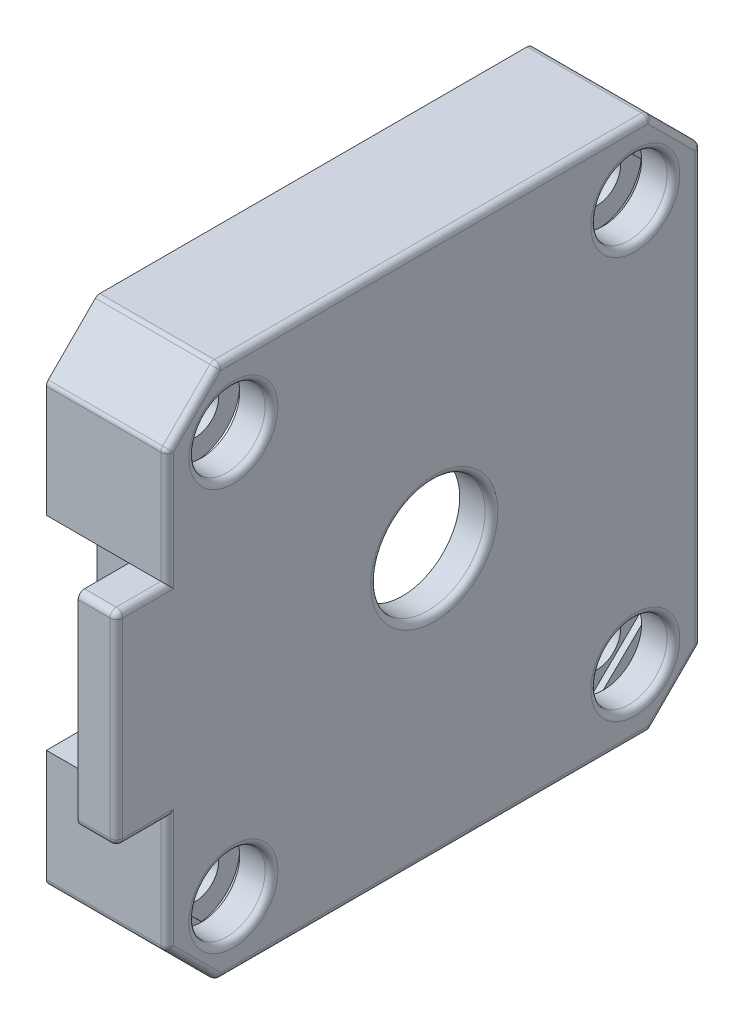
ISO-10303-21;
HEADER;
FILE_DESCRIPTION(('STEP AP214'),'2;1');
FILE_NAME('part.step','',(''),(''),'','','');
FILE_SCHEMA(('AUTOMOTIVE_DESIGN { 1 0 10303 214 1 1 1 1 }'));
ENDSEC;
DATA;
#1=APPLICATION_CONTEXT('core data for automotive mechanical design processes');
#2=APPLICATION_PROTOCOL_DEFINITION('international standard','automotive_design',2000,#1);
#3=PRODUCT_CONTEXT('',#1,'mechanical');
#4=PRODUCT('Part','Part','',(#3));
#5=PRODUCT_RELATED_PRODUCT_CATEGORY('part','',(#4));
#6=PRODUCT_DEFINITION_FORMATION('','',#4);
#7=PRODUCT_DEFINITION_CONTEXT('part definition',#1,'design');
#8=PRODUCT_DEFINITION('design','',#6,#7);
#9=PRODUCT_DEFINITION_SHAPE('','',#8);
#10=(LENGTH_UNIT() NAMED_UNIT(*) SI_UNIT(.MILLI.,.METRE.));
#11=(NAMED_UNIT(*) PLANE_ANGLE_UNIT() SI_UNIT($,.RADIAN.));
#12=(NAMED_UNIT(*) SI_UNIT($,.STERADIAN.) SOLID_ANGLE_UNIT());
#13=UNCERTAINTY_MEASURE_WITH_UNIT(LENGTH_MEASURE(1.E-05),#10,'distance_accuracy_value','');
#14=(GEOMETRIC_REPRESENTATION_CONTEXT(3) GLOBAL_UNCERTAINTY_ASSIGNED_CONTEXT((#13)) GLOBAL_UNIT_ASSIGNED_CONTEXT((#10,
#11,#12)) REPRESENTATION_CONTEXT('',''));
#15=CARTESIAN_POINT('',(0.,0.,0.));
#16=DIRECTION('',(0.,0.,1.));
#17=DIRECTION('',(1.,0.,0.));
#18=AXIS2_PLACEMENT_3D('',#15,#16,#17);
#19=CARTESIAN_POINT('',(3.5,-15.8,15.8));
#20=DIRECTION('',(1.,0.,0.));
#21=DIRECTION('',(0.,0.,-1.));
#22=AXIS2_PLACEMENT_3D('',#19,#20,#21);
#23=CYLINDRICAL_SURFACE('',#22,1.85464749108);
#24=CARTESIAN_POINT('',(6.5,-15.8,15.8));
#25=DIRECTION('',(1.,0.,0.));
#26=DIRECTION('',(0.,0.,-1.));
#27=AXIS2_PLACEMENT_3D('',#24,#25,#26);
#28=CIRCLE('',#27,1.85464749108);
#29=CARTESIAN_POINT('',(6.5,-15.8,13.94535250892));
#30=VERTEX_POINT('',#29);
#31=EDGE_CURVE('E575',#30,#30,#28,.T.);
#32=ORIENTED_EDGE('',*,*,#31,.T.);
#33=EDGE_LOOP('',(#32));
#34=FACE_BOUND('',#33,.T.);
#35=CARTESIAN_POINT('',(0.5,-15.8,15.8));
#36=DIRECTION('',(1.,0.,0.));
#37=DIRECTION('',(0.,0.,-1.));
#38=AXIS2_PLACEMENT_3D('',#35,#36,#37);
#39=CIRCLE('',#38,1.85464749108);
#40=CARTESIAN_POINT('',(0.5,-15.8,13.94535250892));
#41=VERTEX_POINT('',#40);
#42=EDGE_CURVE('E572',#41,#41,#39,.F.);
#43=ORIENTED_EDGE('',*,*,#42,.T.);
#44=EDGE_LOOP('',(#43));
#45=FACE_BOUND('',#44,.T.);
#46=ADVANCED_FACE('F17',(#34,#45),#23,.F.);
#47=CARTESIAN_POINT('',(3.5,15.8,15.8));
#48=DIRECTION('',(1.,0.,0.));
#49=DIRECTION('',(0.,0.,-1.));
#50=AXIS2_PLACEMENT_3D('',#47,#48,#49);
#51=CYLINDRICAL_SURFACE('',#50,1.85464749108);
#52=CARTESIAN_POINT('',(6.5,15.8,15.8));
#53=DIRECTION('',(1.,0.,0.));
#54=DIRECTION('',(0.,0.,-1.));
#55=AXIS2_PLACEMENT_3D('',#52,#53,#54);
#56=CIRCLE('',#55,1.85464749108);
#57=CARTESIAN_POINT('',(6.5,15.8,13.94535250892));
#58=VERTEX_POINT('',#57);
#59=EDGE_CURVE('E415',#58,#58,#56,.T.);
#60=ORIENTED_EDGE('',*,*,#59,.T.);
#61=EDGE_LOOP('',(#60));
#62=FACE_BOUND('',#61,.T.);
#63=CARTESIAN_POINT('',(0.5,15.8,15.8));
#64=DIRECTION('',(1.,0.,0.));
#65=DIRECTION('',(0.,0.,-1.));
#66=AXIS2_PLACEMENT_3D('',#63,#64,#65);
#67=CIRCLE('',#66,1.85464749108);
#68=CARTESIAN_POINT('',(0.5,15.8,13.94535250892));
#69=VERTEX_POINT('',#68);
#70=EDGE_CURVE('E566',#69,#69,#67,.F.);
#71=ORIENTED_EDGE('',*,*,#70,.T.);
#72=EDGE_LOOP('',(#71));
#73=FACE_BOUND('',#72,.T.);
#74=ADVANCED_FACE('F1466',(#62,#73),#51,.F.);
#75=CARTESIAN_POINT('',(3.5,15.8,-15.8));
#76=DIRECTION('',(1.,0.,0.));
#77=DIRECTION('',(0.,0.,-1.));
#78=AXIS2_PLACEMENT_3D('',#75,#76,#77);
#79=CYLINDRICAL_SURFACE('',#78,1.85464749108);
#80=CARTESIAN_POINT('',(6.5,15.8,-15.8));
#81=DIRECTION('',(1.,0.,0.));
#82=DIRECTION('',(0.,0.,-1.));
#83=AXIS2_PLACEMENT_3D('',#80,#81,#82);
#84=CIRCLE('',#83,1.85464749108);
#85=CARTESIAN_POINT('',(6.5,15.8,-17.65464749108));
#86=VERTEX_POINT('',#85);
#87=EDGE_CURVE('E551',#86,#86,#84,.T.);
#88=ORIENTED_EDGE('',*,*,#87,.T.);
#89=EDGE_LOOP('',(#88));
#90=FACE_BOUND('',#89,.T.);
#91=CARTESIAN_POINT('',(0.5,15.8,-15.8));
#92=DIRECTION('',(1.,0.,0.));
#93=DIRECTION('',(0.,0.,-1.));
#94=AXIS2_PLACEMENT_3D('',#91,#92,#93);
#95=CIRCLE('',#94,1.85464749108);
#96=CARTESIAN_POINT('',(0.5,15.8,-17.65464749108));
#97=VERTEX_POINT('',#96);
#98=EDGE_CURVE('E558',#97,#97,#95,.F.);
#99=ORIENTED_EDGE('',*,*,#98,.T.);
#100=EDGE_LOOP('',(#99));
#101=FACE_BOUND('',#100,.T.);
#102=ADVANCED_FACE('F1458',(#90,#101),#79,.F.);
#103=CARTESIAN_POINT('',(3.5,-15.8,-15.8));
#104=DIRECTION('',(1.,0.,0.));
#105=DIRECTION('',(0.,0.,-1.));
#106=AXIS2_PLACEMENT_3D('',#103,#104,#105);
#107=CYLINDRICAL_SURFACE('',#106,1.85464749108);
#108=CARTESIAN_POINT('',(6.5,-15.8,-15.8));
#109=DIRECTION('',(1.,0.,0.));
#110=DIRECTION('',(0.,0.,-1.));
#111=AXIS2_PLACEMENT_3D('',#108,#109,#110);
#112=CIRCLE('',#111,1.85464749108);
#113=CARTESIAN_POINT('',(6.5,-15.8,-17.65464749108));
#114=VERTEX_POINT('',#113);
#115=EDGE_CURVE('E540',#114,#114,#112,.T.);
#116=ORIENTED_EDGE('',*,*,#115,.T.);
#117=EDGE_LOOP('',(#116));
#118=FACE_BOUND('',#117,.T.);
#119=CARTESIAN_POINT('',(0.5,-15.8,-15.8));
#120=DIRECTION('',(1.,0.,0.));
#121=DIRECTION('',(0.,0.,-1.));
#122=AXIS2_PLACEMENT_3D('',#119,#120,#121);
#123=CIRCLE('',#122,1.85464749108);
#124=CARTESIAN_POINT('',(0.5,-15.8,-17.65464749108));
#125=VERTEX_POINT('',#124);
#126=EDGE_CURVE('E548',#125,#125,#123,.F.);
#127=ORIENTED_EDGE('',*,*,#126,.T.);
#128=EDGE_LOOP('',(#127));
#129=FACE_BOUND('',#128,.T.);
#130=ADVANCED_FACE('F1450',(#118,#129),#107,.F.);
#131=CARTESIAN_POINT('',(6.5,0.,0.));
#132=DIRECTION('',(-1.,0.,0.));
#133=DIRECTION('',(0.,0.,1.));
#134=AXIS2_PLACEMENT_3D('',#131,#132,#133);
#135=PLANE('',#134);
#136=ORIENTED_EDGE('',*,*,#31,.F.);
#137=EDGE_LOOP('',(#136));
#138=FACE_BOUND('',#137,.T.);
#139=CARTESIAN_POINT('',(6.5,-15.8,15.8));
#140=DIRECTION('',(1.,0.,0.));
#141=DIRECTION('',(0.,0.,-1.));
#142=AXIS2_PLACEMENT_3D('',#139,#140,#141);
#143=CIRCLE('',#142,3.5);
#144=CARTESIAN_POINT('',(6.5,-15.3861148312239,19.2754422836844));
#145=VERTEX_POINT('',#144);
#146=CARTESIAN_POINT('',(6.5,-19.2639552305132,15.2989868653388));
#147=VERTEX_POINT('',#146);
#148=EDGE_CURVE('E410',#145,#147,#143,.F.);
#149=ORIENTED_EDGE('',*,*,#148,.F.);
#150=DIRECTION('',(0.,0.698173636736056,0.715928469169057));
#151=VECTOR('',#150,1.);
#152=CARTESIAN_POINT('',(6.5,-20.0212039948,14.5224809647));
#153=LINE('',#152,#151);
#154=EDGE_CURVE('E413',#147,#145,#153,.T.);
#155=ORIENTED_EDGE('',*,*,#154,.F.);
#156=EDGE_LOOP('',(#149,#155));
#157=FACE_BOUND('',#156,.T.);
#158=ADVANCED_FACE('F411',(#138,#157),#135,.F.);
#159=CARTESIAN_POINT('',(0.5,0.,0.));
#160=DIRECTION('',(1.,0.,0.));
#161=DIRECTION('',(0.,0.,-1.));
#162=AXIS2_PLACEMENT_3D('',#159,#160,#161);
#163=PLANE('',#162);
#164=ORIENTED_EDGE('',*,*,#42,.F.);
#165=EDGE_LOOP('',(#164));
#166=FACE_BOUND('',#165,.T.);
#167=DIRECTION('',(0.,0.698173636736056,0.715928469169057));
#168=VECTOR('',#167,1.);
#169=CARTESIAN_POINT('',(0.5,-20.0212039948,14.5224809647));
#170=LINE('',#169,#168);
#171=CARTESIAN_POINT('',(0.5,-15.3861148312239,19.2754422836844));
#172=VERTEX_POINT('',#171);
#173=CARTESIAN_POINT('',(0.5,-19.2639552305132,15.2989868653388));
#174=VERTEX_POINT('',#173);
#175=EDGE_CURVE('E422',#172,#174,#170,.F.);
#176=ORIENTED_EDGE('',*,*,#175,.F.);
#177=CARTESIAN_POINT('',(0.5,-15.8,15.8));
#178=DIRECTION('',(1.,0.,0.));
#179=DIRECTION('',(0.,0.,-1.));
#180=AXIS2_PLACEMENT_3D('',#177,#178,#179);
#181=CIRCLE('',#180,3.5);
#182=EDGE_CURVE('E405',#174,#172,#181,.T.);
#183=ORIENTED_EDGE('',*,*,#182,.F.);
#184=EDGE_LOOP('',(#176,#183));
#185=FACE_BOUND('',#184,.T.);
#186=ADVANCED_FACE('F1436',(#166,#185),#163,.F.);
#187=CARTESIAN_POINT('',(3.5,-15.8,15.8));
#188=DIRECTION('',(1.,0.,0.));
#189=DIRECTION('',(0.,0.,-1.));
#190=AXIS2_PLACEMENT_3D('',#187,#188,#189);
#191=CYLINDRICAL_SURFACE('',#190,3.5);
#192=ORIENTED_EDGE('',*,*,#148,.T.);
#193=DIRECTION('',(1.,0.,0.));
#194=VECTOR('',#193,1.);
#195=CARTESIAN_POINT('',(0.,-19.2639552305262,15.2989868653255));
#196=LINE('',#195,#194);
#197=EDGE_CURVE('E426',#174,#147,#196,.T.);
#198=ORIENTED_EDGE('',*,*,#197,.F.);
#199=ORIENTED_EDGE('',*,*,#182,.T.);
#200=DIRECTION('',(1.,0.,0.));
#201=VECTOR('',#200,1.);
#202=CARTESIAN_POINT('',(0.,-15.3861148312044,19.2754422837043));
#203=LINE('',#202,#201);
#204=EDGE_CURVE('E418',#145,#172,#203,.F.);
#205=ORIENTED_EDGE('',*,*,#204,.F.);
#206=EDGE_LOOP('',(#192,#198,#199,#205));
#207=FACE_BOUND('',#206,.T.);
#208=ADVANCED_FACE('F419',(#207),#191,.T.);
#209=CARTESIAN_POINT('',(6.5,0.,0.));
#210=DIRECTION('',(-1.,0.,0.));
#211=DIRECTION('',(0.,0.,1.));
#212=AXIS2_PLACEMENT_3D('',#209,#210,#211);
#213=PLANE('',#212);
#214=ORIENTED_EDGE('',*,*,#59,.F.);
#215=EDGE_LOOP('',(#214));
#216=FACE_BOUND('',#215,.T.);
#217=DIRECTION('',(0.,-0.698173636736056,0.715928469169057));
#218=VECTOR('',#217,1.);
#219=CARTESIAN_POINT('',(6.5,20.0212039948,14.5224809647));
#220=LINE('',#219,#218);
#221=CARTESIAN_POINT('',(6.5,19.2639552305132,15.2989868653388));
#222=VERTEX_POINT('',#221);
#223=CARTESIAN_POINT('',(6.5,15.3861148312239,19.2754422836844));
#224=VERTEX_POINT('',#223);
#225=EDGE_CURVE('E1705',#222,#224,#220,.T.);
#226=ORIENTED_EDGE('',*,*,#225,.T.);
#227=CARTESIAN_POINT('',(6.5,15.8,15.8));
#228=DIRECTION('',(1.,0.,0.));
#229=DIRECTION('',(0.,0.,-1.));
#230=AXIS2_PLACEMENT_3D('',#227,#228,#229);
#231=CIRCLE('',#230,3.5);
#232=EDGE_CURVE('E564',#222,#224,#231,.F.);
#233=ORIENTED_EDGE('',*,*,#232,.F.);
#234=EDGE_LOOP('',(#226,#233));
#235=FACE_BOUND('',#234,.T.);
#236=ADVANCED_FACE('F1421',(#216,#235),#213,.F.);
#237=CARTESIAN_POINT('',(0.5,0.,0.));
#238=DIRECTION('',(1.,0.,0.));
#239=DIRECTION('',(0.,0.,-1.));
#240=AXIS2_PLACEMENT_3D('',#237,#238,#239);
#241=PLANE('',#240);
#242=ORIENTED_EDGE('',*,*,#70,.F.);
#243=EDGE_LOOP('',(#242));
#244=FACE_BOUND('',#243,.T.);
#245=CARTESIAN_POINT('',(0.5,15.8,15.8));
#246=DIRECTION('',(1.,0.,0.));
#247=DIRECTION('',(0.,0.,-1.));
#248=AXIS2_PLACEMENT_3D('',#245,#246,#247);
#249=CIRCLE('',#248,3.5);
#250=CARTESIAN_POINT('',(0.5,15.3861148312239,19.2754422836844));
#251=VERTEX_POINT('',#250);
#252=CARTESIAN_POINT('',(0.5,19.2639552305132,15.2989868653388));
#253=VERTEX_POINT('',#252);
#254=EDGE_CURVE('E561',#251,#253,#249,.T.);
#255=ORIENTED_EDGE('',*,*,#254,.F.);
#256=DIRECTION('',(0.,-0.698173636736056,0.715928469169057));
#257=VECTOR('',#256,1.);
#258=CARTESIAN_POINT('',(0.5,20.0212039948,14.5224809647));
#259=LINE('',#258,#257);
#260=EDGE_CURVE('E1714',#251,#253,#259,.F.);
#261=ORIENTED_EDGE('',*,*,#260,.T.);
#262=EDGE_LOOP('',(#255,#261));
#263=FACE_BOUND('',#262,.T.);
#264=ADVANCED_FACE('F1413',(#244,#263),#241,.F.);
#265=CARTESIAN_POINT('',(3.5,15.8,15.8));
#266=DIRECTION('',(1.,0.,0.));
#267=DIRECTION('',(0.,0.,-1.));
#268=AXIS2_PLACEMENT_3D('',#265,#266,#267);
#269=CYLINDRICAL_SURFACE('',#268,3.5);
#270=ORIENTED_EDGE('',*,*,#254,.T.);
#271=DIRECTION('',(1.,0.,0.));
#272=VECTOR('',#271,1.);
#273=CARTESIAN_POINT('',(0.,19.2639552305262,15.2989868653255));
#274=LINE('',#273,#272);
#275=EDGE_CURVE('E1710',#253,#222,#274,.T.);
#276=ORIENTED_EDGE('',*,*,#275,.T.);
#277=ORIENTED_EDGE('',*,*,#232,.T.);
#278=DIRECTION('',(1.,0.,0.));
#279=VECTOR('',#278,1.);
#280=CARTESIAN_POINT('',(0.,15.3861148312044,19.2754422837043));
#281=LINE('',#280,#279);
#282=EDGE_CURVE('E1708',#224,#251,#281,.F.);
#283=ORIENTED_EDGE('',*,*,#282,.T.);
#284=EDGE_LOOP('',(#270,#276,#277,#283));
#285=FACE_BOUND('',#284,.T.);
#286=ADVANCED_FACE('F1405',(#285),#269,.T.);
#287=CARTESIAN_POINT('',(0.5,0.,0.));
#288=DIRECTION('',(1.,0.,0.));
#289=DIRECTION('',(0.,0.,-1.));
#290=AXIS2_PLACEMENT_3D('',#287,#288,#289);
#291=PLANE('',#290);
#292=ORIENTED_EDGE('',*,*,#98,.F.);
#293=EDGE_LOOP('',(#292));
#294=FACE_BOUND('',#293,.T.);
#295=DIRECTION('',(0.,-0.698173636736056,-0.715928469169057));
#296=VECTOR('',#295,1.);
#297=CARTESIAN_POINT('',(0.5,20.0212039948,-14.5224809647));
#298=LINE('',#297,#296);
#299=CARTESIAN_POINT('',(0.5,15.3861148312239,-19.2754422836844));
#300=VERTEX_POINT('',#299);
#301=CARTESIAN_POINT('',(0.5,19.2639552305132,-15.2989868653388));
#302=VERTEX_POINT('',#301);
#303=EDGE_CURVE('E1725',#300,#302,#298,.F.);
#304=ORIENTED_EDGE('',*,*,#303,.F.);
#305=CARTESIAN_POINT('',(0.5,15.8,-15.8));
#306=DIRECTION('',(1.,0.,0.));
#307=DIRECTION('',(0.,0.,-1.));
#308=AXIS2_PLACEMENT_3D('',#305,#306,#307);
#309=CIRCLE('',#308,3.5);
#310=EDGE_CURVE('E556',#302,#300,#309,.T.);
#311=ORIENTED_EDGE('',*,*,#310,.F.);
#312=EDGE_LOOP('',(#304,#311));
#313=FACE_BOUND('',#312,.T.);
#314=ADVANCED_FACE('F1397',(#294,#313),#291,.F.);
#315=CARTESIAN_POINT('',(3.5,15.8,-15.8));
#316=DIRECTION('',(1.,0.,0.));
#317=DIRECTION('',(0.,0.,-1.));
#318=AXIS2_PLACEMENT_3D('',#315,#316,#317);
#319=CYLINDRICAL_SURFACE('',#318,3.5);
#320=CARTESIAN_POINT('',(6.5,15.8,-15.8));
#321=DIRECTION('',(1.,0.,0.));
#322=DIRECTION('',(0.,0.,-1.));
#323=AXIS2_PLACEMENT_3D('',#320,#321,#322);
#324=CIRCLE('',#323,3.5);
#325=CARTESIAN_POINT('',(6.5,15.3861148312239,-19.2754422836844));
#326=VERTEX_POINT('',#325);
#327=CARTESIAN_POINT('',(6.5,19.2639552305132,-15.2989868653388));
#328=VERTEX_POINT('',#327);
#329=EDGE_CURVE('E554',#326,#328,#324,.F.);
#330=ORIENTED_EDGE('',*,*,#329,.T.);
#331=DIRECTION('',(1.,0.,0.));
#332=VECTOR('',#331,1.);
#333=CARTESIAN_POINT('',(0.,19.2639552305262,-15.2989868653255));
#334=LINE('',#333,#332);
#335=EDGE_CURVE('E1728',#302,#328,#334,.T.);
#336=ORIENTED_EDGE('',*,*,#335,.F.);
#337=ORIENTED_EDGE('',*,*,#310,.T.);
#338=DIRECTION('',(1.,0.,0.));
#339=VECTOR('',#338,1.);
#340=CARTESIAN_POINT('',(0.,15.3861148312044,-19.2754422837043));
#341=LINE('',#340,#339);
#342=EDGE_CURVE('E1729',#326,#300,#341,.F.);
#343=ORIENTED_EDGE('',*,*,#342,.F.);
#344=EDGE_LOOP('',(#330,#336,#337,#343));
#345=FACE_BOUND('',#344,.T.);
#346=ADVANCED_FACE('F1389',(#345),#319,.T.);
#347=CARTESIAN_POINT('',(6.5,0.,0.));
#348=DIRECTION('',(-1.,0.,0.));
#349=DIRECTION('',(0.,0.,1.));
#350=AXIS2_PLACEMENT_3D('',#347,#348,#349);
#351=PLANE('',#350);
#352=ORIENTED_EDGE('',*,*,#87,.F.);
#353=EDGE_LOOP('',(#352));
#354=FACE_BOUND('',#353,.T.);
#355=ORIENTED_EDGE('',*,*,#329,.F.);
#356=DIRECTION('',(0.,-0.698173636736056,-0.715928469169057));
#357=VECTOR('',#356,1.);
#358=CARTESIAN_POINT('',(6.5,20.0212039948,-14.5224809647));
#359=LINE('',#358,#357);
#360=EDGE_CURVE('E1733',#328,#326,#359,.T.);
#361=ORIENTED_EDGE('',*,*,#360,.F.);
#362=EDGE_LOOP('',(#355,#361));
#363=FACE_BOUND('',#362,.T.);
#364=ADVANCED_FACE('F1381',(#354,#363),#351,.F.);
#365=CARTESIAN_POINT('',(0.5,0.,0.));
#366=DIRECTION('',(1.,0.,0.));
#367=DIRECTION('',(0.,0.,-1.));
#368=AXIS2_PLACEMENT_3D('',#365,#366,#367);
#369=PLANE('',#368);
#370=ORIENTED_EDGE('',*,*,#126,.F.);
#371=EDGE_LOOP('',(#370));
#372=FACE_BOUND('',#371,.T.);
#373=CARTESIAN_POINT('',(0.5,-15.8,-15.8));
#374=DIRECTION('',(1.,0.,0.));
#375=DIRECTION('',(0.,0.,-1.));
#376=AXIS2_PLACEMENT_3D('',#373,#374,#375);
#377=CIRCLE('',#376,3.5);
#378=CARTESIAN_POINT('',(0.5,-15.3861148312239,-19.2754422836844));
#379=VERTEX_POINT('',#378);
#380=CARTESIAN_POINT('',(0.5,-19.2639552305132,-15.2989868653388));
#381=VERTEX_POINT('',#380);
#382=EDGE_CURVE('E545',#379,#381,#377,.T.);
#383=ORIENTED_EDGE('',*,*,#382,.F.);
#384=DIRECTION('',(0.,0.698173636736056,-0.715928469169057));
#385=VECTOR('',#384,1.);
#386=CARTESIAN_POINT('',(0.5,-20.0212039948,-14.5224809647));
#387=LINE('',#386,#385);
#388=EDGE_CURVE('E1754',#379,#381,#387,.F.);
#389=ORIENTED_EDGE('',*,*,#388,.T.);
#390=EDGE_LOOP('',(#383,#389));
#391=FACE_BOUND('',#390,.T.);
#392=ADVANCED_FACE('F1373',(#372,#391),#369,.F.);
#393=CARTESIAN_POINT('',(3.5,-15.8,-15.8));
#394=DIRECTION('',(1.,0.,0.));
#395=DIRECTION('',(0.,0.,-1.));
#396=AXIS2_PLACEMENT_3D('',#393,#394,#395);
#397=CYLINDRICAL_SURFACE('',#396,3.5);
#398=ORIENTED_EDGE('',*,*,#382,.T.);
#399=DIRECTION('',(1.,0.,0.));
#400=VECTOR('',#399,1.);
#401=CARTESIAN_POINT('',(0.,-19.2639552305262,-15.2989868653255));
#402=LINE('',#401,#400);
#403=CARTESIAN_POINT('',(6.5,-19.2639552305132,-15.2989868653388));
#404=VERTEX_POINT('',#403);
#405=EDGE_CURVE('E1756',#381,#404,#402,.T.);
#406=ORIENTED_EDGE('',*,*,#405,.T.);
#407=CARTESIAN_POINT('',(6.5,-15.8,-15.8));
#408=DIRECTION('',(1.,0.,0.));
#409=DIRECTION('',(0.,0.,-1.));
#410=AXIS2_PLACEMENT_3D('',#407,#408,#409);
#411=CIRCLE('',#410,3.5);
#412=CARTESIAN_POINT('',(6.5,-15.3861148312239,-19.2754422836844));
#413=VERTEX_POINT('',#412);
#414=EDGE_CURVE('E543',#404,#413,#411,.F.);
#415=ORIENTED_EDGE('',*,*,#414,.T.);
#416=DIRECTION('',(1.,0.,0.));
#417=VECTOR('',#416,1.);
#418=CARTESIAN_POINT('',(0.,-15.3861148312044,-19.2754422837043));
#419=LINE('',#418,#417);
#420=EDGE_CURVE('E1757',#413,#379,#419,.F.);
#421=ORIENTED_EDGE('',*,*,#420,.T.);
#422=EDGE_LOOP('',(#398,#406,#415,#421));
#423=FACE_BOUND('',#422,.T.);
#424=ADVANCED_FACE('F1365',(#423),#397,.T.);
#425=CARTESIAN_POINT('',(6.5,0.,0.));
#426=DIRECTION('',(-1.,0.,0.));
#427=DIRECTION('',(0.,0.,1.));
#428=AXIS2_PLACEMENT_3D('',#425,#426,#427);
#429=PLANE('',#428);
#430=ORIENTED_EDGE('',*,*,#115,.F.);
#431=EDGE_LOOP('',(#430));
#432=FACE_BOUND('',#431,.T.);
#433=ORIENTED_EDGE('',*,*,#414,.F.);
#434=DIRECTION('',(0.,0.698173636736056,-0.715928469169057));
#435=VECTOR('',#434,1.);
#436=CARTESIAN_POINT('',(6.5,-20.0212039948,-14.5224809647));
#437=LINE('',#436,#435);
#438=EDGE_CURVE('E1761',#404,#413,#437,.T.);
#439=ORIENTED_EDGE('',*,*,#438,.T.);
#440=EDGE_LOOP('',(#433,#439));
#441=FACE_BOUND('',#440,.T.);
#442=ADVANCED_FACE('F1357',(#432,#441),#429,.F.);
#443=CARTESIAN_POINT('',(0.,-8.,17.));
#444=DIRECTION('',(0.,0.,-1.));
#445=DIRECTION('',(-1.,0.,0.));
#446=AXIS2_PLACEMENT_3D('',#443,#444,#445);
#447=PLANE('',#446);
#448=DIRECTION('',(0.,1.,0.));
#449=VECTOR('',#448,1.);
#450=CARTESIAN_POINT('',(0.,0.,17.));
#451=LINE('',#450,#449);
#452=CARTESIAN_POINT('',(0.,8.,17.));
#453=VERTEX_POINT('',#452);
#454=CARTESIAN_POINT('',(0.,-8.,17.));
#455=VERTEX_POINT('',#454);
#456=EDGE_CURVE('E1774',#453,#455,#451,.F.);
#457=ORIENTED_EDGE('',*,*,#456,.T.);
#458=DIRECTION('',(1.,0.,0.));
#459=VECTOR('',#458,1.);
#460=CARTESIAN_POINT('',(0.,-8.,17.));
#461=LINE('',#460,#459);
#462=CARTESIAN_POINT('',(6.5,-8.,17.));
#463=VERTEX_POINT('',#462);
#464=EDGE_CURVE('E1779',#463,#455,#461,.F.);
#465=ORIENTED_EDGE('',*,*,#464,.F.);
#466=DIRECTION('',(0.,1.,0.));
#467=VECTOR('',#466,1.);
#468=CARTESIAN_POINT('',(6.5,0.,17.));
#469=LINE('',#468,#467);
#470=CARTESIAN_POINT('',(6.5,8.,17.));
#471=VERTEX_POINT('',#470);
#472=EDGE_CURVE('E535',#471,#463,#469,.F.);
#473=ORIENTED_EDGE('',*,*,#472,.F.);
#474=DIRECTION('',(1.,0.,0.));
#475=VECTOR('',#474,1.);
#476=CARTESIAN_POINT('',(0.,8.,17.));
#477=LINE('',#476,#475);
#478=EDGE_CURVE('E539',#453,#471,#477,.T.);
#479=ORIENTED_EDGE('',*,*,#478,.F.);
#480=EDGE_LOOP('',(#457,#465,#473,#479));
#481=FACE_BOUND('',#480,.T.);
#482=ADVANCED_FACE('F1349',(#481),#447,.F.);
#483=CARTESIAN_POINT('',(0.,-20.0212039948,16.5945694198));
#484=DIRECTION('',(0.,-1.,0.));
#485=DIRECTION('',(0.,0.,-1.));
#486=AXIS2_PLACEMENT_3D('',#483,#484,#485);
#487=PLANE('',#486);
#488=DIRECTION('',(1.,0.,0.));
#489=VECTOR('',#488,1.);
#490=CARTESIAN_POINT('',(0.,-20.0212039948,-14.5224809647));
#491=LINE('',#490,#489);
#492=CARTESIAN_POINT('',(7.,-20.0212039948,-14.5224809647));
#493=VERTEX_POINT('',#492);
#494=CARTESIAN_POINT('',(0.,-20.0212039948,-14.5224809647));
#495=VERTEX_POINT('',#494);
#496=EDGE_CURVE('E1860',#493,#495,#491,.F.);
#497=ORIENTED_EDGE('',*,*,#496,.T.);
#498=DIRECTION('',(0.,0.,-1.));
#499=VECTOR('',#498,1.);
#500=CARTESIAN_POINT('',(0.,-20.0212039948,0.));
#501=LINE('',#500,#499);
#502=CARTESIAN_POINT('',(0.,-20.0212039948,14.5224809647));
#503=VERTEX_POINT('',#502);
#504=EDGE_CURVE('E1684',#495,#503,#501,.F.);
#505=ORIENTED_EDGE('',*,*,#504,.T.);
#506=DIRECTION('',(1.,0.,0.));
#507=VECTOR('',#506,1.);
#508=CARTESIAN_POINT('',(0.,-20.0212039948,14.5224809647));
#509=LINE('',#508,#507);
#510=CARTESIAN_POINT('',(7.,-20.0212039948,14.5224809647));
#511=VERTEX_POINT('',#510);
#512=EDGE_CURVE('E427',#511,#503,#509,.F.);
#513=ORIENTED_EDGE('',*,*,#512,.F.);
#514=DIRECTION('',(0.,0.,1.));
#515=VECTOR('',#514,1.);
#516=CARTESIAN_POINT('',(7.,-20.0212039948,0.));
#517=LINE('',#516,#515);
#518=EDGE_CURVE('E1872',#493,#511,#517,.T.);
#519=ORIENTED_EDGE('',*,*,#518,.F.);
#520=EDGE_LOOP('',(#497,#505,#513,#519));
#521=FACE_BOUND('',#520,.T.);
#522=ADVANCED_FACE('F1342',(#521),#487,.F.);
#523=CARTESIAN_POINT('',(0.,-20.0212039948,14.5224809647));
#524=DIRECTION('',(0.,0.715928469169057,-0.698173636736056));
#525=DIRECTION('',(0.,0.698173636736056,0.715928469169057));
#526=AXIS2_PLACEMENT_3D('',#523,#524,#525);
#527=PLANE('',#526);
#528=ORIENTED_EDGE('',*,*,#175,.T.);
#529=ORIENTED_EDGE('',*,*,#197,.T.);
#530=ORIENTED_EDGE('',*,*,#154,.T.);
#531=ORIENTED_EDGE('',*,*,#204,.T.);
#532=EDGE_LOOP('',(#528,#529,#530,#531));
#533=FACE_BOUND('',#532,.T.);
#534=DIRECTION('',(0.,0.698173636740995,0.715928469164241));
#535=VECTOR('',#534,1.);
#536=CARTESIAN_POINT('',(0.,-20.0212039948,14.5224809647));
#537=LINE('',#536,#535);
#538=CARTESIAN_POINT('',(0.,-14.6588478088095,20.0212039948));
#539=VERTEX_POINT('',#538);
#540=EDGE_CURVE('E1681',#503,#539,#537,.T.);
#541=ORIENTED_EDGE('',*,*,#540,.T.);
#542=DIRECTION('',(1.,0.,0.));
#543=VECTOR('',#542,1.);
#544=CARTESIAN_POINT('',(0.,-14.6588478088,20.0212039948));
#545=LINE('',#544,#543);
#546=CARTESIAN_POINT('',(7.,-14.6588478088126,20.0212039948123));
#547=VERTEX_POINT('',#546);
#548=EDGE_CURVE('E1677',#539,#547,#545,.T.);
#549=ORIENTED_EDGE('',*,*,#548,.T.);
#550=DIRECTION('',(0.,0.698173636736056,0.715928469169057));
#551=VECTOR('',#550,1.);
#552=CARTESIAN_POINT('',(7.,-20.0212039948,14.5224809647));
#553=LINE('',#552,#551);
#554=CARTESIAN_POINT('',(7.,-15.8501754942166,18.799580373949));
#555=VERTEX_POINT('',#554);
#556=EDGE_CURVE('E430',#547,#555,#553,.F.);
#557=ORIENTED_EDGE('',*,*,#556,.T.);
#558=DIRECTION('',(0.,-0.69817363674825,-0.715928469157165));
#559=VECTOR('',#558,1.);
#560=CARTESIAN_POINT('',(7.,-15.8501754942,18.7995803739));
#561=LINE('',#560,#559);
#562=CARTESIAN_POINT('',(7.,-18.7998945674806,15.7748487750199));
#563=VERTEX_POINT('',#562);
#564=EDGE_CURVE('E511',#555,#563,#561,.T.);
#565=ORIENTED_EDGE('',*,*,#564,.T.);
#566=DIRECTION('',(0.,0.698173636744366,0.715928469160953));
#567=VECTOR('',#566,1.);
#568=CARTESIAN_POINT('',(7.,-20.0212039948,14.5224809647));
#569=LINE('',#568,#567);
#570=EDGE_CURVE('E1803',#511,#563,#569,.T.);
#571=ORIENTED_EDGE('',*,*,#570,.F.);
#572=ORIENTED_EDGE('',*,*,#512,.T.);
#573=EDGE_LOOP('',(#541,#549,#557,#565,#571,#572));
#574=FACE_BOUND('',#573,.T.);
#575=ADVANCED_FACE('F424',(#533,#574),#527,.T.);
#576=CARTESIAN_POINT('',(0.,-8.97879600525,20.0212039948));
#577=DIRECTION('',(0.,0.,1.));
#578=DIRECTION('',(1.,0.,0.));
#579=AXIS2_PLACEMENT_3D('',#576,#577,#578);
#580=PLANE('',#579);
#581=DIRECTION('',(0.,1.,0.));
#582=VECTOR('',#581,1.);
#583=CARTESIAN_POINT('',(0.,0.,20.0212039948));
#584=LINE('',#583,#582);
#585=CARTESIAN_POINT('',(0.,-8.97879600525,20.0212039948));
#586=VERTEX_POINT('',#585);
#587=EDGE_CURVE('E1683',#539,#586,#584,.T.);
#588=ORIENTED_EDGE('',*,*,#587,.T.);
#589=DIRECTION('',(1.,0.,0.));
#590=VECTOR('',#589,1.);
#591=CARTESIAN_POINT('',(0.,-8.97879600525,20.0212039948));
#592=LINE('',#591,#590);
#593=CARTESIAN_POINT('',(7.,-8.97879600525,20.0212039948));
#594=VERTEX_POINT('',#593);
#595=EDGE_CURVE('E1796',#586,#594,#592,.T.);
#596=ORIENTED_EDGE('',*,*,#595,.T.);
#597=DIRECTION('',(0.,1.,0.));
#598=VECTOR('',#597,1.);
#599=CARTESIAN_POINT('',(7.,0.,20.0212039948));
#600=LINE('',#599,#598);
#601=EDGE_CURVE('E1799',#547,#594,#600,.T.);
#602=ORIENTED_EDGE('',*,*,#601,.F.);
#603=ORIENTED_EDGE('',*,*,#548,.F.);
#604=EDGE_LOOP('',(#588,#596,#602,#603));
#605=FACE_BOUND('',#604,.T.);
#606=ADVANCED_FACE('F1327',(#605),#580,.F.);
#607=CARTESIAN_POINT('',(0.,-8.97879600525,14.6735944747));
#608=DIRECTION('',(0.,1.,0.));
#609=DIRECTION('',(0.,0.,1.));
#610=AXIS2_PLACEMENT_3D('',#607,#608,#609);
#611=PLANE('',#610);
#612=DIRECTION('',(0.,0.,-1.));
#613=VECTOR('',#612,1.);
#614=CARTESIAN_POINT('',(0.,-8.97879600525,0.));
#615=LINE('',#614,#613);
#616=CARTESIAN_POINT('',(0.,-8.97879600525,14.6735944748));
#617=VERTEX_POINT('',#616);
#618=EDGE_CURVE('E1688',#586,#617,#615,.T.);
#619=ORIENTED_EDGE('',*,*,#618,.T.);
#620=DIRECTION('',(1.,0.,0.));
#621=VECTOR('',#620,1.);
#622=CARTESIAN_POINT('',(0.,-8.97879600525,14.6735944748));
#623=LINE('',#622,#621);
#624=CARTESIAN_POINT('',(7.,-8.97879600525,14.6735944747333));
#625=VERTEX_POINT('',#624);
#626=EDGE_CURVE('E1807',#617,#625,#623,.T.);
#627=ORIENTED_EDGE('',*,*,#626,.T.);
#628=DIRECTION('',(0.,0.,1.));
#629=VECTOR('',#628,1.);
#630=CARTESIAN_POINT('',(7.,-8.97879600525,0.));
#631=LINE('',#630,#629);
#632=EDGE_CURVE('E1802',#594,#625,#631,.F.);
#633=ORIENTED_EDGE('',*,*,#632,.F.);
#634=ORIENTED_EDGE('',*,*,#595,.F.);
#635=EDGE_LOOP('',(#619,#627,#633,#634));
#636=FACE_BOUND('',#635,.T.);
#637=ADVANCED_FACE('F1319',(#636),#611,.F.);
#638=CARTESIAN_POINT('',(0.,8.97879600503,14.6735944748));
#639=DIRECTION('',(0.,0.,1.));
#640=DIRECTION('',(1.,0.,0.));
#641=AXIS2_PLACEMENT_3D('',#638,#639,#640);
#642=PLANE('',#641);
#643=DIRECTION('',(0.,1.,0.));
#644=VECTOR('',#643,1.);
#645=CARTESIAN_POINT('',(0.,0.,14.6735944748));
#646=LINE('',#645,#644);
#647=CARTESIAN_POINT('',(0.,8.97879600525,14.6735944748));
#648=VERTEX_POINT('',#647);
#649=EDGE_CURVE('E1692',#617,#648,#646,.T.);
#650=ORIENTED_EDGE('',*,*,#649,.T.);
#651=DIRECTION('',(1.,0.,0.));
#652=VECTOR('',#651,1.);
#653=CARTESIAN_POINT('',(0.,8.97879600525,14.6735944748));
#654=LINE('',#653,#652);
#655=CARTESIAN_POINT('',(7.,8.97879600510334,14.6735944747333));
#656=VERTEX_POINT('',#655);
#657=EDGE_CURVE('E1816',#648,#656,#654,.T.);
#658=ORIENTED_EDGE('',*,*,#657,.T.);
#659=DIRECTION('',(0.,1.,0.));
#660=VECTOR('',#659,1.);
#661=CARTESIAN_POINT('',(7.,0.,14.6735944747));
#662=LINE('',#661,#660);
#663=EDGE_CURVE('E1812',#625,#656,#662,.T.);
#664=ORIENTED_EDGE('',*,*,#663,.F.);
#665=ORIENTED_EDGE('',*,*,#626,.F.);
#666=EDGE_LOOP('',(#650,#658,#664,#665));
#667=FACE_BOUND('',#666,.T.);
#668=ADVANCED_FACE('F1311',(#667),#642,.F.);
#669=CARTESIAN_POINT('',(0.,8.97879600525,20.0212039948));
#670=DIRECTION('',(0.,-1.,0.));
#671=DIRECTION('',(0.,0.,-1.));
#672=AXIS2_PLACEMENT_3D('',#669,#670,#671);
#673=PLANE('',#672);
#674=DIRECTION('',(0.,0.,-1.));
#675=VECTOR('',#674,1.);
#676=CARTESIAN_POINT('',(0.,8.97879600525,0.));
#677=LINE('',#676,#675);
#678=CARTESIAN_POINT('',(0.,8.97879600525,20.0212039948));
#679=VERTEX_POINT('',#678);
#680=EDGE_CURVE('E1696',#648,#679,#677,.F.);
#681=ORIENTED_EDGE('',*,*,#680,.T.);
#682=DIRECTION('',(1.,0.,0.));
#683=VECTOR('',#682,1.);
#684=CARTESIAN_POINT('',(0.,8.97879600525,20.0212039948));
#685=LINE('',#684,#683);
#686=CARTESIAN_POINT('',(7.,8.97879600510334,20.0212039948));
#687=VERTEX_POINT('',#686);
#688=EDGE_CURVE('E1825',#679,#687,#685,.T.);
#689=ORIENTED_EDGE('',*,*,#688,.T.);
#690=DIRECTION('',(0.,0.,1.));
#691=VECTOR('',#690,1.);
#692=CARTESIAN_POINT('',(7.,8.97879600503,0.));
#693=LINE('',#692,#691);
#694=EDGE_CURVE('E1821',#656,#687,#693,.T.);
#695=ORIENTED_EDGE('',*,*,#694,.F.);
#696=ORIENTED_EDGE('',*,*,#657,.F.);
#697=EDGE_LOOP('',(#681,#689,#695,#696));
#698=FACE_BOUND('',#697,.T.);
#699=ADVANCED_FACE('F1303',(#698),#673,.F.);
#700=CARTESIAN_POINT('',(0.,-8.97879600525,20.0212039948));
#701=DIRECTION('',(0.,0.,1.));
#702=DIRECTION('',(1.,0.,0.));
#703=AXIS2_PLACEMENT_3D('',#700,#701,#702);
#704=PLANE('',#703);
#705=DIRECTION('',(0.,1.,0.));
#706=VECTOR('',#705,1.);
#707=CARTESIAN_POINT('',(7.,0.,20.0212039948));
#708=LINE('',#707,#706);
#709=CARTESIAN_POINT('',(7.,14.6588478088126,20.0212039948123));
#710=VERTEX_POINT('',#709);
#711=EDGE_CURVE('E1830',#687,#710,#708,.T.);
#712=ORIENTED_EDGE('',*,*,#711,.F.);
#713=ORIENTED_EDGE('',*,*,#688,.F.);
#714=DIRECTION('',(0.,1.,0.));
#715=VECTOR('',#714,1.);
#716=CARTESIAN_POINT('',(0.,0.,20.0212039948));
#717=LINE('',#716,#715);
#718=CARTESIAN_POINT('',(0.,14.658847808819,20.0212039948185));
#719=VERTEX_POINT('',#718);
#720=EDGE_CURVE('E1700',#679,#719,#717,.T.);
#721=ORIENTED_EDGE('',*,*,#720,.T.);
#722=DIRECTION('',(1.,0.,0.));
#723=VECTOR('',#722,1.);
#724=CARTESIAN_POINT('',(0.,14.6588478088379,20.021203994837));
#725=LINE('',#724,#723);
#726=EDGE_CURVE('E1709',#719,#710,#725,.T.);
#727=ORIENTED_EDGE('',*,*,#726,.T.);
#728=EDGE_LOOP('',(#712,#713,#721,#727));
#729=FACE_BOUND('',#728,.T.);
#730=ADVANCED_FACE('F1295',(#729),#704,.F.);
#731=CARTESIAN_POINT('',(0.,20.0212039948,14.5224809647));
#732=DIRECTION('',(0.,0.715928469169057,0.698173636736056));
#733=DIRECTION('',(0.,-0.698173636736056,0.715928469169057));
#734=AXIS2_PLACEMENT_3D('',#731,#732,#733);
#735=PLANE('',#734);
#736=ORIENTED_EDGE('',*,*,#260,.F.);
#737=ORIENTED_EDGE('',*,*,#282,.F.);
#738=ORIENTED_EDGE('',*,*,#225,.F.);
#739=ORIENTED_EDGE('',*,*,#275,.F.);
#740=EDGE_LOOP('',(#736,#737,#738,#739));
#741=FACE_BOUND('',#740,.T.);
#742=DIRECTION('',(0.,-0.69817363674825,0.715928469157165));
#743=VECTOR('',#742,1.);
#744=CARTESIAN_POINT('',(7.,18.7998945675,15.774848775));
#745=LINE('',#744,#743);
#746=CARTESIAN_POINT('',(7.,18.7998945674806,15.7748487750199));
#747=VERTEX_POINT('',#746);
#748=CARTESIAN_POINT('',(7.,15.8501754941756,18.7995803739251));
#749=VERTEX_POINT('',#748);
#750=EDGE_CURVE('E1975',#747,#749,#745,.T.);
#751=ORIENTED_EDGE('',*,*,#750,.T.);
#752=DIRECTION('',(0.,0.698173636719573,-0.715928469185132));
#753=VECTOR('',#752,1.);
#754=CARTESIAN_POINT('',(7.,14.6588478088,20.0212039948));
#755=LINE('',#754,#753);
#756=EDGE_CURVE('E1838',#710,#749,#755,.T.);
#757=ORIENTED_EDGE('',*,*,#756,.F.);
#758=ORIENTED_EDGE('',*,*,#726,.F.);
#759=DIRECTION('',(0.,0.698173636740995,-0.715928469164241));
#760=VECTOR('',#759,1.);
#761=CARTESIAN_POINT('',(0.,14.6588478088,20.0212039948));
#762=LINE('',#761,#760);
#763=CARTESIAN_POINT('',(0.,20.0212039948,14.5224809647));
#764=VERTEX_POINT('',#763);
#765=EDGE_CURVE('E1704',#719,#764,#762,.T.);
#766=ORIENTED_EDGE('',*,*,#765,.T.);
#767=DIRECTION('',(1.,0.,0.));
#768=VECTOR('',#767,1.);
#769=CARTESIAN_POINT('',(0.,20.0212039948,14.5224809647));
#770=LINE('',#769,#768);
#771=CARTESIAN_POINT('',(7.,20.0212039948,14.5224809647));
#772=VERTEX_POINT('',#771);
#773=EDGE_CURVE('E1713',#764,#772,#770,.T.);
#774=ORIENTED_EDGE('',*,*,#773,.T.);
#775=DIRECTION('',(0.,0.698173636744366,-0.715928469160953));
#776=VECTOR('',#775,1.);
#777=CARTESIAN_POINT('',(7.,18.7998945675,15.774848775));
#778=LINE('',#777,#776);
#779=EDGE_CURVE('E1851',#747,#772,#778,.T.);
#780=ORIENTED_EDGE('',*,*,#779,.F.);
#781=EDGE_LOOP('',(#751,#757,#758,#766,#774,#780));
#782=FACE_BOUND('',#781,.T.);
#783=ADVANCED_FACE('F1287',(#741,#782),#735,.F.);
#784=CARTESIAN_POINT('',(0.,20.0212039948,-16.5945694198));
#785=DIRECTION('',(0.,1.,0.));
#786=DIRECTION('',(0.,0.,1.));
#787=AXIS2_PLACEMENT_3D('',#784,#785,#786);
#788=PLANE('',#787);
#789=ORIENTED_EDGE('',*,*,#773,.F.);
#790=DIRECTION('',(0.,0.,-1.));
#791=VECTOR('',#790,1.);
#792=CARTESIAN_POINT('',(0.,20.0212039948,0.));
#793=LINE('',#792,#791);
#794=CARTESIAN_POINT('',(0.,20.0212039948,-14.5224809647));
#795=VERTEX_POINT('',#794);
#796=EDGE_CURVE('E1721',#764,#795,#793,.T.);
#797=ORIENTED_EDGE('',*,*,#796,.T.);
#798=DIRECTION('',(1.,0.,0.));
#799=VECTOR('',#798,1.);
#800=CARTESIAN_POINT('',(0.,20.0212039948,-14.5224809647));
#801=LINE('',#800,#799);
#802=CARTESIAN_POINT('',(7.,20.0212039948,-14.5224809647));
#803=VERTEX_POINT('',#802);
#804=EDGE_CURVE('E1732',#803,#795,#801,.F.);
#805=ORIENTED_EDGE('',*,*,#804,.F.);
#806=DIRECTION('',(0.,0.,1.));
#807=VECTOR('',#806,1.);
#808=CARTESIAN_POINT('',(7.,20.0212039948,0.));
#809=LINE('',#808,#807);
#810=EDGE_CURVE('E1847',#772,#803,#809,.F.);
#811=ORIENTED_EDGE('',*,*,#810,.F.);
#812=EDGE_LOOP('',(#789,#797,#805,#811));
#813=FACE_BOUND('',#812,.T.);
#814=ADVANCED_FACE('F1279',(#813),#788,.F.);
#815=CARTESIAN_POINT('',(0.,20.0212039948,-14.5224809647));
#816=DIRECTION('',(0.,-0.715928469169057,0.698173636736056));
#817=DIRECTION('',(0.,-0.698173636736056,-0.715928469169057));
#818=AXIS2_PLACEMENT_3D('',#815,#816,#817);
#819=PLANE('',#818);
#820=ORIENTED_EDGE('',*,*,#335,.T.);
#821=ORIENTED_EDGE('',*,*,#360,.T.);
#822=ORIENTED_EDGE('',*,*,#342,.T.);
#823=ORIENTED_EDGE('',*,*,#303,.T.);
#824=EDGE_LOOP('',(#820,#821,#822,#823));
#825=FACE_BOUND('',#824,.T.);
#826=DIRECTION('',(0.,-0.698173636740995,-0.715928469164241));
#827=VECTOR('',#826,1.);
#828=CARTESIAN_POINT('',(0.,20.0212039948,-14.5224809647));
#829=LINE('',#828,#827);
#830=CARTESIAN_POINT('',(0.,14.6588478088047,-20.0212039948));
#831=VERTEX_POINT('',#830);
#832=EDGE_CURVE('E516',#795,#831,#829,.T.);
#833=ORIENTED_EDGE('',*,*,#832,.T.);
#834=DIRECTION('',(-1.,0.,0.));
#835=VECTOR('',#834,1.);
#836=CARTESIAN_POINT('',(0.,14.6588478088,-20.0212039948));
#837=LINE('',#836,#835);
#838=CARTESIAN_POINT('',(7.,14.6588478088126,-20.0212039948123));
#839=VERTEX_POINT('',#838);
#840=EDGE_CURVE('E1736',#831,#839,#837,.F.);
#841=ORIENTED_EDGE('',*,*,#840,.T.);
#842=DIRECTION('',(0.,-0.698173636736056,-0.715928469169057));
#843=VECTOR('',#842,1.);
#844=CARTESIAN_POINT('',(7.,20.0212039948,-14.5224809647));
#845=LINE('',#844,#843);
#846=CARTESIAN_POINT('',(7.,15.8501754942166,-18.799580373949));
#847=VERTEX_POINT('',#846);
#848=EDGE_CURVE('E1787',#839,#847,#845,.F.);
#849=ORIENTED_EDGE('',*,*,#848,.T.);
#850=DIRECTION('',(0.,0.69817363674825,0.715928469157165));
#851=VECTOR('',#850,1.);
#852=CARTESIAN_POINT('',(7.,15.8501754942,-18.7995803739));
#853=LINE('',#852,#851);
#854=CARTESIAN_POINT('',(7.,18.7998945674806,-15.7748487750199));
#855=VERTEX_POINT('',#854);
#856=EDGE_CURVE('E1972',#847,#855,#853,.T.);
#857=ORIENTED_EDGE('',*,*,#856,.T.);
#858=DIRECTION('',(0.,-0.698173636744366,-0.715928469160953));
#859=VECTOR('',#858,1.);
#860=CARTESIAN_POINT('',(7.,20.0212039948,-14.5224809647));
#861=LINE('',#860,#859);
#862=EDGE_CURVE('E1850',#803,#855,#861,.T.);
#863=ORIENTED_EDGE('',*,*,#862,.F.);
#864=ORIENTED_EDGE('',*,*,#804,.T.);
#865=EDGE_LOOP('',(#833,#841,#849,#857,#863,#864));
#866=FACE_BOUND('',#865,.T.);
#867=ADVANCED_FACE('F1271',(#825,#866),#819,.T.);
#868=CARTESIAN_POINT('',(0.,-16.5945694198,-20.0212039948));
#869=DIRECTION('',(0.,0.,-1.));
#870=DIRECTION('',(-1.,0.,0.));
#871=AXIS2_PLACEMENT_3D('',#868,#869,#870);
#872=PLANE('',#871);
#873=ORIENTED_EDGE('',*,*,#840,.F.);
#874=DIRECTION('',(0.,1.,0.));
#875=VECTOR('',#874,1.);
#876=CARTESIAN_POINT('',(0.,0.,-20.0212039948));
#877=LINE('',#876,#875);
#878=CARTESIAN_POINT('',(0.,-14.6588478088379,-20.021203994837));
#879=VERTEX_POINT('',#878);
#880=EDGE_CURVE('E519',#831,#879,#877,.F.);
#881=ORIENTED_EDGE('',*,*,#880,.T.);
#882=DIRECTION('',(1.,0.,0.));
#883=VECTOR('',#882,1.);
#884=CARTESIAN_POINT('',(0.,-14.6588478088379,-20.021203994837));
#885=LINE('',#884,#883);
#886=CARTESIAN_POINT('',(7.,-14.6588478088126,-20.0212039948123));
#887=VERTEX_POINT('',#886);
#888=EDGE_CURVE('E1760',#879,#887,#885,.T.);
#889=ORIENTED_EDGE('',*,*,#888,.T.);
#890=DIRECTION('',(0.,1.,0.));
#891=VECTOR('',#890,1.);
#892=CARTESIAN_POINT('',(7.,0.,-20.0212039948));
#893=LINE('',#892,#891);
#894=EDGE_CURVE('E1863',#839,#887,#893,.F.);
#895=ORIENTED_EDGE('',*,*,#894,.F.);
#896=EDGE_LOOP('',(#873,#881,#889,#895));
#897=FACE_BOUND('',#896,.T.);
#898=ADVANCED_FACE('F1263',(#897),#872,.F.);
#899=CARTESIAN_POINT('',(0.,-20.0212039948,-14.5224809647));
#900=DIRECTION('',(0.,-0.715928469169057,-0.698173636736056));
#901=DIRECTION('',(0.,0.698173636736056,-0.715928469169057));
#902=AXIS2_PLACEMENT_3D('',#899,#900,#901);
#903=PLANE('',#902);
#904=ORIENTED_EDGE('',*,*,#405,.F.);
#905=ORIENTED_EDGE('',*,*,#388,.F.);
#906=ORIENTED_EDGE('',*,*,#420,.F.);
#907=ORIENTED_EDGE('',*,*,#438,.F.);
#908=EDGE_LOOP('',(#904,#905,#906,#907));
#909=FACE_BOUND('',#908,.T.);
#910=DIRECTION('',(0.,0.69817363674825,-0.715928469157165));
#911=VECTOR('',#910,1.);
#912=CARTESIAN_POINT('',(7.,-18.7998945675,-15.774848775));
#913=LINE('',#912,#911);
#914=CARTESIAN_POINT('',(7.,-18.7998945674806,-15.7748487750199));
#915=VERTEX_POINT('',#914);
#916=CARTESIAN_POINT('',(7.,-15.8501754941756,-18.7995803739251));
#917=VERTEX_POINT('',#916);
#918=EDGE_CURVE('E1875',#915,#917,#913,.T.);
#919=ORIENTED_EDGE('',*,*,#918,.T.);
#920=DIRECTION('',(0.,-0.698173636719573,0.715928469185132));
#921=VECTOR('',#920,1.);
#922=CARTESIAN_POINT('',(7.,-14.6588478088,-20.0212039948));
#923=LINE('',#922,#921);
#924=EDGE_CURVE('E1866',#887,#917,#923,.T.);
#925=ORIENTED_EDGE('',*,*,#924,.F.);
#926=ORIENTED_EDGE('',*,*,#888,.F.);
#927=DIRECTION('',(0.,-0.698173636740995,0.715928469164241));
#928=VECTOR('',#927,1.);
#929=CARTESIAN_POINT('',(0.,-14.6588478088,-20.0212039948));
#930=LINE('',#929,#928);
#931=EDGE_CURVE('E1746',#879,#495,#930,.T.);
#932=ORIENTED_EDGE('',*,*,#931,.T.);
#933=ORIENTED_EDGE('',*,*,#496,.F.);
#934=DIRECTION('',(0.,-0.698173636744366,0.715928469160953));
#935=VECTOR('',#934,1.);
#936=CARTESIAN_POINT('',(7.,-18.7998945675,-15.774848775));
#937=LINE('',#936,#935);
#938=EDGE_CURVE('E1896',#915,#493,#937,.T.);
#939=ORIENTED_EDGE('',*,*,#938,.F.);
#940=EDGE_LOOP('',(#919,#925,#926,#932,#933,#939));
#941=FACE_BOUND('',#940,.T.);
#942=ADVANCED_FACE('F1255',(#909,#941),#903,.F.);
#943=CARTESIAN_POINT('',(0.,8.,23.3148803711));
#944=DIRECTION('',(0.,-1.,0.));
#945=DIRECTION('',(0.,0.,-1.));
#946=AXIS2_PLACEMENT_3D('',#943,#944,#945);
#947=PLANE('',#946);
#948=DIRECTION('',(0.,0.,1.));
#949=VECTOR('',#948,1.);
#950=CARTESIAN_POINT('',(6.5,8.,0.));
#951=LINE('',#950,#949);
#952=CARTESIAN_POINT('',(6.5,8.,21.));
#953=VERTEX_POINT('',#952);
#954=EDGE_CURVE('E538',#953,#471,#951,.F.);
#955=ORIENTED_EDGE('',*,*,#954,.F.);
#956=DIRECTION('',(-1.,0.,0.));
#957=VECTOR('',#956,1.);
#958=CARTESIAN_POINT('',(0.,8.,21.));
#959=LINE('',#958,#957);
#960=CARTESIAN_POINT('',(0.,8.,21.));
#961=VERTEX_POINT('',#960);
#962=EDGE_CURVE('E1888',#953,#961,#959,.T.);
#963=ORIENTED_EDGE('',*,*,#962,.T.);
#964=DIRECTION('',(0.,0.,-1.));
#965=VECTOR('',#964,1.);
#966=CARTESIAN_POINT('',(0.,8.,0.));
#967=LINE('',#966,#965);
#968=EDGE_CURVE('E1776',#961,#453,#967,.T.);
#969=ORIENTED_EDGE('',*,*,#968,.T.);
#970=ORIENTED_EDGE('',*,*,#478,.T.);
#971=EDGE_LOOP('',(#955,#963,#969,#970));
#972=FACE_BOUND('',#971,.T.);
#973=ADVANCED_FACE('F1247',(#972),#947,.T.);
#974=CARTESIAN_POINT('',(7.75,7.5,24.5));
#975=DIRECTION('',(-1.,0.,0.));
#976=DIRECTION('',(0.,0.,1.));
#977=AXIS2_PLACEMENT_3D('',#974,#975,#976);
#978=CYLINDRICAL_SURFACE('',#977,0.5);
#979=DIRECTION('',(1.,0.,0.));
#980=VECTOR('',#979,1.);
#981=CARTESIAN_POINT('',(0.,8.,24.5));
#982=LINE('',#981,#980);
#983=CARTESIAN_POINT('',(9.,8.,24.5));
#984=VERTEX_POINT('',#983);
#985=CARTESIAN_POINT('',(6.5,8.,24.5));
#986=VERTEX_POINT('',#985);
#987=EDGE_CURVE('E2010',#984,#986,#982,.F.);
#988=ORIENTED_EDGE('',*,*,#987,.T.);
#989=CARTESIAN_POINT('',(6.5,7.5,24.5));
#990=DIRECTION('',(-1.,0.,0.));
#991=DIRECTION('',(0.,0.,1.));
#992=AXIS2_PLACEMENT_3D('',#989,#990,#991);
#993=CIRCLE('',#992,0.5);
#994=CARTESIAN_POINT('',(6.5,7.5,25.));
#995=VERTEX_POINT('',#994);
#996=EDGE_CURVE('E536',#995,#986,#993,.T.);
#997=ORIENTED_EDGE('',*,*,#996,.F.);
#998=DIRECTION('',(1.,0.,0.));
#999=VECTOR('',#998,1.);
#1000=CARTESIAN_POINT('',(9.5,7.5,25.));
#1001=LINE('',#1000,#999);
#1002=CARTESIAN_POINT('',(9.,7.5,25.));
#1003=VERTEX_POINT('',#1002);
#1004=EDGE_CURVE('E1908',#1003,#995,#1001,.F.);
#1005=ORIENTED_EDGE('',*,*,#1004,.F.);
#1006=CARTESIAN_POINT('',(9.,7.5,24.5));
#1007=DIRECTION('',(1.,0.,0.));
#1008=DIRECTION('',(0.,-0.707106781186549,-0.707106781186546));
#1009=AXIS2_PLACEMENT_3D('',#1006,#1007,#1008);
#1010=CIRCLE('',#1009,0.499999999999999);
#1011=EDGE_CURVE('E2013',#984,#1003,#1010,.T.);
#1012=ORIENTED_EDGE('',*,*,#1011,.F.);
#1013=EDGE_LOOP('',(#988,#997,#1005,#1012));
#1014=FACE_BOUND('',#1013,.T.);
#1015=ADVANCED_FACE('F1239',(#1014),#978,.T.);
#1016=CARTESIAN_POINT('',(6.5,0.,0.));
#1017=DIRECTION('',(-1.,0.,0.));
#1018=DIRECTION('',(0.,0.,1.));
#1019=AXIS2_PLACEMENT_3D('',#1016,#1017,#1018);
#1020=PLANE('',#1019);
#1021=DIRECTION('',(0.,0.,1.));
#1022=VECTOR('',#1021,1.);
#1023=CARTESIAN_POINT('',(6.5,-8.,17.));
#1024=LINE('',#1023,#1022);
#1025=CARTESIAN_POINT('',(6.5,-8.,21.));
#1026=VERTEX_POINT('',#1025);
#1027=CARTESIAN_POINT('',(6.5,-8.,24.5));
#1028=VERTEX_POINT('',#1027);
#1029=EDGE_CURVE('E1925',#1026,#1028,#1024,.T.);
#1030=ORIENTED_EDGE('',*,*,#1029,.T.);
#1031=CARTESIAN_POINT('',(6.5,-7.5,24.5));
#1032=DIRECTION('',(-1.,0.,0.));
#1033=DIRECTION('',(0.,0.,1.));
#1034=AXIS2_PLACEMENT_3D('',#1031,#1032,#1033);
#1035=CIRCLE('',#1034,0.5);
#1036=CARTESIAN_POINT('',(6.5,-7.5,25.));
#1037=VERTEX_POINT('',#1036);
#1038=EDGE_CURVE('E531',#1037,#1028,#1035,.F.);
#1039=ORIENTED_EDGE('',*,*,#1038,.F.);
#1040=DIRECTION('',(0.,1.,0.));
#1041=VECTOR('',#1040,1.);
#1042=CARTESIAN_POINT('',(6.5,-8.,25.));
#1043=LINE('',#1042,#1041);
#1044=EDGE_CURVE('E1904',#995,#1037,#1043,.F.);
#1045=ORIENTED_EDGE('',*,*,#1044,.F.);
#1046=ORIENTED_EDGE('',*,*,#996,.T.);
#1047=DIRECTION('',(0.,0.,-1.));
#1048=VECTOR('',#1047,1.);
#1049=CARTESIAN_POINT('',(6.5,8.,23.3148803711));
#1050=LINE('',#1049,#1048);
#1051=EDGE_CURVE('E1899',#986,#953,#1050,.T.);
#1052=ORIENTED_EDGE('',*,*,#1051,.T.);
#1053=ORIENTED_EDGE('',*,*,#954,.T.);
#1054=ORIENTED_EDGE('',*,*,#472,.T.);
#1055=DIRECTION('',(0.,0.,1.));
#1056=VECTOR('',#1055,1.);
#1057=CARTESIAN_POINT('',(6.5,-8.,17.));
#1058=LINE('',#1057,#1056);
#1059=EDGE_CURVE('E534',#1026,#463,#1058,.F.);
#1060=ORIENTED_EDGE('',*,*,#1059,.F.);
#1061=EDGE_LOOP('',(#1030,#1039,#1045,#1046,#1052,#1053,#1054,#1060));
#1062=FACE_BOUND('',#1061,.T.);
#1063=ADVANCED_FACE('F1231',(#1062),#1020,.T.);
#1064=CARTESIAN_POINT('',(7.75,-7.5,24.5));
#1065=DIRECTION('',(-1.,0.,0.));
#1066=DIRECTION('',(0.,0.,1.));
#1067=AXIS2_PLACEMENT_3D('',#1064,#1065,#1066);
#1068=CYLINDRICAL_SURFACE('',#1067,0.5);
#1069=DIRECTION('',(1.,0.,0.));
#1070=VECTOR('',#1069,1.);
#1071=CARTESIAN_POINT('',(9.5,-7.5,25.));
#1072=LINE('',#1071,#1070);
#1073=CARTESIAN_POINT('',(9.,-7.5,25.));
#1074=VERTEX_POINT('',#1073);
#1075=EDGE_CURVE('E1907',#1037,#1074,#1072,.T.);
#1076=ORIENTED_EDGE('',*,*,#1075,.F.);
#1077=ORIENTED_EDGE('',*,*,#1038,.T.);
#1078=DIRECTION('',(1.,0.,0.));
#1079=VECTOR('',#1078,1.);
#1080=CARTESIAN_POINT('',(0.,-8.,24.5));
#1081=LINE('',#1080,#1079);
#1082=CARTESIAN_POINT('',(9.,-8.,24.5));
#1083=VERTEX_POINT('',#1082);
#1084=EDGE_CURVE('E1927',#1028,#1083,#1081,.T.);
#1085=ORIENTED_EDGE('',*,*,#1084,.T.);
#1086=CARTESIAN_POINT('',(9.,-7.5,24.5));
#1087=DIRECTION('',(1.,0.,0.));
#1088=DIRECTION('',(0.,0.707106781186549,-0.707106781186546));
#1089=AXIS2_PLACEMENT_3D('',#1086,#1087,#1088);
#1090=CIRCLE('',#1089,0.499999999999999);
#1091=EDGE_CURVE('E1928',#1074,#1083,#1090,.T.);
#1092=ORIENTED_EDGE('',*,*,#1091,.F.);
#1093=EDGE_LOOP('',(#1076,#1077,#1085,#1092));
#1094=FACE_BOUND('',#1093,.T.);
#1095=ADVANCED_FACE('F1223',(#1094),#1068,.T.);
#1096=CARTESIAN_POINT('',(0.,-8.,17.));
#1097=DIRECTION('',(0.,1.,0.));
#1098=DIRECTION('',(0.,0.,1.));
#1099=AXIS2_PLACEMENT_3D('',#1096,#1097,#1098);
#1100=PLANE('',#1099);
#1101=DIRECTION('',(0.,0.,-1.));
#1102=VECTOR('',#1101,1.);
#1103=CARTESIAN_POINT('',(0.,-8.,0.));
#1104=LINE('',#1103,#1102);
#1105=CARTESIAN_POINT('',(0.,-8.,21.));
#1106=VERTEX_POINT('',#1105);
#1107=EDGE_CURVE('E530',#455,#1106,#1104,.F.);
#1108=ORIENTED_EDGE('',*,*,#1107,.T.);
#1109=DIRECTION('',(-1.,0.,0.));
#1110=VECTOR('',#1109,1.);
#1111=CARTESIAN_POINT('',(0.,-8.,21.));
#1112=LINE('',#1111,#1110);
#1113=EDGE_CURVE('E1918',#1106,#1026,#1112,.F.);
#1114=ORIENTED_EDGE('',*,*,#1113,.T.);
#1115=ORIENTED_EDGE('',*,*,#1059,.T.);
#1116=ORIENTED_EDGE('',*,*,#464,.T.);
#1117=EDGE_LOOP('',(#1108,#1114,#1115,#1116));
#1118=FACE_BOUND('',#1117,.T.);
#1119=ADVANCED_FACE('F1215',(#1118),#1100,.T.);
#1120=CARTESIAN_POINT('',(4.5,-16.7928932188,20.5));
#1121=DIRECTION('',(1.,0.,0.));
#1122=DIRECTION('',(0.,0.,-1.));
#1123=AXIS2_PLACEMENT_3D('',#1120,#1121,#1122);
#1124=CYLINDRICAL_SURFACE('',#1123,0.5);
#1125=DIRECTION('',(-1.,0.,0.));
#1126=VECTOR('',#1125,1.);
#1127=CARTESIAN_POINT('',(0.,-16.7928932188,21.));
#1128=LINE('',#1127,#1126);
#1129=CARTESIAN_POINT('',(9.,-16.7928932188,21.));
#1130=VERTEX_POINT('',#1129);
#1131=CARTESIAN_POINT('',(0.,-16.7928932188,21.));
#1132=VERTEX_POINT('',#1131);
#1133=EDGE_CURVE('E2029',#1130,#1132,#1128,.T.);
#1134=ORIENTED_EDGE('',*,*,#1133,.T.);
#1135=CARTESIAN_POINT('',(0.,-16.7928932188,20.5));
#1136=DIRECTION('',(1.,0.,0.));
#1137=DIRECTION('',(0.,0.,-1.));
#1138=AXIS2_PLACEMENT_3D('',#1135,#1136,#1137);
#1139=CIRCLE('',#1138,0.5);
#1140=CARTESIAN_POINT('',(0.,-17.1464466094,20.8535533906));
#1141=VERTEX_POINT('',#1140);
#1142=EDGE_CURVE('E528',#1132,#1141,#1139,.T.);
#1143=ORIENTED_EDGE('',*,*,#1142,.T.);
#1144=DIRECTION('',(1.,0.,0.));
#1145=VECTOR('',#1144,1.);
#1146=CARTESIAN_POINT('',(-1.9,-17.1464466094,20.8535533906));
#1147=LINE('',#1146,#1145);
#1148=CARTESIAN_POINT('',(9.00000000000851,-17.1464466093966,20.8535533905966));
#1149=VERTEX_POINT('',#1148);
#1150=EDGE_CURVE('E1937',#1149,#1141,#1147,.F.);
#1151=ORIENTED_EDGE('',*,*,#1150,.F.);
#1152=CARTESIAN_POINT('',(9.,-16.7928932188,20.5));
#1153=DIRECTION('',(1.,8.21502865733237E-11,3.40277805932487E-11));
#1154=DIRECTION('',(0.,-0.382683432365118,0.923879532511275));
#1155=AXIS2_PLACEMENT_3D('',#1152,#1153,#1154);
#1156=CIRCLE('',#1155,0.5);
#1157=CARTESIAN_POINT('',(9.,-16.9842349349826,20.9619397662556));
#1158=VERTEX_POINT('',#1157);
#1159=EDGE_CURVE('E2211',#1158,#1149,#1156,.T.);
#1160=ORIENTED_EDGE('',*,*,#1159,.F.);
#1161=CARTESIAN_POINT('',(9.,-16.7928932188,20.5));
#1162=DIRECTION('',(-1.,0.,0.));
#1163=DIRECTION('',(0.,-0.382683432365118,0.923879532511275));
#1164=AXIS2_PLACEMENT_3D('',#1161,#1162,#1163);
#1165=CIRCLE('',#1164,0.5);
#1166=EDGE_CURVE('E2214',#1130,#1158,#1165,.F.);
#1167=ORIENTED_EDGE('',*,*,#1166,.F.);
#1168=EDGE_LOOP('',(#1134,#1143,#1151,#1160,#1167));
#1169=FACE_BOUND('',#1168,.T.);
#1170=ADVANCED_FACE('F1207',(#1169),#1124,.T.);
#1171=CARTESIAN_POINT('',(4.5,-20.5,16.7928932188));
#1172=DIRECTION('',(1.,0.,0.));
#1173=DIRECTION('',(0.,0.,-1.));
#1174=AXIS2_PLACEMENT_3D('',#1171,#1172,#1173);
#1175=CYLINDRICAL_SURFACE('',#1174,0.499999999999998);
#1176=DIRECTION('',(1.,0.,0.));
#1177=VECTOR('',#1176,1.);
#1178=CARTESIAN_POINT('',(-1.9,-20.8535533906,17.1464466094));
#1179=LINE('',#1178,#1177);
#1180=CARTESIAN_POINT('',(0.,-20.8535533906,17.1464466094));
#1181=VERTEX_POINT('',#1180);
#1182=CARTESIAN_POINT('',(9.,-20.853553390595,17.146446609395));
#1183=VERTEX_POINT('',#1182);
#1184=EDGE_CURVE('E1936',#1181,#1183,#1179,.T.);
#1185=ORIENTED_EDGE('',*,*,#1184,.F.);
#1186=CARTESIAN_POINT('',(0.,-20.5,16.7928932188));
#1187=DIRECTION('',(1.,0.,0.));
#1188=DIRECTION('',(0.,0.,-1.));
#1189=AXIS2_PLACEMENT_3D('',#1186,#1187,#1188);
#1190=CIRCLE('',#1189,0.499999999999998);
#1191=CARTESIAN_POINT('',(0.,-21.,16.7928932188));
#1192=VERTEX_POINT('',#1191);
#1193=EDGE_CURVE('E526',#1181,#1192,#1190,.T.);
#1194=ORIENTED_EDGE('',*,*,#1193,.T.);
#1195=DIRECTION('',(1.,0.,0.));
#1196=VECTOR('',#1195,1.);
#1197=CARTESIAN_POINT('',(0.,-21.,16.7928932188));
#1198=LINE('',#1197,#1196);
#1199=CARTESIAN_POINT('',(9.,-21.,16.7928932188));
#1200=VERTEX_POINT('',#1199);
#1201=EDGE_CURVE('E1942',#1200,#1192,#1198,.F.);
#1202=ORIENTED_EDGE('',*,*,#1201,.F.);
#1203=CARTESIAN_POINT('',(9.,-20.5,16.7928932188));
#1204=DIRECTION('',(1.,0.,0.));
#1205=DIRECTION('',(0.,0.923879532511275,-0.382683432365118));
#1206=AXIS2_PLACEMENT_3D('',#1203,#1204,#1205);
#1207=CIRCLE('',#1206,0.499999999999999);
#1208=EDGE_CURVE('E2195',#1183,#1200,#1207,.T.);
#1209=ORIENTED_EDGE('',*,*,#1208,.F.);
#1210=EDGE_LOOP('',(#1185,#1194,#1202,#1209));
#1211=FACE_BOUND('',#1210,.T.);
#1212=ADVANCED_FACE('F1199',(#1211),#1175,.T.);
#1213=CARTESIAN_POINT('',(4.5,-20.5,-16.7928932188));
#1214=DIRECTION('',(1.,0.,0.));
#1215=DIRECTION('',(0.,0.,-1.));
#1216=AXIS2_PLACEMENT_3D('',#1213,#1214,#1215);
#1217=CYLINDRICAL_SURFACE('',#1216,0.5);
#1218=DIRECTION('',(1.,0.,0.));
#1219=VECTOR('',#1218,1.);
#1220=CARTESIAN_POINT('',(0.,-21.,-16.7928932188));
#1221=LINE('',#1220,#1219);
#1222=CARTESIAN_POINT('',(0.,-21.,-16.7928932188));
#1223=VERTEX_POINT('',#1222);
#1224=CARTESIAN_POINT('',(9.,-21.,-16.7928932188));
#1225=VERTEX_POINT('',#1224);
#1226=EDGE_CURVE('E1941',#1223,#1225,#1221,.T.);
#1227=ORIENTED_EDGE('',*,*,#1226,.F.);
#1228=CARTESIAN_POINT('',(0.,-20.5,-16.7928932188));
#1229=DIRECTION('',(1.,0.,0.));
#1230=DIRECTION('',(0.,0.,-1.));
#1231=AXIS2_PLACEMENT_3D('',#1228,#1229,#1230);
#1232=CIRCLE('',#1231,0.5);
#1233=CARTESIAN_POINT('',(0.,-20.8535533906,-17.1464466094));
#1234=VERTEX_POINT('',#1233);
#1235=EDGE_CURVE('E524',#1223,#1234,#1232,.T.);
#1236=ORIENTED_EDGE('',*,*,#1235,.T.);
#1237=DIRECTION('',(1.,0.,0.));
#1238=VECTOR('',#1237,1.);
#1239=CARTESIAN_POINT('',(-1.9,-20.8535533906,-17.1464466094));
#1240=LINE('',#1239,#1238);
#1241=CARTESIAN_POINT('',(9.,-20.853553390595,-17.146446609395));
#1242=VERTEX_POINT('',#1241);
#1243=EDGE_CURVE('E1946',#1234,#1242,#1240,.T.);
#1244=ORIENTED_EDGE('',*,*,#1243,.T.);
#1245=CARTESIAN_POINT('',(9.,-20.5,-16.7928932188));
#1246=DIRECTION('',(1.,0.,0.));
#1247=DIRECTION('',(0.,0.923879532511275,0.382683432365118));
#1248=AXIS2_PLACEMENT_3D('',#1245,#1246,#1247);
#1249=CIRCLE('',#1248,0.499999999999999);
#1250=EDGE_CURVE('E1947',#1225,#1242,#1249,.T.);
#1251=ORIENTED_EDGE('',*,*,#1250,.F.);
#1252=EDGE_LOOP('',(#1227,#1236,#1244,#1251));
#1253=FACE_BOUND('',#1252,.T.);
#1254=ADVANCED_FACE('F1191',(#1253),#1217,.T.);
#1255=CARTESIAN_POINT('',(4.5,-16.7928932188,-20.5));
#1256=DIRECTION('',(1.,0.,0.));
#1257=DIRECTION('',(0.,0.,-1.));
#1258=AXIS2_PLACEMENT_3D('',#1255,#1256,#1257);
#1259=CYLINDRICAL_SURFACE('',#1258,0.499999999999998);
#1260=DIRECTION('',(1.,0.,0.));
#1261=VECTOR('',#1260,1.);
#1262=CARTESIAN_POINT('',(-1.9,-17.1464466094,-20.8535533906));
#1263=LINE('',#1262,#1261);
#1264=CARTESIAN_POINT('',(9.,-17.1464466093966,-20.8535533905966));
#1265=VERTEX_POINT('',#1264);
#1266=CARTESIAN_POINT('',(0.,-17.1464466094,-20.8535533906));
#1267=VERTEX_POINT('',#1266);
#1268=EDGE_CURVE('E2319',#1265,#1267,#1263,.F.);
#1269=ORIENTED_EDGE('',*,*,#1268,.T.);
#1270=CARTESIAN_POINT('',(0.,-16.7928932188,-20.5));
#1271=DIRECTION('',(1.,0.,0.));
#1272=DIRECTION('',(0.,0.,-1.));
#1273=AXIS2_PLACEMENT_3D('',#1270,#1271,#1272);
#1274=CIRCLE('',#1273,0.499999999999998);
#1275=CARTESIAN_POINT('',(0.,-16.7928932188,-21.));
#1276=VERTEX_POINT('',#1275);
#1277=EDGE_CURVE('E522',#1267,#1276,#1274,.T.);
#1278=ORIENTED_EDGE('',*,*,#1277,.T.);
#1279=DIRECTION('',(1.,0.,0.));
#1280=VECTOR('',#1279,1.);
#1281=CARTESIAN_POINT('',(0.,-16.7928932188,-21.));
#1282=LINE('',#1281,#1280);
#1283=CARTESIAN_POINT('',(8.99999999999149,-16.7928932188,-21.));
#1284=VERTEX_POINT('',#1283);
#1285=EDGE_CURVE('E1951',#1276,#1284,#1282,.T.);
#1286=ORIENTED_EDGE('',*,*,#1285,.T.);
#1287=CARTESIAN_POINT('',(9.,-16.7928932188,-20.5));
#1288=DIRECTION('',(1.,8.21501477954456E-11,-3.40277250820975E-11));
#1289=DIRECTION('',(0.,-0.382683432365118,-0.923879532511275));
#1290=AXIS2_PLACEMENT_3D('',#1287,#1288,#1289);
#1291=CIRCLE('',#1290,0.5);
#1292=CARTESIAN_POINT('',(9.,-16.9842349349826,-20.9619397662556));
#1293=VERTEX_POINT('',#1292);
#1294=EDGE_CURVE('E1952',#1293,#1284,#1291,.T.);
#1295=ORIENTED_EDGE('',*,*,#1294,.F.);
#1296=CARTESIAN_POINT('',(9.,-16.7928932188,-20.5));
#1297=DIRECTION('',(-1.,0.,0.));
#1298=DIRECTION('',(0.,-0.382683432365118,-0.923879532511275));
#1299=AXIS2_PLACEMENT_3D('',#1296,#1297,#1298);
#1300=CIRCLE('',#1299,0.5);
#1301=EDGE_CURVE('E2317',#1265,#1293,#1300,.F.);
#1302=ORIENTED_EDGE('',*,*,#1301,.F.);
#1303=EDGE_LOOP('',(#1269,#1278,#1286,#1295,#1302));
#1304=FACE_BOUND('',#1303,.T.);
#1305=ADVANCED_FACE('F1183',(#1304),#1259,.T.);
#1306=CARTESIAN_POINT('',(4.5,16.7928932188,-20.5));
#1307=DIRECTION('',(1.,0.,0.));
#1308=DIRECTION('',(0.,0.,-1.));
#1309=AXIS2_PLACEMENT_3D('',#1306,#1307,#1308);
#1310=CYLINDRICAL_SURFACE('',#1309,0.5);
#1311=DIRECTION('',(1.,0.,0.));
#1312=VECTOR('',#1311,1.);
#1313=CARTESIAN_POINT('',(0.,16.7928932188,-21.));
#1314=LINE('',#1313,#1312);
#1315=CARTESIAN_POINT('',(9.,16.7928932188,-21.));
#1316=VERTEX_POINT('',#1315);
#1317=CARTESIAN_POINT('',(0.,16.7928932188,-21.));
#1318=VERTEX_POINT('',#1317);
#1319=EDGE_CURVE('E2150',#1316,#1318,#1314,.F.);
#1320=ORIENTED_EDGE('',*,*,#1319,.T.);
#1321=CARTESIAN_POINT('',(0.,16.7928932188,-20.5));
#1322=DIRECTION('',(1.,0.,0.));
#1323=DIRECTION('',(0.,0.,-1.));
#1324=AXIS2_PLACEMENT_3D('',#1321,#1322,#1323);
#1325=CIRCLE('',#1324,0.5);
#1326=CARTESIAN_POINT('',(0.,17.1464466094,-20.8535533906));
#1327=VERTEX_POINT('',#1326);
#1328=EDGE_CURVE('E520',#1318,#1327,#1325,.T.);
#1329=ORIENTED_EDGE('',*,*,#1328,.T.);
#1330=DIRECTION('',(1.,0.,0.));
#1331=VECTOR('',#1330,1.);
#1332=CARTESIAN_POINT('',(-1.9,17.1464466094,-20.8535533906));
#1333=LINE('',#1332,#1331);
#1334=CARTESIAN_POINT('',(9.00000000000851,17.1464466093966,-20.8535533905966));
#1335=VERTEX_POINT('',#1334);
#1336=EDGE_CURVE('E1957',#1335,#1327,#1333,.F.);
#1337=ORIENTED_EDGE('',*,*,#1336,.F.);
#1338=CARTESIAN_POINT('',(9.,16.7928932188,-20.5));
#1339=DIRECTION('',(1.,-8.21502865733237E-11,-3.40277805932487E-11));
#1340=DIRECTION('',(0.,0.382683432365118,-0.923879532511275));
#1341=AXIS2_PLACEMENT_3D('',#1338,#1339,#1340);
#1342=CIRCLE('',#1341,0.5);
#1343=CARTESIAN_POINT('',(9.,16.9842349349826,-20.9619397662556));
#1344=VERTEX_POINT('',#1343);
#1345=EDGE_CURVE('E2139',#1344,#1335,#1342,.T.);
#1346=ORIENTED_EDGE('',*,*,#1345,.F.);
#1347=CARTESIAN_POINT('',(9.,16.7928932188,-20.5));
#1348=DIRECTION('',(-1.,0.,0.));
#1349=DIRECTION('',(0.,0.382683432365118,-0.923879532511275));
#1350=AXIS2_PLACEMENT_3D('',#1347,#1348,#1349);
#1351=CIRCLE('',#1350,0.5);
#1352=EDGE_CURVE('E2142',#1316,#1344,#1351,.F.);
#1353=ORIENTED_EDGE('',*,*,#1352,.F.);
#1354=EDGE_LOOP('',(#1320,#1329,#1337,#1346,#1353));
#1355=FACE_BOUND('',#1354,.T.);
#1356=ADVANCED_FACE('F1175',(#1355),#1310,.T.);
#1357=CARTESIAN_POINT('',(4.5,20.5,-16.7928932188));
#1358=DIRECTION('',(1.,0.,0.));
#1359=DIRECTION('',(0.,0.,-1.));
#1360=AXIS2_PLACEMENT_3D('',#1357,#1358,#1359);
#1361=CYLINDRICAL_SURFACE('',#1360,0.499999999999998);
#1362=DIRECTION('',(1.,0.,0.));
#1363=VECTOR('',#1362,1.);
#1364=CARTESIAN_POINT('',(-1.9,20.8535533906,-17.1464466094));
#1365=LINE('',#1364,#1363);
#1366=CARTESIAN_POINT('',(0.,20.8535533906,-17.1464466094));
#1367=VERTEX_POINT('',#1366);
#1368=CARTESIAN_POINT('',(9.,20.853553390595,-17.146446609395));
#1369=VERTEX_POINT('',#1368);
#1370=EDGE_CURVE('E1956',#1367,#1369,#1365,.T.);
#1371=ORIENTED_EDGE('',*,*,#1370,.F.);
#1372=CARTESIAN_POINT('',(0.,20.5,-16.7928932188));
#1373=DIRECTION('',(1.,0.,0.));
#1374=DIRECTION('',(0.,0.,-1.));
#1375=AXIS2_PLACEMENT_3D('',#1372,#1373,#1374);
#1376=CIRCLE('',#1375,0.499999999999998);
#1377=CARTESIAN_POINT('',(0.,21.,-16.7928932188));
#1378=VERTEX_POINT('',#1377);
#1379=EDGE_CURVE('E517',#1367,#1378,#1376,.T.);
#1380=ORIENTED_EDGE('',*,*,#1379,.T.);
#1381=DIRECTION('',(1.,0.,0.));
#1382=VECTOR('',#1381,1.);
#1383=CARTESIAN_POINT('',(0.,21.,-16.7928932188));
#1384=LINE('',#1383,#1382);
#1385=CARTESIAN_POINT('',(9.,21.,-16.7928932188));
#1386=VERTEX_POINT('',#1385);
#1387=EDGE_CURVE('E1962',#1386,#1378,#1384,.F.);
#1388=ORIENTED_EDGE('',*,*,#1387,.F.);
#1389=CARTESIAN_POINT('',(9.,20.5,-16.7928932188));
#1390=DIRECTION('',(1.,0.,0.));
#1391=DIRECTION('',(0.,-0.923879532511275,0.382683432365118));
#1392=AXIS2_PLACEMENT_3D('',#1389,#1390,#1391);
#1393=CIRCLE('',#1392,0.499999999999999);
#1394=EDGE_CURVE('E2123',#1369,#1386,#1393,.T.);
#1395=ORIENTED_EDGE('',*,*,#1394,.F.);
#1396=EDGE_LOOP('',(#1371,#1380,#1388,#1395));
#1397=FACE_BOUND('',#1396,.T.);
#1398=ADVANCED_FACE('F1167',(#1397),#1361,.T.);
#1399=CARTESIAN_POINT('',(0.,0.,0.));
#1400=DIRECTION('',(1.,0.,0.));
#1401=DIRECTION('',(0.,0.,-1.));
#1402=AXIS2_PLACEMENT_3D('',#1399,#1400,#1401);
#1403=PLANE('',#1402);
#1404=ORIENTED_EDGE('',*,*,#796,.F.);
#1405=ORIENTED_EDGE('',*,*,#765,.F.);
#1406=ORIENTED_EDGE('',*,*,#720,.F.);
#1407=ORIENTED_EDGE('',*,*,#680,.F.);
#1408=ORIENTED_EDGE('',*,*,#649,.F.);
#1409=ORIENTED_EDGE('',*,*,#618,.F.);
#1410=ORIENTED_EDGE('',*,*,#587,.F.);
#1411=ORIENTED_EDGE('',*,*,#540,.F.);
#1412=ORIENTED_EDGE('',*,*,#504,.F.);
#1413=ORIENTED_EDGE('',*,*,#931,.F.);
#1414=ORIENTED_EDGE('',*,*,#880,.F.);
#1415=ORIENTED_EDGE('',*,*,#832,.F.);
#1416=EDGE_LOOP('',(#1404,#1405,#1406,#1407,#1408,#1409,#1410,#1411,#1412,#1413,#1414,#1415));
#1417=FACE_BOUND('',#1416,.T.);
#1418=DIRECTION('',(0.,0.707106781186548,-0.707106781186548));
#1419=VECTOR('',#1418,1.);
#1420=CARTESIAN_POINT('',(0.,21.,17.));
#1421=LINE('',#1420,#1419);
#1422=CARTESIAN_POINT('',(0.,17.1464466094,20.8535533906));
#1423=VERTEX_POINT('',#1422);
#1424=CARTESIAN_POINT('',(0.,20.8535533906,17.1464466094));
#1425=VERTEX_POINT('',#1424);
#1426=EDGE_CURVE('E1963',#1423,#1425,#1421,.T.);
#1427=ORIENTED_EDGE('',*,*,#1426,.T.);
#1428=CARTESIAN_POINT('',(0.,20.5,16.7928932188));
#1429=DIRECTION('',(1.,0.,0.));
#1430=DIRECTION('',(0.,0.,-1.));
#1431=AXIS2_PLACEMENT_3D('',#1428,#1429,#1430);
#1432=CIRCLE('',#1431,0.5);
#1433=CARTESIAN_POINT('',(0.,21.,16.7928932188));
#1434=VERTEX_POINT('',#1433);
#1435=EDGE_CURVE('E513',#1434,#1425,#1432,.T.);
#1436=ORIENTED_EDGE('',*,*,#1435,.F.);
#1437=DIRECTION('',(0.,0.,1.));
#1438=VECTOR('',#1437,1.);
#1439=CARTESIAN_POINT('',(0.,21.,-21.));
#1440=LINE('',#1439,#1438);
#1441=EDGE_CURVE('E1958',#1378,#1434,#1440,.T.);
#1442=ORIENTED_EDGE('',*,*,#1441,.F.);
#1443=ORIENTED_EDGE('',*,*,#1379,.F.);
#1444=DIRECTION('',(0.,0.707106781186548,0.707106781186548));
#1445=VECTOR('',#1444,1.);
#1446=CARTESIAN_POINT('',(0.,21.,-17.));
#1447=LINE('',#1446,#1445);
#1448=EDGE_CURVE('E1953',#1327,#1367,#1447,.T.);
#1449=ORIENTED_EDGE('',*,*,#1448,.F.);
#1450=ORIENTED_EDGE('',*,*,#1328,.F.);
#1451=DIRECTION('',(0.,1.,0.));
#1452=VECTOR('',#1451,1.);
#1453=CARTESIAN_POINT('',(0.,21.,-21.));
#1454=LINE('',#1453,#1452);
#1455=EDGE_CURVE('E1948',#1318,#1276,#1454,.F.);
#1456=ORIENTED_EDGE('',*,*,#1455,.T.);
#1457=ORIENTED_EDGE('',*,*,#1277,.F.);
#1458=DIRECTION('',(0.,-0.707106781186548,0.707106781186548));
#1459=VECTOR('',#1458,1.);
#1460=CARTESIAN_POINT('',(0.,-21.,-17.));
#1461=LINE('',#1460,#1459);
#1462=EDGE_CURVE('E1943',#1267,#1234,#1461,.T.);
#1463=ORIENTED_EDGE('',*,*,#1462,.T.);
#1464=ORIENTED_EDGE('',*,*,#1235,.F.);
#1465=DIRECTION('',(0.,0.,-1.));
#1466=VECTOR('',#1465,1.);
#1467=CARTESIAN_POINT('',(0.,-21.,21.));
#1468=LINE('',#1467,#1466);
#1469=EDGE_CURVE('E1938',#1192,#1223,#1468,.T.);
#1470=ORIENTED_EDGE('',*,*,#1469,.F.);
#1471=ORIENTED_EDGE('',*,*,#1193,.F.);
#1472=DIRECTION('',(0.,-0.707106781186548,-0.707106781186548));
#1473=VECTOR('',#1472,1.);
#1474=CARTESIAN_POINT('',(0.,-21.,17.));
#1475=LINE('',#1474,#1473);
#1476=EDGE_CURVE('E1933',#1141,#1181,#1475,.T.);
#1477=ORIENTED_EDGE('',*,*,#1476,.F.);
#1478=ORIENTED_EDGE('',*,*,#1142,.F.);
#1479=DIRECTION('',(0.,1.,0.));
#1480=VECTOR('',#1479,1.);
#1481=CARTESIAN_POINT('',(0.,-21.,21.));
#1482=LINE('',#1481,#1480);
#1483=EDGE_CURVE('E1922',#1132,#1106,#1482,.T.);
#1484=ORIENTED_EDGE('',*,*,#1483,.T.);
#1485=ORIENTED_EDGE('',*,*,#1107,.F.);
#1486=ORIENTED_EDGE('',*,*,#456,.F.);
#1487=ORIENTED_EDGE('',*,*,#968,.F.);
#1488=DIRECTION('',(0.,1.,0.));
#1489=VECTOR('',#1488,1.);
#1490=CARTESIAN_POINT('',(0.,-21.,21.));
#1491=LINE('',#1490,#1489);
#1492=CARTESIAN_POINT('',(0.,16.7928932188,21.));
#1493=VERTEX_POINT('',#1492);
#1494=EDGE_CURVE('E1885',#961,#1493,#1491,.T.);
#1495=ORIENTED_EDGE('',*,*,#1494,.T.);
#1496=CARTESIAN_POINT('',(0.,16.7928932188,20.5));
#1497=DIRECTION('',(1.,0.,0.));
#1498=DIRECTION('',(0.,0.,-1.));
#1499=AXIS2_PLACEMENT_3D('',#1496,#1497,#1498);
#1500=CIRCLE('',#1499,0.499999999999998);
#1501=EDGE_CURVE('E508',#1423,#1493,#1500,.T.);
#1502=ORIENTED_EDGE('',*,*,#1501,.F.);
#1503=EDGE_LOOP('',(#1427,#1436,#1442,#1443,#1449,#1450,#1456,#1457,#1463,#1464,#1470,#1471,
#1477,#1478,#1484,#1485,#1486,#1487,#1495,#1502));
#1504=FACE_BOUND('',#1503,.T.);
#1505=ADVANCED_FACE('F1159',(#1417,#1504),#1403,.F.);
#1506=CARTESIAN_POINT('',(4.5,20.5,16.7928932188));
#1507=DIRECTION('',(1.,0.,0.));
#1508=DIRECTION('',(0.,0.,-1.));
#1509=AXIS2_PLACEMENT_3D('',#1506,#1507,#1508);
#1510=CYLINDRICAL_SURFACE('',#1509,0.5);
#1511=DIRECTION('',(1.,0.,0.));
#1512=VECTOR('',#1511,1.);
#1513=CARTESIAN_POINT('',(0.,21.,16.7928932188));
#1514=LINE('',#1513,#1512);
#1515=CARTESIAN_POINT('',(9.,21.,16.7928932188));
#1516=VERTEX_POINT('',#1515);
#1517=EDGE_CURVE('E1961',#1434,#1516,#1514,.T.);
#1518=ORIENTED_EDGE('',*,*,#1517,.F.);
#1519=ORIENTED_EDGE('',*,*,#1435,.T.);
#1520=DIRECTION('',(1.,0.,0.));
#1521=VECTOR('',#1520,1.);
#1522=CARTESIAN_POINT('',(-1.9,20.8535533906,17.1464466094));
#1523=LINE('',#1522,#1521);
#1524=CARTESIAN_POINT('',(9.,20.8535533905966,17.1464466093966));
#1525=VERTEX_POINT('',#1524);
#1526=EDGE_CURVE('E1965',#1425,#1525,#1523,.T.);
#1527=ORIENTED_EDGE('',*,*,#1526,.T.);
#1528=CARTESIAN_POINT('',(9.,20.5,16.7928932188));
#1529=DIRECTION('',(1.,0.,0.));
#1530=DIRECTION('',(0.,0.923879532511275,0.382683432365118));
#1531=AXIS2_PLACEMENT_3D('',#1528,#1529,#1530);
#1532=CIRCLE('',#1531,0.5);
#1533=CARTESIAN_POINT('',(9.,20.9619397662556,16.9842349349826));
#1534=VERTEX_POINT('',#1533);
#1535=EDGE_CURVE('E1966',#1534,#1525,#1532,.T.);
#1536=ORIENTED_EDGE('',*,*,#1535,.F.);
#1537=CARTESIAN_POINT('',(9.,20.5,16.7928932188));
#1538=DIRECTION('',(-1.,0.,0.));
#1539=DIRECTION('',(0.,0.923879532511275,0.382683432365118));
#1540=AXIS2_PLACEMENT_3D('',#1537,#1538,#1539);
#1541=CIRCLE('',#1540,0.5);
#1542=EDGE_CURVE('E2103',#1516,#1534,#1541,.F.);
#1543=ORIENTED_EDGE('',*,*,#1542,.F.);
#1544=EDGE_LOOP('',(#1518,#1519,#1527,#1536,#1543));
#1545=FACE_BOUND('',#1544,.T.);
#1546=ADVANCED_FACE('F1151',(#1545),#1510,.T.);
#1547=CARTESIAN_POINT('',(4.5,16.7928932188,20.5));
#1548=DIRECTION('',(1.,0.,0.));
#1549=DIRECTION('',(0.,0.,-1.));
#1550=AXIS2_PLACEMENT_3D('',#1547,#1548,#1549);
#1551=CYLINDRICAL_SURFACE('',#1550,0.499999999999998);
#1552=DIRECTION('',(1.,0.,0.));
#1553=VECTOR('',#1552,1.);
#1554=CARTESIAN_POINT('',(-1.9,17.1464466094,20.8535533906));
#1555=LINE('',#1554,#1553);
#1556=CARTESIAN_POINT('',(9.,17.1464466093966,20.8535533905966));
#1557=VERTEX_POINT('',#1556);
#1558=EDGE_CURVE('E507',#1557,#1423,#1555,.F.);
#1559=ORIENTED_EDGE('',*,*,#1558,.T.);
#1560=ORIENTED_EDGE('',*,*,#1501,.T.);
#1561=DIRECTION('',(-1.,0.,0.));
#1562=VECTOR('',#1561,1.);
#1563=CARTESIAN_POINT('',(0.,16.7928932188,21.));
#1564=LINE('',#1563,#1562);
#1565=CARTESIAN_POINT('',(9.00000000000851,16.7928932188,21.));
#1566=VERTEX_POINT('',#1565);
#1567=EDGE_CURVE('E1887',#1493,#1566,#1564,.F.);
#1568=ORIENTED_EDGE('',*,*,#1567,.T.);
#1569=CARTESIAN_POINT('',(9.,16.7928932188,20.5));
#1570=DIRECTION('',(1.,8.21502865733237E-11,-3.40277805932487E-11));
#1571=DIRECTION('',(0.,0.382683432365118,0.923879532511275));
#1572=AXIS2_PLACEMENT_3D('',#1569,#1570,#1571);
#1573=CIRCLE('',#1572,0.5);
#1574=CARTESIAN_POINT('',(9.,16.9842349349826,20.9619397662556));
#1575=VERTEX_POINT('',#1574);
#1576=EDGE_CURVE('E1903',#1575,#1566,#1573,.T.);
#1577=ORIENTED_EDGE('',*,*,#1576,.F.);
#1578=CARTESIAN_POINT('',(9.,16.7928932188,20.5));
#1579=DIRECTION('',(1.,0.,0.));
#1580=DIRECTION('',(0.,0.,-1.));
#1581=AXIS2_PLACEMENT_3D('',#1578,#1579,#1580);
#1582=CIRCLE('',#1581,0.499999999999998);
#1583=EDGE_CURVE('E512',#1575,#1557,#1582,.F.);
#1584=ORIENTED_EDGE('',*,*,#1583,.T.);
#1585=EDGE_LOOP('',(#1559,#1560,#1568,#1577,#1584));
#1586=FACE_BOUND('',#1585,.T.);
#1587=ADVANCED_FACE('F1143',(#1586),#1551,.T.);
#1588=CARTESIAN_POINT('',(7.,0.,0.));
#1589=DIRECTION('',(-1.,0.,0.));
#1590=DIRECTION('',(0.,0.,1.));
#1591=AXIS2_PLACEMENT_3D('',#1588,#1589,#1590);
#1592=PLANE('',#1591);
#1593=CARTESIAN_POINT('',(7.,-15.8,15.8));
#1594=DIRECTION('',(1.,0.,0.));
#1595=DIRECTION('',(0.,0.,-1.));
#1596=AXIS2_PLACEMENT_3D('',#1593,#1594,#1595);
#1597=CIRCLE('',#1596,3.);
#1598=EDGE_CURVE('E501',#555,#563,#1597,.T.);
#1599=ORIENTED_EDGE('',*,*,#1598,.T.);
#1600=ORIENTED_EDGE('',*,*,#564,.F.);
#1601=EDGE_LOOP('',(#1599,#1600));
#1602=FACE_BOUND('',#1601,.T.);
#1603=ADVANCED_FACE('F1135',(#1602),#1592,.F.);
#1604=CARTESIAN_POINT('',(7.,0.,0.));
#1605=DIRECTION('',(-1.,0.,0.));
#1606=DIRECTION('',(0.,0.,1.));
#1607=AXIS2_PLACEMENT_3D('',#1604,#1605,#1606);
#1608=PLANE('',#1607);
#1609=CARTESIAN_POINT('',(7.,15.8,-15.8));
#1610=DIRECTION('',(1.,0.,0.));
#1611=DIRECTION('',(0.,0.,-1.));
#1612=AXIS2_PLACEMENT_3D('',#1609,#1610,#1611);
#1613=CIRCLE('',#1612,3.);
#1614=EDGE_CURVE('E499',#847,#855,#1613,.T.);
#1615=ORIENTED_EDGE('',*,*,#1614,.T.);
#1616=ORIENTED_EDGE('',*,*,#856,.F.);
#1617=EDGE_LOOP('',(#1615,#1616));
#1618=FACE_BOUND('',#1617,.T.);
#1619=ADVANCED_FACE('F1127',(#1618),#1608,.F.);
#1620=CARTESIAN_POINT('',(7.,0.,0.));
#1621=DIRECTION('',(-1.,0.,0.));
#1622=DIRECTION('',(0.,0.,1.));
#1623=AXIS2_PLACEMENT_3D('',#1620,#1621,#1622);
#1624=PLANE('',#1623);
#1625=CARTESIAN_POINT('',(7.,15.8,15.8));
#1626=DIRECTION('',(1.,0.,0.));
#1627=DIRECTION('',(0.,0.,-1.));
#1628=AXIS2_PLACEMENT_3D('',#1625,#1626,#1627);
#1629=CIRCLE('',#1628,3.);
#1630=EDGE_CURVE('E494',#747,#749,#1629,.T.);
#1631=ORIENTED_EDGE('',*,*,#1630,.T.);
#1632=ORIENTED_EDGE('',*,*,#750,.F.);
#1633=EDGE_LOOP('',(#1631,#1632));
#1634=FACE_BOUND('',#1633,.T.);
#1635=ADVANCED_FACE('F1119',(#1634),#1624,.F.);
#1636=CARTESIAN_POINT('',(7.,0.,0.));
#1637=DIRECTION('',(-1.,0.,0.));
#1638=DIRECTION('',(0.,0.,1.));
#1639=AXIS2_PLACEMENT_3D('',#1636,#1637,#1638);
#1640=PLANE('',#1639);
#1641=CARTESIAN_POINT('',(7.,-15.8,-15.8));
#1642=DIRECTION('',(1.,0.,0.));
#1643=DIRECTION('',(0.,0.,-1.));
#1644=AXIS2_PLACEMENT_3D('',#1641,#1642,#1643);
#1645=CIRCLE('',#1644,3.);
#1646=EDGE_CURVE('E485',#915,#917,#1645,.T.);
#1647=ORIENTED_EDGE('',*,*,#1646,.T.);
#1648=ORIENTED_EDGE('',*,*,#918,.F.);
#1649=EDGE_LOOP('',(#1647,#1648));
#1650=FACE_BOUND('',#1649,.T.);
#1651=ADVANCED_FACE('F1111',(#1650),#1640,.F.);
#1652=CARTESIAN_POINT('',(7.,0.,0.));
#1653=DIRECTION('',(-1.,0.,0.));
#1654=DIRECTION('',(0.,0.,1.));
#1655=AXIS2_PLACEMENT_3D('',#1652,#1653,#1654);
#1656=PLANE('',#1655);
#1657=CARTESIAN_POINT('',(7.,0.,0.));
#1658=DIRECTION('',(1.,0.,0.));
#1659=DIRECTION('',(0.,0.,-1.));
#1660=AXIS2_PLACEMENT_3D('',#1657,#1658,#1659);
#1661=CIRCLE('',#1660,4.5);
#1662=CARTESIAN_POINT('',(7.,0.,-4.5));
#1663=VERTEX_POINT('',#1662);
#1664=EDGE_CURVE('E488',#1663,#1663,#1661,.T.);
#1665=ORIENTED_EDGE('',*,*,#1664,.T.);
#1666=EDGE_LOOP('',(#1665));
#1667=FACE_BOUND('',#1666,.T.);
#1668=CARTESIAN_POINT('',(7.,-15.8,-15.8));
#1669=DIRECTION('',(1.,0.,0.));
#1670=DIRECTION('',(0.,0.,-1.));
#1671=AXIS2_PLACEMENT_3D('',#1668,#1669,#1670);
#1672=CIRCLE('',#1671,3.);
#1673=EDGE_CURVE('E482',#917,#915,#1672,.T.);
#1674=ORIENTED_EDGE('',*,*,#1673,.T.);
#1675=ORIENTED_EDGE('',*,*,#938,.T.);
#1676=ORIENTED_EDGE('',*,*,#518,.T.);
#1677=ORIENTED_EDGE('',*,*,#570,.T.);
#1678=CARTESIAN_POINT('',(7.,-15.8,15.8));
#1679=DIRECTION('',(1.,0.,0.));
#1680=DIRECTION('',(0.,0.,-1.));
#1681=AXIS2_PLACEMENT_3D('',#1678,#1679,#1680);
#1682=CIRCLE('',#1681,3.);
#1683=EDGE_CURVE('E504',#563,#555,#1682,.T.);
#1684=ORIENTED_EDGE('',*,*,#1683,.T.);
#1685=ORIENTED_EDGE('',*,*,#556,.F.);
#1686=ORIENTED_EDGE('',*,*,#601,.T.);
#1687=ORIENTED_EDGE('',*,*,#632,.T.);
#1688=ORIENTED_EDGE('',*,*,#663,.T.);
#1689=ORIENTED_EDGE('',*,*,#694,.T.);
#1690=ORIENTED_EDGE('',*,*,#711,.T.);
#1691=ORIENTED_EDGE('',*,*,#756,.T.);
#1692=CARTESIAN_POINT('',(7.,15.8,15.8));
#1693=DIRECTION('',(1.,0.,0.));
#1694=DIRECTION('',(0.,0.,-1.));
#1695=AXIS2_PLACEMENT_3D('',#1692,#1693,#1694);
#1696=CIRCLE('',#1695,3.);
#1697=EDGE_CURVE('E491',#749,#747,#1696,.T.);
#1698=ORIENTED_EDGE('',*,*,#1697,.T.);
#1699=ORIENTED_EDGE('',*,*,#779,.T.);
#1700=ORIENTED_EDGE('',*,*,#810,.T.);
#1701=ORIENTED_EDGE('',*,*,#862,.T.);
#1702=CARTESIAN_POINT('',(7.,15.8,-15.8));
#1703=DIRECTION('',(1.,0.,0.));
#1704=DIRECTION('',(0.,0.,-1.));
#1705=AXIS2_PLACEMENT_3D('',#1702,#1703,#1704);
#1706=CIRCLE('',#1705,3.);
#1707=EDGE_CURVE('E497',#855,#847,#1706,.T.);
#1708=ORIENTED_EDGE('',*,*,#1707,.T.);
#1709=ORIENTED_EDGE('',*,*,#848,.F.);
#1710=ORIENTED_EDGE('',*,*,#894,.T.);
#1711=ORIENTED_EDGE('',*,*,#924,.T.);
#1712=EDGE_LOOP('',(#1674,#1675,#1676,#1677,#1684,#1685,#1686,#1687,#1688,#1689,#1690,#1691,
#1698,#1699,#1700,#1701,#1708,#1709,#1710,#1711));
#1713=FACE_BOUND('',#1712,.T.);
#1714=ADVANCED_FACE('F1103',(#1667,#1713),#1656,.T.);
#1715=CARTESIAN_POINT('',(0.,-21.,21.));
#1716=DIRECTION('',(0.,0.,-1.));
#1717=DIRECTION('',(-1.,0.,0.));
#1718=AXIS2_PLACEMENT_3D('',#1715,#1716,#1717);
#1719=PLANE('',#1718);
#1720=ORIENTED_EDGE('',*,*,#1494,.F.);
#1721=ORIENTED_EDGE('',*,*,#962,.F.);
#1722=DIRECTION('',(1.,0.,0.));
#1723=VECTOR('',#1722,1.);
#1724=CARTESIAN_POINT('',(0.,8.,21.));
#1725=LINE('',#1724,#1723);
#1726=CARTESIAN_POINT('',(9.,8.,21.));
#1727=VERTEX_POINT('',#1726);
#1728=EDGE_CURVE('E1902',#953,#1727,#1725,.T.);
#1729=ORIENTED_EDGE('',*,*,#1728,.T.);
#1730=DIRECTION('',(0.,1.,0.));
#1731=VECTOR('',#1730,1.);
#1732=CARTESIAN_POINT('',(9.,0.,21.));
#1733=LINE('',#1732,#1731);
#1734=EDGE_CURVE('E481',#1566,#1727,#1733,.F.);
#1735=ORIENTED_EDGE('',*,*,#1734,.F.);
#1736=ORIENTED_EDGE('',*,*,#1567,.F.);
#1737=EDGE_LOOP('',(#1720,#1721,#1729,#1735,#1736));
#1738=FACE_BOUND('',#1737,.T.);
#1739=ADVANCED_FACE('F1095',(#1738),#1719,.F.);
#1740=CARTESIAN_POINT('',(0.,8.,23.3148803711));
#1741=DIRECTION('',(0.,-1.,0.));
#1742=DIRECTION('',(0.,0.,-1.));
#1743=AXIS2_PLACEMENT_3D('',#1740,#1741,#1742);
#1744=PLANE('',#1743);
#1745=DIRECTION('',(0.,0.,1.));
#1746=VECTOR('',#1745,1.);
#1747=CARTESIAN_POINT('',(9.,8.,2.));
#1748=LINE('',#1747,#1746);
#1749=EDGE_CURVE('E477',#1727,#984,#1748,.T.);
#1750=ORIENTED_EDGE('',*,*,#1749,.F.);
#1751=ORIENTED_EDGE('',*,*,#1728,.F.);
#1752=ORIENTED_EDGE('',*,*,#1051,.F.);
#1753=ORIENTED_EDGE('',*,*,#987,.F.);
#1754=EDGE_LOOP('',(#1750,#1751,#1752,#1753));
#1755=FACE_BOUND('',#1754,.T.);
#1756=ADVANCED_FACE('F1087',(#1755),#1744,.F.);
#1757=CARTESIAN_POINT('',(9.,7.5,24.5));
#1758=DIRECTION('',(1.,0.,0.));
#1759=DIRECTION('',(0.,-0.707106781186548,-0.707106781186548));
#1760=AXIS2_PLACEMENT_3D('',#1757,#1758,#1759);
#1761=SPHERICAL_SURFACE('',#1760,0.5);
#1762=CARTESIAN_POINT('',(9.,7.5,24.5));
#1763=DIRECTION('',(0.,1.,0.));
#1764=DIRECTION('',(0.,0.,1.));
#1765=AXIS2_PLACEMENT_3D('',#1762,#1763,#1764);
#1766=CIRCLE('',#1765,0.5);
#1767=CARTESIAN_POINT('',(9.5,7.5,24.5));
#1768=VERTEX_POINT('',#1767);
#1769=EDGE_CURVE('E2042',#1768,#1003,#1766,.F.);
#1770=ORIENTED_EDGE('',*,*,#1769,.F.);
#1771=CARTESIAN_POINT('',(9.,7.5,24.5));
#1772=DIRECTION('',(0.,0.,1.));
#1773=DIRECTION('',(1.,0.,0.));
#1774=AXIS2_PLACEMENT_3D('',#1771,#1772,#1773);
#1775=CIRCLE('',#1774,0.5);
#1776=EDGE_CURVE('E2055',#984,#1768,#1775,.F.);
#1777=ORIENTED_EDGE('',*,*,#1776,.F.);
#1778=ORIENTED_EDGE('',*,*,#1011,.T.);
#1779=EDGE_LOOP('',(#1770,#1777,#1778));
#1780=FACE_BOUND('',#1779,.T.);
#1781=ADVANCED_FACE('F1079',(#1780),#1761,.T.);
#1782=CARTESIAN_POINT('',(9.5,-8.,25.));
#1783=DIRECTION('',(0.,0.,1.));
#1784=DIRECTION('',(1.,0.,0.));
#1785=AXIS2_PLACEMENT_3D('',#1782,#1783,#1784);
#1786=PLANE('',#1785);
#1787=ORIENTED_EDGE('',*,*,#1044,.T.);
#1788=ORIENTED_EDGE('',*,*,#1075,.T.);
#1789=DIRECTION('',(0.,1.,0.));
#1790=VECTOR('',#1789,1.);
#1791=CARTESIAN_POINT('',(9.,0.,25.));
#1792=LINE('',#1791,#1790);
#1793=EDGE_CURVE('E2038',#1003,#1074,#1792,.F.);
#1794=ORIENTED_EDGE('',*,*,#1793,.F.);
#1795=ORIENTED_EDGE('',*,*,#1004,.T.);
#1796=EDGE_LOOP('',(#1787,#1788,#1794,#1795));
#1797=FACE_BOUND('',#1796,.T.);
#1798=ADVANCED_FACE('F1071',(#1797),#1786,.T.);
#1799=CARTESIAN_POINT('',(0.,-8.,17.));
#1800=DIRECTION('',(0.,1.,0.));
#1801=DIRECTION('',(0.,0.,1.));
#1802=AXIS2_PLACEMENT_3D('',#1799,#1800,#1801);
#1803=PLANE('',#1802);
#1804=ORIENTED_EDGE('',*,*,#1029,.F.);
#1805=DIRECTION('',(-1.,0.,0.));
#1806=VECTOR('',#1805,1.);
#1807=CARTESIAN_POINT('',(0.,-8.,21.));
#1808=LINE('',#1807,#1806);
#1809=CARTESIAN_POINT('',(9.,-8.,21.));
#1810=VERTEX_POINT('',#1809);
#1811=EDGE_CURVE('E1921',#1026,#1810,#1808,.F.);
#1812=ORIENTED_EDGE('',*,*,#1811,.T.);
#1813=DIRECTION('',(0.,0.,-1.));
#1814=VECTOR('',#1813,1.);
#1815=CARTESIAN_POINT('',(9.,-8.,2.));
#1816=LINE('',#1815,#1814);
#1817=EDGE_CURVE('E2263',#1083,#1810,#1816,.T.);
#1818=ORIENTED_EDGE('',*,*,#1817,.F.);
#1819=ORIENTED_EDGE('',*,*,#1084,.F.);
#1820=EDGE_LOOP('',(#1804,#1812,#1818,#1819));
#1821=FACE_BOUND('',#1820,.T.);
#1822=ADVANCED_FACE('F1063',(#1821),#1803,.F.);
#1823=CARTESIAN_POINT('',(9.,-7.5,24.5));
#1824=DIRECTION('',(1.,0.,0.));
#1825=DIRECTION('',(0.,0.707106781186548,-0.707106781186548));
#1826=AXIS2_PLACEMENT_3D('',#1823,#1824,#1825);
#1827=SPHERICAL_SURFACE('',#1826,0.5);
#1828=CARTESIAN_POINT('',(9.,-7.5,24.5));
#1829=DIRECTION('',(0.,0.,-1.));
#1830=DIRECTION('',(-1.,0.,0.));
#1831=AXIS2_PLACEMENT_3D('',#1828,#1829,#1830);
#1832=CIRCLE('',#1831,0.5);
#1833=CARTESIAN_POINT('',(9.5,-7.5,24.5));
#1834=VERTEX_POINT('',#1833);
#1835=EDGE_CURVE('E473',#1834,#1083,#1832,.T.);
#1836=ORIENTED_EDGE('',*,*,#1835,.F.);
#1837=CARTESIAN_POINT('',(9.,-7.5,24.5));
#1838=DIRECTION('',(0.,1.,0.));
#1839=DIRECTION('',(0.,0.,1.));
#1840=AXIS2_PLACEMENT_3D('',#1837,#1838,#1839);
#1841=CIRCLE('',#1840,0.5);
#1842=EDGE_CURVE('E2041',#1074,#1834,#1841,.T.);
#1843=ORIENTED_EDGE('',*,*,#1842,.F.);
#1844=ORIENTED_EDGE('',*,*,#1091,.T.);
#1845=EDGE_LOOP('',(#1836,#1843,#1844));
#1846=FACE_BOUND('',#1845,.T.);
#1847=ADVANCED_FACE('F1055',(#1846),#1827,.T.);
#1848=CARTESIAN_POINT('',(0.,-21.,21.));
#1849=DIRECTION('',(0.,0.,-1.));
#1850=DIRECTION('',(-1.,0.,0.));
#1851=AXIS2_PLACEMENT_3D('',#1848,#1849,#1850);
#1852=PLANE('',#1851);
#1853=DIRECTION('',(0.,1.,0.));
#1854=VECTOR('',#1853,1.);
#1855=CARTESIAN_POINT('',(9.,0.,21.));
#1856=LINE('',#1855,#1854);
#1857=EDGE_CURVE('E469',#1810,#1130,#1856,.F.);
#1858=ORIENTED_EDGE('',*,*,#1857,.F.);
#1859=ORIENTED_EDGE('',*,*,#1811,.F.);
#1860=ORIENTED_EDGE('',*,*,#1113,.F.);
#1861=ORIENTED_EDGE('',*,*,#1483,.F.);
#1862=ORIENTED_EDGE('',*,*,#1133,.F.);
#1863=EDGE_LOOP('',(#1858,#1859,#1860,#1861,#1862));
#1864=FACE_BOUND('',#1863,.T.);
#1865=ADVANCED_FACE('F1047',(#1864),#1852,.F.);
#1866=CARTESIAN_POINT('',(9.,-16.7928932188,20.5));
#1867=DIRECTION('',(0.,-0.382683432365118,0.923879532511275));
#1868=DIRECTION('',(-1.,0.,0.));
#1869=AXIS2_PLACEMENT_3D('',#1866,#1867,#1868);
#1870=SPHERICAL_SURFACE('',#1869,0.5);
#1871=ORIENTED_EDGE('',*,*,#1159,.T.);
#1872=CARTESIAN_POINT('',(9.,-16.7928932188,20.5));
#1873=DIRECTION('',(0.,0.707106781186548,0.707106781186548));
#1874=DIRECTION('',(0.,-0.707106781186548,0.707106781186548));
#1875=AXIS2_PLACEMENT_3D('',#1872,#1873,#1874);
#1876=CIRCLE('',#1875,0.499999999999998);
#1877=CARTESIAN_POINT('',(9.5,-16.7928932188,20.5));
#1878=VERTEX_POINT('',#1877);
#1879=EDGE_CURVE('E462',#1878,#1149,#1876,.F.);
#1880=ORIENTED_EDGE('',*,*,#1879,.F.);
#1881=CARTESIAN_POINT('',(9.,-16.7928932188,20.5));
#1882=DIRECTION('',(0.,1.,0.));
#1883=DIRECTION('',(0.,0.,1.));
#1884=AXIS2_PLACEMENT_3D('',#1881,#1882,#1883);
#1885=CIRCLE('',#1884,0.5);
#1886=EDGE_CURVE('E466',#1130,#1878,#1885,.T.);
#1887=ORIENTED_EDGE('',*,*,#1886,.F.);
#1888=ORIENTED_EDGE('',*,*,#1166,.T.);
#1889=EDGE_LOOP('',(#1871,#1880,#1887,#1888));
#1890=FACE_BOUND('',#1889,.T.);
#1891=ADVANCED_FACE('F1039',(#1890),#1870,.T.);
#1892=CARTESIAN_POINT('',(-1.9,-21.,17.));
#1893=DIRECTION('',(0.,-0.707106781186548,0.707106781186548));
#1894=DIRECTION('',(0.,-0.707106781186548,-0.707106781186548));
#1895=AXIS2_PLACEMENT_3D('',#1892,#1893,#1894);
#1896=PLANE('',#1895);
#1897=ORIENTED_EDGE('',*,*,#1476,.T.);
#1898=ORIENTED_EDGE('',*,*,#1184,.T.);
#1899=DIRECTION('',(0.,0.707106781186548,0.707106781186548));
#1900=VECTOR('',#1899,1.);
#1901=CARTESIAN_POINT('',(9.,-16.5999999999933,21.3999999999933));
#1902=LINE('',#1901,#1900);
#1903=EDGE_CURVE('E465',#1149,#1183,#1902,.F.);
#1904=ORIENTED_EDGE('',*,*,#1903,.F.);
#1905=ORIENTED_EDGE('',*,*,#1150,.T.);
#1906=EDGE_LOOP('',(#1897,#1898,#1904,#1905));
#1907=FACE_BOUND('',#1906,.T.);
#1908=ADVANCED_FACE('F1031',(#1907),#1896,.T.);
#1909=CARTESIAN_POINT('',(9.,-20.5,16.7928932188));
#1910=DIRECTION('',(1.,0.,0.));
#1911=DIRECTION('',(0.,0.923879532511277,-0.382683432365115));
#1912=AXIS2_PLACEMENT_3D('',#1909,#1910,#1911);
#1913=SPHERICAL_SURFACE('',#1912,0.5);
#1914=CARTESIAN_POINT('',(9.,-20.5,16.7928932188));
#1915=DIRECTION('',(0.,0.,-1.));
#1916=DIRECTION('',(-1.,0.,0.));
#1917=AXIS2_PLACEMENT_3D('',#1914,#1915,#1916);
#1918=CIRCLE('',#1917,0.5);
#1919=CARTESIAN_POINT('',(9.5,-20.5,16.7928932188));
#1920=VERTEX_POINT('',#1919);
#1921=EDGE_CURVE('E2186',#1920,#1200,#1918,.T.);
#1922=ORIENTED_EDGE('',*,*,#1921,.F.);
#1923=CARTESIAN_POINT('',(9.,-20.5,16.7928932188));
#1924=DIRECTION('',(0.,0.707106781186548,0.707106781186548));
#1925=DIRECTION('',(0.,-0.707106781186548,0.707106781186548));
#1926=AXIS2_PLACEMENT_3D('',#1923,#1924,#1925);
#1927=CIRCLE('',#1926,0.499999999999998);
#1928=EDGE_CURVE('E2200',#1183,#1920,#1927,.T.);
#1929=ORIENTED_EDGE('',*,*,#1928,.F.);
#1930=ORIENTED_EDGE('',*,*,#1208,.T.);
#1931=EDGE_LOOP('',(#1922,#1929,#1930));
#1932=FACE_BOUND('',#1931,.T.);
#1933=ADVANCED_FACE('F1023',(#1932),#1913,.T.);
#1934=CARTESIAN_POINT('',(0.,-21.,21.));
#1935=DIRECTION('',(0.,-1.,0.));
#1936=DIRECTION('',(0.,0.,-1.));
#1937=AXIS2_PLACEMENT_3D('',#1934,#1935,#1936);
#1938=PLANE('',#1937);
#1939=ORIENTED_EDGE('',*,*,#1469,.T.);
#1940=ORIENTED_EDGE('',*,*,#1226,.T.);
#1941=DIRECTION('',(0.,0.,-1.));
#1942=VECTOR('',#1941,1.);
#1943=CARTESIAN_POINT('',(9.,-21.,2.));
#1944=LINE('',#1943,#1942);
#1945=EDGE_CURVE('E2175',#1200,#1225,#1944,.T.);
#1946=ORIENTED_EDGE('',*,*,#1945,.F.);
#1947=ORIENTED_EDGE('',*,*,#1201,.T.);
#1948=EDGE_LOOP('',(#1939,#1940,#1946,#1947));
#1949=FACE_BOUND('',#1948,.T.);
#1950=ADVANCED_FACE('F1015',(#1949),#1938,.T.);
#1951=CARTESIAN_POINT('',(9.,-20.5,-16.7928932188));
#1952=DIRECTION('',(1.,0.,0.));
#1953=DIRECTION('',(0.,0.923879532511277,0.382683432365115));
#1954=AXIS2_PLACEMENT_3D('',#1951,#1952,#1953);
#1955=SPHERICAL_SURFACE('',#1954,0.5);
#1956=CARTESIAN_POINT('',(9.,-20.5,-16.7928932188));
#1957=DIRECTION('',(0.,0.707106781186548,-0.707106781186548));
#1958=DIRECTION('',(0.,0.707106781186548,0.707106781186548));
#1959=AXIS2_PLACEMENT_3D('',#1956,#1957,#1958);
#1960=CIRCLE('',#1959,0.5);
#1961=CARTESIAN_POINT('',(9.5,-20.5,-16.7928932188));
#1962=VERTEX_POINT('',#1961);
#1963=EDGE_CURVE('E2174',#1962,#1242,#1960,.T.);
#1964=ORIENTED_EDGE('',*,*,#1963,.F.);
#1965=CARTESIAN_POINT('',(9.,-20.5,-16.7928932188));
#1966=DIRECTION('',(0.,0.,-1.));
#1967=DIRECTION('',(-1.,0.,0.));
#1968=AXIS2_PLACEMENT_3D('',#1965,#1966,#1967);
#1969=CIRCLE('',#1968,0.5);
#1970=EDGE_CURVE('E2171',#1225,#1962,#1969,.F.);
#1971=ORIENTED_EDGE('',*,*,#1970,.F.);
#1972=ORIENTED_EDGE('',*,*,#1250,.T.);
#1973=EDGE_LOOP('',(#1964,#1971,#1972));
#1974=FACE_BOUND('',#1973,.T.);
#1975=ADVANCED_FACE('F1007',(#1974),#1955,.T.);
#1976=CARTESIAN_POINT('',(-1.9,-21.,-17.));
#1977=DIRECTION('',(0.,0.707106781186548,0.707106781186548));
#1978=DIRECTION('',(0.,-0.707106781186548,0.707106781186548));
#1979=AXIS2_PLACEMENT_3D('',#1976,#1977,#1978);
#1980=PLANE('',#1979);
#1981=DIRECTION('',(0.,0.707106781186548,-0.707106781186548));
#1982=VECTOR('',#1981,1.);
#1983=CARTESIAN_POINT('',(9.,-18.5999999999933,-19.3999999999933));
#1984=LINE('',#1983,#1982);
#1985=EDGE_CURVE('E461',#1242,#1265,#1984,.T.);
#1986=ORIENTED_EDGE('',*,*,#1985,.F.);
#1987=ORIENTED_EDGE('',*,*,#1243,.F.);
#1988=ORIENTED_EDGE('',*,*,#1462,.F.);
#1989=ORIENTED_EDGE('',*,*,#1268,.F.);
#1990=EDGE_LOOP('',(#1986,#1987,#1988,#1989));
#1991=FACE_BOUND('',#1990,.T.);
#1992=ADVANCED_FACE('F999',(#1991),#1980,.F.);
#1993=CARTESIAN_POINT('',(9.,-16.7928932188,-20.5));
#1994=DIRECTION('',(0.,-0.382683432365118,-0.923879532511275));
#1995=DIRECTION('',(-1.,0.,0.));
#1996=AXIS2_PLACEMENT_3D('',#1993,#1994,#1995);
#1997=SPHERICAL_SURFACE('',#1996,0.5);
#1998=ORIENTED_EDGE('',*,*,#1294,.T.);
#1999=CARTESIAN_POINT('',(9.,-16.7928932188,-20.5));
#2000=DIRECTION('',(0.,-1.,0.));
#2001=DIRECTION('',(0.,0.,-1.));
#2002=AXIS2_PLACEMENT_3D('',#1999,#2000,#2001);
#2003=CIRCLE('',#2002,0.5);
#2004=CARTESIAN_POINT('',(9.5,-16.7928932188,-20.5));
#2005=VERTEX_POINT('',#2004);
#2006=EDGE_CURVE('E455',#2005,#1284,#2003,.F.);
#2007=ORIENTED_EDGE('',*,*,#2006,.F.);
#2008=CARTESIAN_POINT('',(9.,-16.7928932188,-20.5));
#2009=DIRECTION('',(0.,0.707106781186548,-0.707106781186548));
#2010=DIRECTION('',(0.,0.707106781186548,0.707106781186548));
#2011=AXIS2_PLACEMENT_3D('',#2008,#2009,#2010);
#2012=CIRCLE('',#2011,0.5);
#2013=EDGE_CURVE('E458',#1265,#2005,#2012,.F.);
#2014=ORIENTED_EDGE('',*,*,#2013,.F.);
#2015=ORIENTED_EDGE('',*,*,#1301,.T.);
#2016=EDGE_LOOP('',(#1998,#2007,#2014,#2015));
#2017=FACE_BOUND('',#2016,.T.);
#2018=ADVANCED_FACE('F991',(#2017),#1997,.T.);
#2019=CARTESIAN_POINT('',(0.,21.,-21.));
#2020=DIRECTION('',(0.,0.,1.));
#2021=DIRECTION('',(1.,0.,0.));
#2022=AXIS2_PLACEMENT_3D('',#2019,#2020,#2021);
#2023=PLANE('',#2022);
#2024=DIRECTION('',(0.,-1.,0.));
#2025=VECTOR('',#2024,1.);
#2026=CARTESIAN_POINT('',(9.,0.,-21.));
#2027=LINE('',#2026,#2025);
#2028=EDGE_CURVE('E454',#1284,#1316,#2027,.F.);
#2029=ORIENTED_EDGE('',*,*,#2028,.F.);
#2030=ORIENTED_EDGE('',*,*,#1285,.F.);
#2031=ORIENTED_EDGE('',*,*,#1455,.F.);
#2032=ORIENTED_EDGE('',*,*,#1319,.F.);
#2033=EDGE_LOOP('',(#2029,#2030,#2031,#2032));
#2034=FACE_BOUND('',#2033,.T.);
#2035=ADVANCED_FACE('F983',(#2034),#2023,.F.);
#2036=CARTESIAN_POINT('',(9.,16.7928932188,-20.5));
#2037=DIRECTION('',(0.,0.382683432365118,-0.923879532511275));
#2038=DIRECTION('',(-1.,0.,0.));
#2039=AXIS2_PLACEMENT_3D('',#2036,#2037,#2038);
#2040=SPHERICAL_SURFACE('',#2039,0.5);
#2041=ORIENTED_EDGE('',*,*,#1345,.T.);
#2042=CARTESIAN_POINT('',(9.,16.7928932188,-20.5));
#2043=DIRECTION('',(0.,-0.707106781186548,-0.707106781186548));
#2044=DIRECTION('',(0.,0.707106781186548,-0.707106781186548));
#2045=AXIS2_PLACEMENT_3D('',#2042,#2043,#2044);
#2046=CIRCLE('',#2045,0.499999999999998);
#2047=CARTESIAN_POINT('',(9.5,16.7928932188,-20.5));
#2048=VERTEX_POINT('',#2047);
#2049=EDGE_CURVE('E447',#2048,#1335,#2046,.F.);
#2050=ORIENTED_EDGE('',*,*,#2049,.F.);
#2051=CARTESIAN_POINT('',(9.,16.7928932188,-20.5));
#2052=DIRECTION('',(0.,-1.,0.));
#2053=DIRECTION('',(0.,0.,-1.));
#2054=AXIS2_PLACEMENT_3D('',#2051,#2052,#2053);
#2055=CIRCLE('',#2054,0.5);
#2056=EDGE_CURVE('E451',#1316,#2048,#2055,.T.);
#2057=ORIENTED_EDGE('',*,*,#2056,.F.);
#2058=ORIENTED_EDGE('',*,*,#1352,.T.);
#2059=EDGE_LOOP('',(#2041,#2050,#2057,#2058));
#2060=FACE_BOUND('',#2059,.T.);
#2061=ADVANCED_FACE('F975',(#2060),#2040,.T.);
#2062=CARTESIAN_POINT('',(-1.9,21.,-17.));
#2063=DIRECTION('',(0.,0.707106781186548,-0.707106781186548));
#2064=DIRECTION('',(0.,0.707106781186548,0.707106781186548));
#2065=AXIS2_PLACEMENT_3D('',#2062,#2063,#2064);
#2066=PLANE('',#2065);
#2067=ORIENTED_EDGE('',*,*,#1448,.T.);
#2068=ORIENTED_EDGE('',*,*,#1370,.T.);
#2069=DIRECTION('',(0.,-0.707106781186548,-0.707106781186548));
#2070=VECTOR('',#2069,1.);
#2071=CARTESIAN_POINT('',(9.,18.5999999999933,-19.3999999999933));
#2072=LINE('',#2071,#2070);
#2073=EDGE_CURVE('E450',#1335,#1369,#2072,.F.);
#2074=ORIENTED_EDGE('',*,*,#2073,.F.);
#2075=ORIENTED_EDGE('',*,*,#1336,.T.);
#2076=EDGE_LOOP('',(#2067,#2068,#2074,#2075));
#2077=FACE_BOUND('',#2076,.T.);
#2078=ADVANCED_FACE('F967',(#2077),#2066,.T.);
#2079=CARTESIAN_POINT('',(9.,20.5,-16.7928932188));
#2080=DIRECTION('',(1.,0.,0.));
#2081=DIRECTION('',(0.,-0.923879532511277,0.382683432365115));
#2082=AXIS2_PLACEMENT_3D('',#2079,#2080,#2081);
#2083=SPHERICAL_SURFACE('',#2082,0.5);
#2084=CARTESIAN_POINT('',(9.,20.5,-16.7928932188));
#2085=DIRECTION('',(0.,0.,1.));
#2086=DIRECTION('',(1.,0.,0.));
#2087=AXIS2_PLACEMENT_3D('',#2084,#2085,#2086);
#2088=CIRCLE('',#2087,0.5);
#2089=CARTESIAN_POINT('',(9.5,20.5,-16.7928932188));
#2090=VERTEX_POINT('',#2089);
#2091=EDGE_CURVE('E2116',#2090,#1386,#2088,.T.);
#2092=ORIENTED_EDGE('',*,*,#2091,.F.);
#2093=CARTESIAN_POINT('',(9.,20.5,-16.7928932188));
#2094=DIRECTION('',(0.,-0.707106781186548,-0.707106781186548));
#2095=DIRECTION('',(0.,0.707106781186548,-0.707106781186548));
#2096=AXIS2_PLACEMENT_3D('',#2093,#2094,#2095);
#2097=CIRCLE('',#2096,0.499999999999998);
#2098=EDGE_CURVE('E2128',#1369,#2090,#2097,.T.);
#2099=ORIENTED_EDGE('',*,*,#2098,.F.);
#2100=ORIENTED_EDGE('',*,*,#1394,.T.);
#2101=EDGE_LOOP('',(#2092,#2099,#2100));
#2102=FACE_BOUND('',#2101,.T.);
#2103=ADVANCED_FACE('F959',(#2102),#2083,.T.);
#2104=CARTESIAN_POINT('',(0.,21.,-21.));
#2105=DIRECTION('',(0.,1.,0.));
#2106=DIRECTION('',(0.,0.,1.));
#2107=AXIS2_PLACEMENT_3D('',#2104,#2105,#2106);
#2108=PLANE('',#2107);
#2109=ORIENTED_EDGE('',*,*,#1441,.T.);
#2110=ORIENTED_EDGE('',*,*,#1517,.T.);
#2111=DIRECTION('',(0.,0.,1.));
#2112=VECTOR('',#2111,1.);
#2113=CARTESIAN_POINT('',(9.,21.,2.));
#2114=LINE('',#2113,#2112);
#2115=EDGE_CURVE('E446',#1386,#1516,#2114,.T.);
#2116=ORIENTED_EDGE('',*,*,#2115,.F.);
#2117=ORIENTED_EDGE('',*,*,#1387,.T.);
#2118=EDGE_LOOP('',(#2109,#2110,#2116,#2117));
#2119=FACE_BOUND('',#2118,.T.);
#2120=ADVANCED_FACE('F951',(#2119),#2108,.T.);
#2121=CARTESIAN_POINT('',(9.,20.5,16.7928932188));
#2122=DIRECTION('',(0.,0.923879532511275,0.382683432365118));
#2123=DIRECTION('',(-1.,0.,0.));
#2124=AXIS2_PLACEMENT_3D('',#2121,#2122,#2123);
#2125=SPHERICAL_SURFACE('',#2124,0.5);
#2126=ORIENTED_EDGE('',*,*,#1535,.T.);
#2127=CARTESIAN_POINT('',(9.,20.5,16.7928932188));
#2128=DIRECTION('',(0.,0.707106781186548,-0.707106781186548));
#2129=DIRECTION('',(0.,0.707106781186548,0.707106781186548));
#2130=AXIS2_PLACEMENT_3D('',#2127,#2128,#2129);
#2131=CIRCLE('',#2130,0.499999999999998);
#2132=CARTESIAN_POINT('',(9.5,20.5,16.7928932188));
#2133=VERTEX_POINT('',#2132);
#2134=EDGE_CURVE('E440',#2133,#1525,#2131,.F.);
#2135=ORIENTED_EDGE('',*,*,#2134,.F.);
#2136=CARTESIAN_POINT('',(9.,20.5,16.7928932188));
#2137=DIRECTION('',(0.,0.,1.));
#2138=DIRECTION('',(1.,0.,0.));
#2139=AXIS2_PLACEMENT_3D('',#2136,#2137,#2138);
#2140=CIRCLE('',#2139,0.5);
#2141=EDGE_CURVE('E443',#1516,#2133,#2140,.F.);
#2142=ORIENTED_EDGE('',*,*,#2141,.F.);
#2143=ORIENTED_EDGE('',*,*,#1542,.T.);
#2144=EDGE_LOOP('',(#2126,#2135,#2142,#2143));
#2145=FACE_BOUND('',#2144,.T.);
#2146=ADVANCED_FACE('F943',(#2145),#2125,.T.);
#2147=CARTESIAN_POINT('',(-1.9,21.,17.));
#2148=DIRECTION('',(0.,-0.707106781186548,-0.707106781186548));
#2149=DIRECTION('',(0.,0.707106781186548,-0.707106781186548));
#2150=AXIS2_PLACEMENT_3D('',#2147,#2148,#2149);
#2151=PLANE('',#2150);
#2152=DIRECTION('',(0.,0.707106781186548,-0.707106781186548));
#2153=VECTOR('',#2152,1.);
#2154=CARTESIAN_POINT('',(9.,16.5999999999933,21.3999999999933));
#2155=LINE('',#2154,#2153);
#2156=EDGE_CURVE('E439',#1525,#1557,#2155,.F.);
#2157=ORIENTED_EDGE('',*,*,#2156,.F.);
#2158=ORIENTED_EDGE('',*,*,#1526,.F.);
#2159=ORIENTED_EDGE('',*,*,#1426,.F.);
#2160=ORIENTED_EDGE('',*,*,#1558,.F.);
#2161=EDGE_LOOP('',(#2157,#2158,#2159,#2160));
#2162=FACE_BOUND('',#2161,.T.);
#2163=ADVANCED_FACE('F935',(#2162),#2151,.F.);
#2164=CARTESIAN_POINT('',(9.,16.7928932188,20.5));
#2165=DIRECTION('',(0.,0.382683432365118,0.923879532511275));
#2166=DIRECTION('',(-1.,0.,0.));
#2167=AXIS2_PLACEMENT_3D('',#2164,#2165,#2166);
#2168=SPHERICAL_SURFACE('',#2167,0.5);
#2169=ORIENTED_EDGE('',*,*,#1583,.F.);
#2170=ORIENTED_EDGE('',*,*,#1576,.T.);
#2171=CARTESIAN_POINT('',(9.,16.7928932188,20.5));
#2172=DIRECTION('',(0.,1.,0.));
#2173=DIRECTION('',(0.,0.,1.));
#2174=AXIS2_PLACEMENT_3D('',#2171,#2172,#2173);
#2175=CIRCLE('',#2174,0.5);
#2176=CARTESIAN_POINT('',(9.5,16.7928932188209,20.4999999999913));
#2177=VERTEX_POINT('',#2176);
#2178=EDGE_CURVE('E478',#2177,#1566,#2175,.F.);
#2179=ORIENTED_EDGE('',*,*,#2178,.F.);
#2180=CARTESIAN_POINT('',(9.,16.7928932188,20.5));
#2181=DIRECTION('',(0.,0.707106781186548,-0.707106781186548));
#2182=DIRECTION('',(0.,0.707106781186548,0.707106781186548));
#2183=AXIS2_PLACEMENT_3D('',#2180,#2181,#2182);
#2184=CIRCLE('',#2183,0.499999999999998);
#2185=EDGE_CURVE('E435',#1557,#2177,#2184,.T.);
#2186=ORIENTED_EDGE('',*,*,#2185,.F.);
#2187=EDGE_LOOP('',(#2169,#2170,#2179,#2186));
#2188=FACE_BOUND('',#2187,.T.);
#2189=ADVANCED_FACE('F927',(#2188),#2168,.T.);
#2190=CARTESIAN_POINT('',(4.75,-15.8,15.8));
#2191=DIRECTION('',(1.,0.,0.));
#2192=DIRECTION('',(0.,0.,-1.));
#2193=AXIS2_PLACEMENT_3D('',#2190,#2191,#2192);
#2194=CYLINDRICAL_SURFACE('',#2193,3.);
#2195=ORIENTED_EDGE('',*,*,#1683,.F.);
#2196=ORIENTED_EDGE('',*,*,#1598,.F.);
#2197=EDGE_LOOP('',(#2195,#2196));
#2198=FACE_BOUND('',#2197,.T.);
#2199=CARTESIAN_POINT('',(9.,-15.8,15.8));
#2200=DIRECTION('',(1.,0.,0.));
#2201=DIRECTION('',(0.,1.,0.));
#2202=AXIS2_PLACEMENT_3D('',#2199,#2200,#2201);
#2203=CIRCLE('',#2202,3.);
#2204=CARTESIAN_POINT('',(9.,-12.8,15.8));
#2205=VERTEX_POINT('',#2204);
#2206=EDGE_CURVE('E438',#2205,#2205,#2203,.F.);
#2207=ORIENTED_EDGE('',*,*,#2206,.F.);
#2208=EDGE_LOOP('',(#2207));
#2209=FACE_BOUND('',#2208,.T.);
#2210=ADVANCED_FACE('F919',(#2198,#2209),#2194,.F.);
#2211=CARTESIAN_POINT('',(4.75,15.8,-15.8));
#2212=DIRECTION('',(1.,0.,0.));
#2213=DIRECTION('',(0.,0.,-1.));
#2214=AXIS2_PLACEMENT_3D('',#2211,#2212,#2213);
#2215=CYLINDRICAL_SURFACE('',#2214,3.);
#2216=ORIENTED_EDGE('',*,*,#1707,.F.);
#2217=ORIENTED_EDGE('',*,*,#1614,.F.);
#2218=EDGE_LOOP('',(#2216,#2217));
#2219=FACE_BOUND('',#2218,.T.);
#2220=CARTESIAN_POINT('',(9.,15.8,-15.8));
#2221=DIRECTION('',(1.,0.,0.));
#2222=DIRECTION('',(0.,1.,0.));
#2223=AXIS2_PLACEMENT_3D('',#2220,#2221,#2222);
#2224=CIRCLE('',#2223,3.);
#2225=CARTESIAN_POINT('',(9.,18.8,-15.8));
#2226=VERTEX_POINT('',#2225);
#2227=EDGE_CURVE('E2089',#2226,#2226,#2224,.F.);
#2228=ORIENTED_EDGE('',*,*,#2227,.F.);
#2229=EDGE_LOOP('',(#2228));
#2230=FACE_BOUND('',#2229,.T.);
#2231=ADVANCED_FACE('F911',(#2219,#2230),#2215,.F.);
#2232=CARTESIAN_POINT('',(4.75,15.8,15.8));
#2233=DIRECTION('',(1.,0.,0.));
#2234=DIRECTION('',(0.,0.,-1.));
#2235=AXIS2_PLACEMENT_3D('',#2232,#2233,#2234);
#2236=CYLINDRICAL_SURFACE('',#2235,3.);
#2237=ORIENTED_EDGE('',*,*,#1630,.F.);
#2238=ORIENTED_EDGE('',*,*,#1697,.F.);
#2239=EDGE_LOOP('',(#2237,#2238));
#2240=FACE_BOUND('',#2239,.T.);
#2241=CARTESIAN_POINT('',(9.,15.8,15.8));
#2242=DIRECTION('',(1.,0.,0.));
#2243=DIRECTION('',(0.,1.,0.));
#2244=AXIS2_PLACEMENT_3D('',#2241,#2242,#2243);
#2245=CIRCLE('',#2244,3.);
#2246=CARTESIAN_POINT('',(9.,18.8,15.8));
#2247=VERTEX_POINT('',#2246);
#2248=EDGE_CURVE('E2086',#2247,#2247,#2245,.F.);
#2249=ORIENTED_EDGE('',*,*,#2248,.F.);
#2250=EDGE_LOOP('',(#2249));
#2251=FACE_BOUND('',#2250,.T.);
#2252=ADVANCED_FACE('F903',(#2240,#2251),#2236,.F.);
#2253=CARTESIAN_POINT('',(4.75,0.,0.));
#2254=DIRECTION('',(1.,0.,0.));
#2255=DIRECTION('',(0.,0.,-1.));
#2256=AXIS2_PLACEMENT_3D('',#2253,#2254,#2255);
#2257=CYLINDRICAL_SURFACE('',#2256,4.5);
#2258=ORIENTED_EDGE('',*,*,#1664,.F.);
#2259=EDGE_LOOP('',(#2258));
#2260=FACE_BOUND('',#2259,.T.);
#2261=CARTESIAN_POINT('',(9.,0.,0.));
#2262=DIRECTION('',(1.,0.,0.));
#2263=DIRECTION('',(0.,1.,0.));
#2264=AXIS2_PLACEMENT_3D('',#2261,#2262,#2263);
#2265=CIRCLE('',#2264,4.5);
#2266=CARTESIAN_POINT('',(9.,4.5,0.));
#2267=VERTEX_POINT('',#2266);
#2268=EDGE_CURVE('E2083',#2267,#2267,#2265,.F.);
#2269=ORIENTED_EDGE('',*,*,#2268,.F.);
#2270=EDGE_LOOP('',(#2269));
#2271=FACE_BOUND('',#2270,.T.);
#2272=ADVANCED_FACE('F895',(#2260,#2271),#2257,.F.);
#2273=CARTESIAN_POINT('',(4.75,-15.8,-15.8));
#2274=DIRECTION('',(1.,0.,0.));
#2275=DIRECTION('',(0.,0.,-1.));
#2276=AXIS2_PLACEMENT_3D('',#2273,#2274,#2275);
#2277=CYLINDRICAL_SURFACE('',#2276,3.);
#2278=ORIENTED_EDGE('',*,*,#1673,.F.);
#2279=ORIENTED_EDGE('',*,*,#1646,.F.);
#2280=EDGE_LOOP('',(#2278,#2279));
#2281=FACE_BOUND('',#2280,.T.);
#2282=CARTESIAN_POINT('',(9.,-15.8,-15.8));
#2283=DIRECTION('',(1.,0.,0.));
#2284=DIRECTION('',(0.,1.,0.));
#2285=AXIS2_PLACEMENT_3D('',#2282,#2283,#2284);
#2286=CIRCLE('',#2285,3.);
#2287=CARTESIAN_POINT('',(9.,-12.8,-15.8));
#2288=VERTEX_POINT('',#2287);
#2289=EDGE_CURVE('E2072',#2288,#2288,#2286,.F.);
#2290=ORIENTED_EDGE('',*,*,#2289,.F.);
#2291=EDGE_LOOP('',(#2290));
#2292=FACE_BOUND('',#2291,.T.);
#2293=ADVANCED_FACE('F887',(#2281,#2292),#2277,.F.);
#2294=CARTESIAN_POINT('',(9.,0.,20.5));
#2295=DIRECTION('',(0.,1.,0.));
#2296=DIRECTION('',(0.,0.,1.));
#2297=AXIS2_PLACEMENT_3D('',#2294,#2295,#2296);
#2298=CYLINDRICAL_SURFACE('',#2297,0.5);
#2299=DIRECTION('',(0.,1.,0.));
#2300=VECTOR('',#2299,1.);
#2301=CARTESIAN_POINT('',(9.5,0.,20.5));
#2302=LINE('',#2301,#2300);
#2303=CARTESIAN_POINT('',(9.5,7.5,20.5));
#2304=VERTEX_POINT('',#2303);
#2305=EDGE_CURVE('E2069',#2177,#2304,#2302,.F.);
#2306=ORIENTED_EDGE('',*,*,#2305,.F.);
#2307=ORIENTED_EDGE('',*,*,#2178,.T.);
#2308=ORIENTED_EDGE('',*,*,#1734,.T.);
#2309=CARTESIAN_POINT('',(9.,7.5,20.5));
#2310=DIRECTION('',(0.,-0.707106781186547,0.707106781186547));
#2311=DIRECTION('',(0.,0.707106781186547,0.707106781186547));
#2312=AXIS2_PLACEMENT_3D('',#2309,#2310,#2311);
#2313=ELLIPSE('',#2312,0.707106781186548,0.5);
#2314=EDGE_CURVE('E474',#2304,#1727,#2313,.T.);
#2315=ORIENTED_EDGE('',*,*,#2314,.F.);
#2316=EDGE_LOOP('',(#2306,#2307,#2308,#2315));
#2317=FACE_BOUND('',#2316,.T.);
#2318=ADVANCED_FACE('F879',(#2317),#2298,.T.);
#2319=CARTESIAN_POINT('',(9.,7.5,2.));
#2320=DIRECTION('',(0.,0.,1.));
#2321=DIRECTION('',(1.,0.,0.));
#2322=AXIS2_PLACEMENT_3D('',#2319,#2320,#2321);
#2323=CYLINDRICAL_SURFACE('',#2322,0.5);
#2324=ORIENTED_EDGE('',*,*,#1749,.T.);
#2325=ORIENTED_EDGE('',*,*,#1776,.T.);
#2326=DIRECTION('',(0.,0.,-1.));
#2327=VECTOR('',#2326,1.);
#2328=CARTESIAN_POINT('',(9.5,7.5,0.));
#2329=LINE('',#2328,#2327);
#2330=EDGE_CURVE('E2071',#2304,#1768,#2329,.F.);
#2331=ORIENTED_EDGE('',*,*,#2330,.F.);
#2332=ORIENTED_EDGE('',*,*,#2314,.T.);
#2333=EDGE_LOOP('',(#2324,#2325,#2331,#2332));
#2334=FACE_BOUND('',#2333,.T.);
#2335=ADVANCED_FACE('F871',(#2334),#2323,.T.);
#2336=CARTESIAN_POINT('',(9.,0.,24.5));
#2337=DIRECTION('',(0.,1.,0.));
#2338=DIRECTION('',(0.,0.,1.));
#2339=AXIS2_PLACEMENT_3D('',#2336,#2337,#2338);
#2340=CYLINDRICAL_SURFACE('',#2339,0.5);
#2341=ORIENTED_EDGE('',*,*,#1793,.T.);
#2342=ORIENTED_EDGE('',*,*,#1842,.T.);
#2343=DIRECTION('',(0.,1.,0.));
#2344=VECTOR('',#2343,1.);
#2345=CARTESIAN_POINT('',(9.5,0.,24.5));
#2346=LINE('',#2345,#2344);
#2347=EDGE_CURVE('E2254',#1768,#1834,#2346,.F.);
#2348=ORIENTED_EDGE('',*,*,#2347,.F.);
#2349=ORIENTED_EDGE('',*,*,#1769,.T.);
#2350=EDGE_LOOP('',(#2341,#2342,#2348,#2349));
#2351=FACE_BOUND('',#2350,.T.);
#2352=ADVANCED_FACE('F863',(#2351),#2340,.T.);
#2353=CARTESIAN_POINT('',(9.,-7.5,2.));
#2354=DIRECTION('',(0.,0.,-1.));
#2355=DIRECTION('',(-1.,0.,0.));
#2356=AXIS2_PLACEMENT_3D('',#2353,#2354,#2355);
#2357=CYLINDRICAL_SURFACE('',#2356,0.5);
#2358=DIRECTION('',(0.,0.,-1.));
#2359=VECTOR('',#2358,1.);
#2360=CARTESIAN_POINT('',(9.5,-7.5,0.));
#2361=LINE('',#2360,#2359);
#2362=CARTESIAN_POINT('',(9.5,-7.5,20.5));
#2363=VERTEX_POINT('',#2362);
#2364=EDGE_CURVE('E2250',#1834,#2363,#2361,.T.);
#2365=ORIENTED_EDGE('',*,*,#2364,.F.);
#2366=ORIENTED_EDGE('',*,*,#1835,.T.);
#2367=ORIENTED_EDGE('',*,*,#1817,.T.);
#2368=CARTESIAN_POINT('',(9.,-7.5,20.5));
#2369=DIRECTION('',(0.,0.707106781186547,0.707106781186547));
#2370=DIRECTION('',(0.,0.707106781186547,-0.707106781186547));
#2371=AXIS2_PLACEMENT_3D('',#2368,#2369,#2370);
#2372=ELLIPSE('',#2371,0.707106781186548,0.5);
#2373=EDGE_CURVE('E470',#2363,#1810,#2372,.F.);
#2374=ORIENTED_EDGE('',*,*,#2373,.F.);
#2375=EDGE_LOOP('',(#2365,#2366,#2367,#2374));
#2376=FACE_BOUND('',#2375,.T.);
#2377=ADVANCED_FACE('F855',(#2376),#2357,.T.);
#2378=CARTESIAN_POINT('',(9.,0.,20.5));
#2379=DIRECTION('',(0.,1.,0.));
#2380=DIRECTION('',(0.,0.,1.));
#2381=AXIS2_PLACEMENT_3D('',#2378,#2379,#2380);
#2382=CYLINDRICAL_SURFACE('',#2381,0.5);
#2383=ORIENTED_EDGE('',*,*,#1857,.T.);
#2384=ORIENTED_EDGE('',*,*,#1886,.T.);
#2385=DIRECTION('',(0.,1.,0.));
#2386=VECTOR('',#2385,1.);
#2387=CARTESIAN_POINT('',(9.5,0.,20.5));
#2388=LINE('',#2387,#2386);
#2389=EDGE_CURVE('E2253',#2363,#1878,#2388,.F.);
#2390=ORIENTED_EDGE('',*,*,#2389,.F.);
#2391=ORIENTED_EDGE('',*,*,#2373,.T.);
#2392=EDGE_LOOP('',(#2383,#2384,#2390,#2391));
#2393=FACE_BOUND('',#2392,.T.);
#2394=ADVANCED_FACE('F847',(#2393),#2382,.T.);
#2395=CARTESIAN_POINT('',(9.,-16.2464466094,21.0464466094));
#2396=DIRECTION('',(0.,0.707106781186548,0.707106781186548));
#2397=DIRECTION('',(0.,-0.707106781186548,0.707106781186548));
#2398=AXIS2_PLACEMENT_3D('',#2395,#2396,#2397);
#2399=CYLINDRICAL_SURFACE('',#2398,0.499999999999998);
#2400=ORIENTED_EDGE('',*,*,#1903,.T.);
#2401=ORIENTED_EDGE('',*,*,#1928,.T.);
#2402=DIRECTION('',(0.,-0.707106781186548,-0.707106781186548));
#2403=VECTOR('',#2402,1.);
#2404=CARTESIAN_POINT('',(9.5,-16.7928932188,20.5));
#2405=LINE('',#2404,#2403);
#2406=EDGE_CURVE('E2181',#1878,#1920,#2405,.T.);
#2407=ORIENTED_EDGE('',*,*,#2406,.F.);
#2408=ORIENTED_EDGE('',*,*,#1879,.T.);
#2409=EDGE_LOOP('',(#2400,#2401,#2407,#2408));
#2410=FACE_BOUND('',#2409,.T.);
#2411=ADVANCED_FACE('F839',(#2410),#2399,.T.);
#2412=CARTESIAN_POINT('',(9.,-20.5,2.));
#2413=DIRECTION('',(0.,0.,-1.));
#2414=DIRECTION('',(-1.,0.,0.));
#2415=AXIS2_PLACEMENT_3D('',#2412,#2413,#2414);
#2416=CYLINDRICAL_SURFACE('',#2415,0.5);
#2417=ORIENTED_EDGE('',*,*,#1945,.T.);
#2418=ORIENTED_EDGE('',*,*,#1970,.T.);
#2419=DIRECTION('',(0.,0.,-1.));
#2420=VECTOR('',#2419,1.);
#2421=CARTESIAN_POINT('',(9.5,-20.5,0.));
#2422=LINE('',#2421,#2420);
#2423=EDGE_CURVE('E2178',#1920,#1962,#2422,.T.);
#2424=ORIENTED_EDGE('',*,*,#2423,.F.);
#2425=ORIENTED_EDGE('',*,*,#1921,.T.);
#2426=EDGE_LOOP('',(#2417,#2418,#2424,#2425));
#2427=FACE_BOUND('',#2426,.T.);
#2428=ADVANCED_FACE('F831',(#2427),#2416,.T.);
#2429=CARTESIAN_POINT('',(9.,-18.2464466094,-19.0464466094));
#2430=DIRECTION('',(0.,0.707106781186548,-0.707106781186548));
#2431=DIRECTION('',(0.,0.707106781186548,0.707106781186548));
#2432=AXIS2_PLACEMENT_3D('',#2429,#2430,#2431);
#2433=CYLINDRICAL_SURFACE('',#2432,0.5);
#2434=ORIENTED_EDGE('',*,*,#1985,.T.);
#2435=ORIENTED_EDGE('',*,*,#2013,.T.);
#2436=DIRECTION('',(0.,0.707106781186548,-0.707106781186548));
#2437=VECTOR('',#2436,1.);
#2438=CARTESIAN_POINT('',(9.5,-20.5,-16.7928932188));
#2439=LINE('',#2438,#2437);
#2440=EDGE_CURVE('E2148',#1962,#2005,#2439,.T.);
#2441=ORIENTED_EDGE('',*,*,#2440,.F.);
#2442=ORIENTED_EDGE('',*,*,#1963,.T.);
#2443=EDGE_LOOP('',(#2434,#2435,#2441,#2442));
#2444=FACE_BOUND('',#2443,.T.);
#2445=ADVANCED_FACE('F823',(#2444),#2433,.T.);
#2446=CARTESIAN_POINT('',(9.,0.,-20.5));
#2447=DIRECTION('',(0.,-1.,0.));
#2448=DIRECTION('',(0.,0.,-1.));
#2449=AXIS2_PLACEMENT_3D('',#2446,#2447,#2448);
#2450=CYLINDRICAL_SURFACE('',#2449,0.5);
#2451=ORIENTED_EDGE('',*,*,#2028,.T.);
#2452=ORIENTED_EDGE('',*,*,#2056,.T.);
#2453=DIRECTION('',(0.,1.,0.));
#2454=VECTOR('',#2453,1.);
#2455=CARTESIAN_POINT('',(9.5,0.,-20.5));
#2456=LINE('',#2455,#2454);
#2457=EDGE_CURVE('E2145',#2005,#2048,#2456,.T.);
#2458=ORIENTED_EDGE('',*,*,#2457,.F.);
#2459=ORIENTED_EDGE('',*,*,#2006,.T.);
#2460=EDGE_LOOP('',(#2451,#2452,#2458,#2459));
#2461=FACE_BOUND('',#2460,.T.);
#2462=ADVANCED_FACE('F815',(#2461),#2450,.T.);
#2463=CARTESIAN_POINT('',(9.,18.2464466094,-19.0464466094));
#2464=DIRECTION('',(0.,-0.707106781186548,-0.707106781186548));
#2465=DIRECTION('',(0.,0.707106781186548,-0.707106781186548));
#2466=AXIS2_PLACEMENT_3D('',#2463,#2464,#2465);
#2467=CYLINDRICAL_SURFACE('',#2466,0.499999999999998);
#2468=ORIENTED_EDGE('',*,*,#2073,.T.);
#2469=ORIENTED_EDGE('',*,*,#2098,.T.);
#2470=DIRECTION('',(0.,0.707106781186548,0.707106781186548));
#2471=VECTOR('',#2470,1.);
#2472=CARTESIAN_POINT('',(9.5,16.7928932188,-20.5));
#2473=LINE('',#2472,#2471);
#2474=EDGE_CURVE('E2108',#2048,#2090,#2473,.T.);
#2475=ORIENTED_EDGE('',*,*,#2474,.F.);
#2476=ORIENTED_EDGE('',*,*,#2049,.T.);
#2477=EDGE_LOOP('',(#2468,#2469,#2475,#2476));
#2478=FACE_BOUND('',#2477,.T.);
#2479=ADVANCED_FACE('F807',(#2478),#2467,.T.);
#2480=CARTESIAN_POINT('',(9.,20.5,2.));
#2481=DIRECTION('',(0.,0.,1.));
#2482=DIRECTION('',(1.,0.,0.));
#2483=AXIS2_PLACEMENT_3D('',#2480,#2481,#2482);
#2484=CYLINDRICAL_SURFACE('',#2483,0.5);
#2485=ORIENTED_EDGE('',*,*,#2115,.T.);
#2486=ORIENTED_EDGE('',*,*,#2141,.T.);
#2487=DIRECTION('',(0.,0.,-1.));
#2488=VECTOR('',#2487,1.);
#2489=CARTESIAN_POINT('',(9.5,20.5,0.));
#2490=LINE('',#2489,#2488);
#2491=EDGE_CURVE('E2080',#2090,#2133,#2490,.F.);
#2492=ORIENTED_EDGE('',*,*,#2491,.F.);
#2493=ORIENTED_EDGE('',*,*,#2091,.T.);
#2494=EDGE_LOOP('',(#2485,#2486,#2492,#2493));
#2495=FACE_BOUND('',#2494,.T.);
#2496=ADVANCED_FACE('F799',(#2495),#2484,.T.);
#2497=CARTESIAN_POINT('',(9.,16.2464466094,21.0464466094));
#2498=DIRECTION('',(0.,0.707106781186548,-0.707106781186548));
#2499=DIRECTION('',(0.,0.707106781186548,0.707106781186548));
#2500=AXIS2_PLACEMENT_3D('',#2497,#2498,#2499);
#2501=CYLINDRICAL_SURFACE('',#2500,0.499999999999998);
#2502=ORIENTED_EDGE('',*,*,#2156,.T.);
#2503=ORIENTED_EDGE('',*,*,#2185,.T.);
#2504=DIRECTION('',(0.,-0.707106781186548,0.707106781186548));
#2505=VECTOR('',#2504,1.);
#2506=CARTESIAN_POINT('',(9.5,20.5,16.7928932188));
#2507=LINE('',#2506,#2505);
#2508=EDGE_CURVE('E676',#2133,#2177,#2507,.T.);
#2509=ORIENTED_EDGE('',*,*,#2508,.F.);
#2510=ORIENTED_EDGE('',*,*,#2134,.T.);
#2511=EDGE_LOOP('',(#2502,#2503,#2509,#2510));
#2512=FACE_BOUND('',#2511,.T.);
#2513=ADVANCED_FACE('F793',(#2512),#2501,.T.);
#2514=CARTESIAN_POINT('',(9.,-15.8,15.8));
#2515=DIRECTION('',(1.,0.,0.));
#2516=DIRECTION('',(0.,1.,0.));
#2517=AXIS2_PLACEMENT_3D('',#2514,#2515,#2516);
#2518=TOROIDAL_SURFACE('',#2517,3.5,0.5);
#2519=CARTESIAN_POINT('',(9.5,-19.3,15.8));
#2520=CARTESIAN_POINT('',(9.5,-19.3000009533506,15.7461000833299));
#2521=CARTESIAN_POINT('',(9.5,-19.2987549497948,15.6922002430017));
#2522=CARTESIAN_POINT('',(9.5,-19.2937758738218,15.5845155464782));
#2523=CARTESIAN_POINT('',(9.5,-19.2900428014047,15.5307306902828));
#2524=CARTESIAN_POINT('',(9.5,-19.2800964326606,15.423390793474));
#2525=CARTESIAN_POINT('',(9.5,-19.2738831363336,15.3698357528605));
#2526=CARTESIAN_POINT('',(9.5,-19.2589898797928,15.2630697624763));
#2527=CARTESIAN_POINT('',(9.5,-19.250309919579,15.2098588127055));
#2528=CARTESIAN_POINT('',(9.5,-19.2305017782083,15.1038945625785));
#2529=CARTESIAN_POINT('',(9.5,-19.2193735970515,15.0511412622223));
#2530=CARTESIAN_POINT('',(9.5,-19.1946927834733,14.9462048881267));
#2531=CARTESIAN_POINT('',(9.5,-19.181140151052,14.8940218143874));
#2532=CARTESIAN_POINT('',(9.5,-19.1516393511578,14.7903372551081));
#2533=CARTESIAN_POINT('',(9.5,-19.1356911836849,14.7388357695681));
#2534=CARTESIAN_POINT('',(9.5,-19.1014333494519,14.6366242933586));
#2535=CARTESIAN_POINT('',(9.5,-19.0831236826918,14.585914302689));
#2536=CARTESIAN_POINT('',(9.5,-19.0441819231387,14.4853940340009));
#2537=CARTESIAN_POINT('',(9.49999999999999,-19.0235498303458,14.4355837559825));
#2538=CARTESIAN_POINT('',(9.50000000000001,-18.9800072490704,14.3369692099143));
#2539=CARTESIAN_POINT('',(9.50000000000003,-18.9570967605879,14.2881649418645));
#2540=CARTESIAN_POINT('',(9.49999999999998,-18.9090462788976,14.1916665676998));
#2541=CARTESIAN_POINT('',(9.4999999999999,-18.8839062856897,14.1439724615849));
#2542=CARTESIAN_POINT('',(9.5000000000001,-18.8314504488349,14.0497961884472));
#2543=CARTESIAN_POINT('',(9.50000000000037,-18.8041346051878,14.0033140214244));
#2544=CARTESIAN_POINT('',(9.49999999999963,-18.7473853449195,13.9116608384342));
#2545=CARTESIAN_POINT('',(9.49999999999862,-18.7179519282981,13.8664898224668));
#2546=CARTESIAN_POINT('',(9.50000000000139,-18.65703039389,13.7775552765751));
#2547=CARTESIAN_POINT('',(9.50000000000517,-18.6255422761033,13.7337917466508));
#2548=CARTESIAN_POINT('',(9.49999999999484,-18.5605783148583,13.6477657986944));
#2549=CARTESIAN_POINT('',(9.49999999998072,-18.5271024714,13.6055033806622));
#2550=CARTESIAN_POINT('',(9.50000000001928,-18.4582353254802,13.5225689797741));
#2551=CARTESIAN_POINT('',(9.50000000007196,-18.4228440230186,13.481896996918));
#2552=CARTESIAN_POINT('',(9.49999999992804,-18.350218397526,13.4022334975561));
#2553=CARTESIAN_POINT('',(9.49999999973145,-18.3129840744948,13.3632419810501));
#2554=CARTESIAN_POINT('',(9.50000000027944,-18.2352192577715,13.2854661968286));
#2555=CARTESIAN_POINT('',(9.50000000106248,-18.1946163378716,13.2467543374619));
#2556=CARTESIAN_POINT('',(9.49999999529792,-18.1116185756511,13.1713012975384));
#2557=CARTESIAN_POINT('',(9.49999998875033,-18.0692237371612,13.1345601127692));
#2558=CARTESIAN_POINT('',(9.49999995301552,-17.9827333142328,13.0631388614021));
#2559=CARTESIAN_POINT('',(9.49999992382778,-17.9386376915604,13.0284588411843));
#2560=CARTESIAN_POINT('',(9.49999976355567,-17.8376245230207,12.9528142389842));
#2561=CARTESIAN_POINT('',(9.49999960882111,-17.7802574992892,12.9124460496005));
#2562=CARTESIAN_POINT('',(9.49999928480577,-17.6866286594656,12.8507039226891));
#2563=CARTESIAN_POINT('',(9.49999914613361,-17.6511093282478,12.8281943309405));
#2564=CARTESIAN_POINT('',(9.49999894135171,-17.5672784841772,12.7772366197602));
#2565=CARTESIAN_POINT('',(9.49999891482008,-17.5186483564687,12.7493091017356));
#2566=CARTESIAN_POINT('',(9.49999903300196,-17.4200693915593,12.6959097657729));
#2567=CARTESIAN_POINT('',(9.49999917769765,-17.3701206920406,12.6704376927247));
#2568=CARTESIAN_POINT('',(9.499999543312,-17.2690452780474,12.6219586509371));
#2569=CARTESIAN_POINT('',(9.49999976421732,-17.2179187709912,12.5989512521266));
#2570=CARTESIAN_POINT('',(9.49999995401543,-17.140383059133,12.566488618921));
#2571=CARTESIAN_POINT('',(9.49999999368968,-17.1143981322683,12.5560096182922));
#2572=CARTESIAN_POINT('',(9.5000000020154,-17.0800062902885,12.5424613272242));
#2573=CARTESIAN_POINT('',(9.50000000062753,-17.0716727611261,12.5392031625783));
#2574=CARTESIAN_POINT('',(9.49999999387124,-17.0172748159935,12.5181577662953));
#2575=CARTESIAN_POINT('',(9.49999999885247,-16.9708676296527,12.5012423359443));
#2576=CARTESIAN_POINT('',(9.49999997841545,-16.8747205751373,12.4684982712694));
#2577=CARTESIAN_POINT('',(9.499999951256,-16.82494103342,12.4527857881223));
#2578=CARTESIAN_POINT('',(9.49999989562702,-16.7533332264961,12.4319259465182));
#2579=CARTESIAN_POINT('',(9.49999987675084,-16.7317661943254,12.4258665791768));
#2580=CARTESIAN_POINT('',(9.49999981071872,-16.658709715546,12.4061031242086));
#2581=CARTESIAN_POINT('',(9.49999976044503,-16.6069504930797,12.3933737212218));
#2582=CARTESIAN_POINT('',(9.49999970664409,-16.5219294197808,12.3745430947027));
#2583=CARTESIAN_POINT('',(9.4999996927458,-16.4888237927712,12.3677201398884));
#2584=CARTESIAN_POINT('',(9.49999967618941,-16.3921127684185,12.3492657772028));
#2585=CARTESIAN_POINT('',(9.49999969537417,-16.3282531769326,12.3389307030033));
#2586=CARTESIAN_POINT('',(9.49999975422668,-16.2128857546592,12.323554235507));
#2587=CARTESIAN_POINT('',(9.49999978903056,-16.1614618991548,12.3178675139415));
#2588=CARTESIAN_POINT('',(9.49999986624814,-16.0584122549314,12.308798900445));
#2589=CARTESIAN_POINT('',(9.4999999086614,-16.0067864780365,12.3054168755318));
#2590=CARTESIAN_POINT('',(9.49999997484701,-15.9034396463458,12.300977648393));
#2591=CARTESIAN_POINT('',(9.49999999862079,-15.8517185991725,12.2999202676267));
#2592=CARTESIAN_POINT('',(9.5000000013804,-15.7482369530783,12.3000798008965));
#2593=CARTESIAN_POINT('',(9.49999998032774,-15.6964763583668,12.3012986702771));
#2594=CARTESIAN_POINT('',(9.49999995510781,-15.5930574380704,12.3059493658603));
#2595=CARTESIAN_POINT('',(9.49999995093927,-15.5413991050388,12.3093810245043));
#2596=CARTESIAN_POINT('',(9.49999999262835,-15.4382864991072,12.3184954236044));
#2597=CARTESIAN_POINT('',(9.500000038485,-15.3868322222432,12.3241781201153));
#2598=CARTESIAN_POINT('',(9.49999994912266,-15.2713604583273,12.3393538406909));
#2599=CARTESIAN_POINT('',(9.49999976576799,-15.2074181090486,12.3494442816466));
#2600=CARTESIAN_POINT('',(9.49999966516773,-15.1245697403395,12.365139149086));
#2601=CARTESIAN_POINT('',(9.49999965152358,-15.1053199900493,12.3689720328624));
#2602=CARTESIAN_POINT('',(9.49999964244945,-15.0289257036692,12.3848870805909));
#2603=CARTESIAN_POINT('',(9.49999973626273,-14.9720512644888,12.3983061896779));
#2604=CARTESIAN_POINT('',(9.49999983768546,-14.8851803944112,12.4211039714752));
#2605=CARTESIAN_POINT('',(9.49999986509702,-14.854914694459,12.4294822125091));
#2606=CARTESIAN_POINT('',(9.49999992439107,-14.781501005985,12.4508745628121));
#2607=CARTESIAN_POINT('',(9.49999995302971,-14.7384774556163,12.464319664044));
#2608=CARTESIAN_POINT('',(9.49999999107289,-14.6480484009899,12.4945026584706));
#2609=CARTESIAN_POINT('',(9.49999999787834,-14.600709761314,12.5114414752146));
#2610=CARTESIAN_POINT('',(9.49999999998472,-14.5396909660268,12.5347381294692));
#2611=CARTESIAN_POINT('',(9.50000000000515,-14.5256625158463,12.5401959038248));
#2612=CARTESIAN_POINT('',(9.4999999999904,-14.4855988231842,12.556070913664));
#2613=CARTESIAN_POINT('',(9.499999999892,-14.4596486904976,12.5667037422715));
#2614=CARTESIAN_POINT('',(9.50000000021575,-14.3821912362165,12.5995254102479));
#2615=CARTESIAN_POINT('',(9.50000000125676,-14.3310723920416,12.6226390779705));
#2616=CARTESIAN_POINT('',(9.4999999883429,-14.2299900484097,12.6712624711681));
#2617=CARTESIAN_POINT('',(9.49999997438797,-14.1800265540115,12.6967722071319));
#2618=CARTESIAN_POINT('',(9.49999990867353,-14.0813659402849,12.7501415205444));
#2619=CARTESIAN_POINT('',(9.49999985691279,-14.0326688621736,12.7780011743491));
#2620=CARTESIAN_POINT('',(9.49999965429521,-13.948648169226,12.8287366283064));
#2621=CARTESIAN_POINT('',(9.49999953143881,-13.9130239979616,12.8511177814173));
#2622=CARTESIAN_POINT('',(9.49999918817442,-13.819175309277,12.9125016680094));
#2623=CARTESIAN_POINT('',(9.49999895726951,-13.7616922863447,12.9526513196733));
#2624=CARTESIAN_POINT('',(9.49999885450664,-13.6605945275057,13.0280770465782));
#2625=CARTESIAN_POINT('',(9.49999892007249,-13.6165055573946,13.0627217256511));
#2626=CARTESIAN_POINT('',(9.49999920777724,-13.5300728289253,13.1341190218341));
#2627=CARTESIAN_POINT('',(9.49999942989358,-13.4877288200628,13.1708713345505));
#2628=CARTESIAN_POINT('',(9.49999980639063,-13.4050391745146,13.246535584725));
#2629=CARTESIAN_POINT('',(9.49999996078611,-13.3646931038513,13.2854470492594));
#2630=CARTESIAN_POINT('',(9.50000002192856,-13.3030003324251,13.3473150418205));
#2631=CARTESIAN_POINT('',(9.50000000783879,-13.2811180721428,13.3697439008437));
#2632=CARTESIAN_POINT('',(9.49999998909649,-13.2339165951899,13.4194333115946));
#2633=CARTESIAN_POINT('',(9.49999998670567,-13.2087212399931,13.446812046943));
#2634=CARTESIAN_POINT('',(9.49999994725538,-13.1498258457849,13.5128760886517));
#2635=CARTESIAN_POINT('',(9.49999989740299,-13.1165206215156,13.5519147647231));
#2636=CARTESIAN_POINT('',(9.49999979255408,-13.0663448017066,13.6134227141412));
#2637=CARTESIAN_POINT('',(9.49999975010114,-13.0488592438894,13.6353931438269));
#2638=CARTESIAN_POINT('',(9.49999966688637,-13.0155961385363,13.6782484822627));
#2639=CARTESIAN_POINT('',(9.49999962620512,-12.9997831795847,13.6991059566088));
#2640=CARTESIAN_POINT('',(9.49999949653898,-12.9459595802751,13.7718042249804));
#2641=CARTESIAN_POINT('',(9.49999942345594,-12.9091482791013,13.8245443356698));
#2642=CARTESIAN_POINT('',(9.49999939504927,-12.8507665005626,13.9134066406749));
#2643=CARTESIAN_POINT('',(9.49999940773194,-12.8283293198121,13.9489653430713));
#2644=CARTESIAN_POINT('',(9.49999946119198,-12.7775011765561,14.0328600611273));
#2645=CARTESIAN_POINT('',(9.49999950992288,-12.7496176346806,14.0815054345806));
#2646=CARTESIAN_POINT('',(9.49999963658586,-12.6962508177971,14.180088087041));
#2647=CARTESIAN_POINT('',(9.4999997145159,-12.6707673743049,14.2300252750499));
#2648=CARTESIAN_POINT('',(9.49999986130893,-12.6222536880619,14.3310748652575));
#2649=CARTESIAN_POINT('',(9.4999999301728,-12.5992232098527,14.3821871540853));
#2650=CARTESIAN_POINT('',(9.49999998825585,-12.5665693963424,14.4596451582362));
#2651=CARTESIAN_POINT('',(9.5000000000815,-12.5560001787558,14.4855958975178));
#2652=CARTESIAN_POINT('',(9.49999999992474,-12.5362658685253,14.5357482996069));
#2653=CARTESIAN_POINT('',(9.499999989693,-12.5270552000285,14.5599320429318));
#2654=CARTESIAN_POINT('',(9.49999995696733,-12.5002044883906,14.6327658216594));
#2655=CARTESIAN_POINT('',(9.49999993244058,-12.4833428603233,14.6817052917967));
#2656=CARTESIAN_POINT('',(9.49999992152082,-12.4517317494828,14.7802573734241));
#2657=CARTESIAN_POINT('',(9.4999999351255,-12.4369821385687,14.8298699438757));
#2658=CARTESIAN_POINT('',(9.50000000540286,-12.4096522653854,14.9296885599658));
#2659=CARTESIAN_POINT('',(9.50000006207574,-12.3970720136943,14.9798946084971));
#2660=CARTESIAN_POINT('',(9.4999999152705,-12.3768607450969,15.0681715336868));
#2661=CARTESIAN_POINT('',(9.49999977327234,-12.3687785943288,15.106139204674));
#2662=CARTESIAN_POINT('',(9.49999965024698,-12.3532269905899,15.1868488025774));
#2663=CARTESIAN_POINT('',(9.49999969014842,-12.3459418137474,15.2296263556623));
#2664=CARTESIAN_POINT('',(9.49999979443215,-12.3295680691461,15.3378467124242));
#2665=CARTESIAN_POINT('',(9.49999986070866,-12.3215273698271,15.4034488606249));
#2666=CARTESIAN_POINT('',(9.49999995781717,-12.3086098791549,15.5411974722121));
#2667=CARTESIAN_POINT('',(9.4999999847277,-12.3041019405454,15.6133789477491));
#2668=CARTESIAN_POINT('',(9.50000000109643,-12.3005882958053,15.7237387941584));
#2669=CARTESIAN_POINT('',(9.50000000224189,-12.2999893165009,15.7618715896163));
#2670=CARTESIAN_POINT('',(9.5,-12.3,15.8));
#2671=B_SPLINE_CURVE_WITH_KNOTS('',3,(#2519,#2520,#2521,#2522,#2523,#2524,#2525,#2526,#2527,
#2528,#2529,#2530,#2531,#2532,#2533,#2534,#2535,#2536,#2537,#2538,#2539,#2540,#2541,#2542,#2543,
#2544,#2545,#2546,#2547,#2548,#2549,#2550,#2551,#2552,#2553,#2554,#2555,#2556,#2557,#2558,#2559,
#2560,#2561,#2562,#2563,#2564,#2565,#2566,#2567,#2568,#2569,#2570,#2571,#2572,#2573,#2574,#2575,
#2576,#2577,#2578,#2579,#2580,#2581,#2582,#2583,#2584,#2585,#2586,#2587,#2588,#2589,#2590,#2591,
#2592,#2593,#2594,#2595,#2596,#2597,#2598,#2599,#2600,#2601,#2602,#2603,#2604,#2605,#2606,#2607,
#2608,#2609,#2610,#2611,#2612,#2613,#2614,#2615,#2616,#2617,#2618,#2619,#2620,#2621,#2622,#2623,
#2624,#2625,#2626,#2627,#2628,#2629,#2630,#2631,#2632,#2633,#2634,#2635,#2636,#2637,#2638,#2639,
#2640,#2641,#2642,#2643,#2644,#2645,#2646,#2647,#2648,#2649,#2650,#2651,#2652,#2653,#2654,#2655,
#2656,#2657,#2658,#2659,#2660,#2661,#2662,#2663,#2664,#2665,#2666,#2667,#2668,#2669,#2670),
.UNSPECIFIED.,.F.,.F.,(4,2,2,2,2,2,2,2,2,2,2,2,2,2,2,2,2,2,2,2,2,2,2,2,2,2,2,2,2,2,2,2,2,2,2,2,
2,2,2,2,2,2,2,2,2,2,2,2,2,2,2,2,2,2,2,2,2,2,2,2,2,2,2,2,2,2,2,2,2,2,2,2,2,2,2,4),(0.,
0.161685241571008,0.323370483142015,0.485055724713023,0.646740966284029,0.808426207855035,
0.970111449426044,1.13179669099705,1.29348193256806,1.45516717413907,1.61685241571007,
1.77853765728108,1.94022289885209,2.1019081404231,2.2635933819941,2.42527862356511,
2.58696386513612,2.74864910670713,2.91688543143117,3.08512139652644,3.2533611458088,
3.46366131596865,3.58979186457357,3.75795264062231,3.92609592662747,4.09420982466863,
4.17825848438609,4.20510203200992,4.35323807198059,4.5097807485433,4.57698503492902,
4.73681963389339,4.83821414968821,5.03216923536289,5.18733413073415,5.34249007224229,
5.49763409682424,5.65291145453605,5.80817705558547,5.96343962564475,6.15751840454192,
6.21639991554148,6.39161290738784,6.48581705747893,6.62100846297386,6.7717909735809,
6.816948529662,6.90107341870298,7.06930893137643,7.2375451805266,7.40578689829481,
7.53197980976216,7.7421766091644,7.91033169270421,8.0784625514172,8.24655672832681,
8.34055566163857,8.45215951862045,8.60605074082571,8.69028088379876,8.76879852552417,
8.96162699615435,9.08774209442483,9.25588147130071,9.42400903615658,9.59212044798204,
9.67617493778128,9.75380480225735,9.90904215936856,10.0642700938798,10.2194987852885,
10.3359308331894,10.4660760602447,10.6642499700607,10.8810690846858,10.9954596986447),.UNSPECIFIED.);
#2672=CARTESIAN_POINT('',(9.5,-12.3,15.8));
#2673=VERTEX_POINT('',#2672);
#2674=CARTESIAN_POINT('',(9.5,-19.3,15.8));
#2675=VERTEX_POINT('',#2674);
#2676=EDGE_CURVE('E668',#2673,#2675,#2671,.F.);
#2677=ORIENTED_EDGE('',*,*,#2676,.F.);
#2678=CARTESIAN_POINT('',(9.5,-15.8,15.8));
#2679=DIRECTION('',(1.,0.,0.));
#2680=DIRECTION('',(0.,1.,0.));
#2681=AXIS2_PLACEMENT_3D('',#2678,#2679,#2680);
#2682=CIRCLE('',#2681,3.5);
#2683=EDGE_CURVE('E672',#2675,#2673,#2682,.F.);
#2684=ORIENTED_EDGE('',*,*,#2683,.F.);
#2685=EDGE_LOOP('',(#2677,#2684));
#2686=FACE_BOUND('',#2685,.T.);
#2687=ORIENTED_EDGE('',*,*,#2206,.T.);
#2688=EDGE_LOOP('',(#2687));
#2689=FACE_BOUND('',#2688,.T.);
#2690=ADVANCED_FACE('F670',(#2686,#2689),#2518,.T.);
#2691=CARTESIAN_POINT('',(9.,15.8,-15.8));
#2692=DIRECTION('',(1.,0.,0.));
#2693=DIRECTION('',(0.,1.,0.));
#2694=AXIS2_PLACEMENT_3D('',#2691,#2692,#2693);
#2695=TOROIDAL_SURFACE('',#2694,3.5,0.5);
#2696=CARTESIAN_POINT('',(9.5,12.3,-15.8));
#2697=CARTESIAN_POINT('',(9.5,12.2999990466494,-15.8538999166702));
#2698=CARTESIAN_POINT('',(9.5,12.3012450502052,-15.9077997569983));
#2699=CARTESIAN_POINT('',(9.5,12.3062241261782,-16.0154844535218));
#2700=CARTESIAN_POINT('',(9.5,12.3099571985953,-16.0692693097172));
#2701=CARTESIAN_POINT('',(9.5,12.3199035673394,-16.176609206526));
#2702=CARTESIAN_POINT('',(9.5,12.3261168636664,-16.2301642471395));
#2703=CARTESIAN_POINT('',(9.5,12.3410101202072,-16.3369302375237));
#2704=CARTESIAN_POINT('',(9.5,12.349690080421,-16.3901411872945));
#2705=CARTESIAN_POINT('',(9.5,12.3694982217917,-16.4961054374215));
#2706=CARTESIAN_POINT('',(9.5,12.3806264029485,-16.5488587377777));
#2707=CARTESIAN_POINT('',(9.5,12.4053072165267,-16.6537951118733));
#2708=CARTESIAN_POINT('',(9.5,12.418859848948,-16.7059781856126));
#2709=CARTESIAN_POINT('',(9.5,12.4483606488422,-16.8096627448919));
#2710=CARTESIAN_POINT('',(9.5,12.4643088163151,-16.8611642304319));
#2711=CARTESIAN_POINT('',(9.5,12.4985666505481,-16.9633757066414));
#2712=CARTESIAN_POINT('',(9.5,12.5168763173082,-17.014085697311));
#2713=CARTESIAN_POINT('',(9.5,12.5558180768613,-17.1146059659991));
#2714=CARTESIAN_POINT('',(9.49999999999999,12.5764501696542,-17.1644162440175));
#2715=CARTESIAN_POINT('',(9.50000000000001,12.6199927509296,-17.2630307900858));
#2716=CARTESIAN_POINT('',(9.50000000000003,12.6429032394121,-17.3118350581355));
#2717=CARTESIAN_POINT('',(9.49999999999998,12.6909537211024,-17.4083334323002));
#2718=CARTESIAN_POINT('',(9.4999999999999,12.7160937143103,-17.4560275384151));
#2719=CARTESIAN_POINT('',(9.5000000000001,12.7685495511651,-17.5502038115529));
#2720=CARTESIAN_POINT('',(9.50000000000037,12.7958653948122,-17.5966859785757));
#2721=CARTESIAN_POINT('',(9.49999999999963,12.8526146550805,-17.6883391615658));
#2722=CARTESIAN_POINT('',(9.49999999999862,12.8820480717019,-17.7335101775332));
#2723=CARTESIAN_POINT('',(9.50000000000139,12.94296960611,-17.8224447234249));
#2724=CARTESIAN_POINT('',(9.50000000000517,12.9744577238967,-17.8662082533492));
#2725=CARTESIAN_POINT('',(9.49999999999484,13.0394216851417,-17.9522342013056));
#2726=CARTESIAN_POINT('',(9.49999999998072,13.0728975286,-17.9944966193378));
#2727=CARTESIAN_POINT('',(9.50000000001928,13.1417646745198,-18.077431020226));
#2728=CARTESIAN_POINT('',(9.50000000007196,13.1771559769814,-18.118103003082));
#2729=CARTESIAN_POINT('',(9.49999999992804,13.249781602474,-18.1977665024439));
#2730=CARTESIAN_POINT('',(9.49999999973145,13.2870159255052,-18.2367580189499));
#2731=CARTESIAN_POINT('',(9.50000000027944,13.3647807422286,-18.3145338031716));
#2732=CARTESIAN_POINT('',(9.50000000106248,13.4053836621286,-18.3532456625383));
#2733=CARTESIAN_POINT('',(9.49999999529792,13.4883814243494,-18.428698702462));
#2734=CARTESIAN_POINT('',(9.49999998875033,13.5307762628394,-18.4654398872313));
#2735=CARTESIAN_POINT('',(9.49999995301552,13.6172666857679,-18.5368611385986));
#2736=CARTESIAN_POINT('',(9.49999992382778,13.6613623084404,-18.5715411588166));
#2737=CARTESIAN_POINT('',(9.49999976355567,13.7623754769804,-18.6471857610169));
#2738=CARTESIAN_POINT('',(9.49999960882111,13.819742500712,-18.6875539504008));
#2739=CARTESIAN_POINT('',(9.49999928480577,13.9133713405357,-18.7492960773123));
#2740=CARTESIAN_POINT('',(9.49999914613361,13.9488906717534,-18.7718056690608));
#2741=CARTESIAN_POINT('',(9.49999894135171,14.0327215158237,-18.822763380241));
#2742=CARTESIAN_POINT('',(9.49999891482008,14.0813516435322,-18.8506908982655));
#2743=CARTESIAN_POINT('',(9.49999903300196,14.1799306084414,-18.9040902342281));
#2744=CARTESIAN_POINT('',(9.49999917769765,14.2298793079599,-18.9295623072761));
#2745=CARTESIAN_POINT('',(9.499999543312,14.330954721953,-18.9780413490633));
#2746=CARTESIAN_POINT('',(9.49999976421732,14.3820812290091,-19.0010487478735));
#2747=CARTESIAN_POINT('',(9.49999995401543,14.4596169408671,-19.0335113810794));
#2748=CARTESIAN_POINT('',(9.49999999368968,14.4856018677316,-19.0439903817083));
#2749=CARTESIAN_POINT('',(9.5000000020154,14.5199937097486,-19.0575386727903));
#2750=CARTESIAN_POINT('',(9.50000000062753,14.5283272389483,-19.0607968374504));
#2751=CARTESIAN_POINT('',(9.49999999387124,14.582725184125,-19.0818422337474));
#2752=CARTESIAN_POINT('',(9.49999999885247,14.6291323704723,-19.0987576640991));
#2753=CARTESIAN_POINT('',(9.49999997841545,14.7252794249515,-19.1315017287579));
#2754=CARTESIAN_POINT('',(9.499999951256,14.7750589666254,-19.1472142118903));
#2755=CARTESIAN_POINT('',(9.49999989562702,14.8466667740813,-19.1680740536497));
#2756=CARTESIAN_POINT('',(9.49999987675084,14.8682338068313,-19.1741334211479));
#2757=CARTESIAN_POINT('',(9.49999981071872,14.941290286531,-19.1938968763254));
#2758=CARTESIAN_POINT('',(9.49999976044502,14.9930495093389,-19.206626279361));
#2759=CARTESIAN_POINT('',(9.49999970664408,15.0780705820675,-19.2254569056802));
#2760=CARTESIAN_POINT('',(9.4999996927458,15.1111762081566,-19.2322798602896));
#2761=CARTESIAN_POINT('',(9.49999967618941,15.2078872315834,-19.2507342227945));
#2762=CARTESIAN_POINT('',(9.49999969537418,15.2717468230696,-19.2610692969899));
#2763=CARTESIAN_POINT('',(9.49999975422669,15.3871142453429,-19.2764457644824));
#2764=CARTESIAN_POINT('',(9.49999978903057,15.438538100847,-19.2821324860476));
#2765=CARTESIAN_POINT('',(9.49999986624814,15.5415877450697,-19.2912010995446));
#2766=CARTESIAN_POINT('',(9.49999990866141,15.5932135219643,-19.2945831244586));
#2767=CARTESIAN_POINT('',(9.49999997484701,15.6965603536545,-19.2990223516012));
#2768=CARTESIAN_POINT('',(9.49999999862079,15.7482814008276,-19.3000797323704));
#2769=CARTESIAN_POINT('',(9.5000000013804,15.8517630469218,-19.2999201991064));
#2770=CARTESIAN_POINT('',(9.49999998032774,15.9035236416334,-19.2987013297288));
#2771=CARTESIAN_POINT('',(9.49999995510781,16.0069425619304,-19.2940506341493));
#2772=CARTESIAN_POINT('',(9.49999995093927,16.0586008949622,-19.2906189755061));
#2773=CARTESIAN_POINT('',(9.49999999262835,16.1617135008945,-19.2815045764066));
#2774=CARTESIAN_POINT('',(9.500000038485,16.2131677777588,-19.2758218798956));
#2775=CARTESIAN_POINT('',(9.49999994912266,16.3286395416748,-19.2606461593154));
#2776=CARTESIAN_POINT('',(9.49999976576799,16.3925818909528,-19.2505557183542));
#2777=CARTESIAN_POINT('',(9.49999966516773,16.4754302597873,-19.2348608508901));
#2778=CARTESIAN_POINT('',(9.49999965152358,16.4946800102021,-19.2310279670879));
#2779=CARTESIAN_POINT('',(9.49999964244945,16.5710742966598,-19.2151129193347));
#2780=CARTESIAN_POINT('',(9.49999973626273,16.6279487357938,-19.2016938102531));
#2781=CARTESIAN_POINT('',(9.49999983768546,16.7148196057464,-19.1788960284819));
#2782=CARTESIAN_POINT('',(9.49999986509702,16.7450853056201,-19.1705177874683));
#2783=CARTESIAN_POINT('',(9.49999992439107,16.8184989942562,-19.1491254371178));
#2784=CARTESIAN_POINT('',(9.49999995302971,16.8615225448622,-19.1356803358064));
#2785=CARTESIAN_POINT('',(9.49999999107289,16.9519515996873,-19.1054973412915));
#2786=CARTESIAN_POINT('',(9.49999999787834,16.999290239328,-19.0885585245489));
#2787=CARTESIAN_POINT('',(9.49999999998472,17.0603090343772,-19.065261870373));
#2788=CARTESIAN_POINT('',(9.50000000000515,17.0743374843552,-19.0598040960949));
#2789=CARTESIAN_POINT('',(9.4999999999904,17.1144011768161,-19.0439290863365));
#2790=CARTESIAN_POINT('',(9.499999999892,17.1403513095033,-19.0332962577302));
#2791=CARTESIAN_POINT('',(9.50000000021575,17.2178087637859,-19.0004745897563));
#2792=CARTESIAN_POINT('',(9.50000000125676,17.2689276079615,-18.9773609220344));
#2793=CARTESIAN_POINT('',(9.4999999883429,17.3700099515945,-18.9287375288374));
#2794=CARTESIAN_POINT('',(9.49999997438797,17.4199734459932,-18.9032277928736));
#2795=CARTESIAN_POINT('',(9.49999990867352,17.5186340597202,-18.8498584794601));
#2796=CARTESIAN_POINT('',(9.49999985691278,17.5673311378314,-18.8219988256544));
#2797=CARTESIAN_POINT('',(9.49999965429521,17.6513518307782,-18.7712633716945));
#2798=CARTESIAN_POINT('',(9.49999953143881,17.686976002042,-18.7488822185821));
#2799=CARTESIAN_POINT('',(9.49999918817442,17.7808246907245,-18.6874983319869));
#2800=CARTESIAN_POINT('',(9.49999895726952,17.8383077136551,-18.6473486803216));
#2801=CARTESIAN_POINT('',(9.49999885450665,17.9394054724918,-18.5719229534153));
#2802=CARTESIAN_POINT('',(9.49999892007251,17.9834944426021,-18.5372782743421));
#2803=CARTESIAN_POINT('',(9.49999920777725,18.0699271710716,-18.4658809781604));
#2804=CARTESIAN_POINT('',(9.49999942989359,18.1122711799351,-18.4291286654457));
#2805=CARTESIAN_POINT('',(9.49999980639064,18.1949608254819,-18.3534644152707));
#2806=CARTESIAN_POINT('',(9.49999996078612,18.2353068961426,-18.3145529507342));
#2807=CARTESIAN_POINT('',(9.50000002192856,18.2969996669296,-18.2526849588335));
#2808=CARTESIAN_POINT('',(9.50000000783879,18.3188819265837,-18.2302561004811));
#2809=CARTESIAN_POINT('',(9.49999998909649,18.3660834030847,-18.1805666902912));
#2810=CARTESIAN_POINT('',(9.49999998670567,18.3912787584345,-18.1531879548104));
#2811=CARTESIAN_POINT('',(9.49999994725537,18.4501741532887,-18.0871239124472));
#2812=CARTESIAN_POINT('',(9.49999989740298,18.4834793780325,-18.0480852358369));
#2813=CARTESIAN_POINT('',(9.49999979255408,18.5336551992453,-17.9865772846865));
#2814=CARTESIAN_POINT('',(9.49999975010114,18.5511407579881,-17.9646068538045));
#2815=CARTESIAN_POINT('',(9.49999966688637,18.5844038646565,-17.9217515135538));
#2816=CARTESIAN_POINT('',(9.49999962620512,18.6002168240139,-17.9008940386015));
#2817=CARTESIAN_POINT('',(9.49999949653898,18.6540404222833,-17.8281957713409));
#2818=CARTESIAN_POINT('',(9.49999942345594,18.6908517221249,-17.7754556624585));
#2819=CARTESIAN_POINT('',(9.49999939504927,18.7492334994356,-17.6865933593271));
#2820=CARTESIAN_POINT('',(9.49999940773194,18.771670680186,-17.6510346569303));
#2821=CARTESIAN_POINT('',(9.49999946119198,18.8224988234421,-17.5671399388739));
#2822=CARTESIAN_POINT('',(9.49999950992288,18.8503823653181,-17.5184945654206));
#2823=CARTESIAN_POINT('',(9.49999963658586,18.9037491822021,-17.4199119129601));
#2824=CARTESIAN_POINT('',(9.4999997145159,18.9292326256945,-17.3699747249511));
#2825=CARTESIAN_POINT('',(9.49999986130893,18.9777463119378,-17.2689251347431));
#2826=CARTESIAN_POINT('',(9.4999999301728,19.0007767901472,-17.2178128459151));
#2827=CARTESIAN_POINT('',(9.49999998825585,19.0334306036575,-17.140354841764));
#2828=CARTESIAN_POINT('',(9.5000000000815,19.0439998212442,-17.1144041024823));
#2829=CARTESIAN_POINT('',(9.49999999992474,19.0637341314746,-17.0642517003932));
#2830=CARTESIAN_POINT('',(9.499999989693,19.0729447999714,-17.0400679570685));
#2831=CARTESIAN_POINT('',(9.49999995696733,19.099795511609,-16.9672341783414));
#2832=CARTESIAN_POINT('',(9.49999993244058,19.1166571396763,-16.9182947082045));
#2833=CARTESIAN_POINT('',(9.49999992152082,19.1482682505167,-16.8197426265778));
#2834=CARTESIAN_POINT('',(9.4999999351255,19.1630178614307,-16.7701300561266));
#2835=CARTESIAN_POINT('',(9.50000000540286,19.1903477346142,-16.6703114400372));
#2836=CARTESIAN_POINT('',(9.50000006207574,19.2029279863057,-16.6201053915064));
#2837=CARTESIAN_POINT('',(9.4999999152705,19.2231392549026,-16.5318284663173));
#2838=CARTESIAN_POINT('',(9.49999977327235,19.2312214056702,-16.4938607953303));
#2839=CARTESIAN_POINT('',(9.49999965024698,19.2467730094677,-16.4131511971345));
#2840=CARTESIAN_POINT('',(9.49999969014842,19.2540581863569,-16.3703736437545));
#2841=CARTESIAN_POINT('',(9.49999979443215,19.2704319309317,-16.2621532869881));
#2842=CARTESIAN_POINT('',(9.49999986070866,19.2784726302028,-16.196551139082));
#2843=CARTESIAN_POINT('',(9.49999995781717,19.2913901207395,-16.0588025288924));
#2844=CARTESIAN_POINT('',(9.4999999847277,19.2958980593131,-15.9866210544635));
#2845=CARTESIAN_POINT('',(9.50000000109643,19.2994117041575,-15.876261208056));
#2846=CARTESIAN_POINT('',(9.50000000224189,19.3000106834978,-15.8381284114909));
#2847=CARTESIAN_POINT('',(9.5,19.3,-15.8));
#2848=B_SPLINE_CURVE_WITH_KNOTS('',3,(#2696,#2697,#2698,#2699,#2700,#2701,#2702,#2703,#2704,
#2705,#2706,#2707,#2708,#2709,#2710,#2711,#2712,#2713,#2714,#2715,#2716,#2717,#2718,#2719,#2720,
#2721,#2722,#2723,#2724,#2725,#2726,#2727,#2728,#2729,#2730,#2731,#2732,#2733,#2734,#2735,#2736,
#2737,#2738,#2739,#2740,#2741,#2742,#2743,#2744,#2745,#2746,#2747,#2748,#2749,#2750,#2751,#2752,
#2753,#2754,#2755,#2756,#2757,#2758,#2759,#2760,#2761,#2762,#2763,#2764,#2765,#2766,#2767,#2768,
#2769,#2770,#2771,#2772,#2773,#2774,#2775,#2776,#2777,#2778,#2779,#2780,#2781,#2782,#2783,#2784,
#2785,#2786,#2787,#2788,#2789,#2790,#2791,#2792,#2793,#2794,#2795,#2796,#2797,#2798,#2799,#2800,
#2801,#2802,#2803,#2804,#2805,#2806,#2807,#2808,#2809,#2810,#2811,#2812,#2813,#2814,#2815,#2816,
#2817,#2818,#2819,#2820,#2821,#2822,#2823,#2824,#2825,#2826,#2827,#2828,#2829,#2830,#2831,#2832,
#2833,#2834,#2835,#2836,#2837,#2838,#2839,#2840,#2841,#2842,#2843,#2844,#2845,#2846,#2847),
.UNSPECIFIED.,.F.,.F.,(4,2,2,2,2,2,2,2,2,2,2,2,2,2,2,2,2,2,2,2,2,2,2,2,2,2,2,2,2,2,2,2,2,2,2,2,
2,2,2,2,2,2,2,2,2,2,2,2,2,2,2,2,2,2,2,2,2,2,2,2,2,2,2,2,2,2,2,2,2,2,2,2,2,2,2,4),(0.,
0.161685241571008,0.323370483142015,0.485055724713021,0.646740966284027,0.808426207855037,
0.970111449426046,1.13179669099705,1.29348193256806,1.45516717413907,1.61685241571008,
1.77853765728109,1.94022289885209,2.1019081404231,2.26359338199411,2.42527862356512,
2.58696386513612,2.74864910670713,2.91688543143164,3.08512139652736,3.25336114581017,
3.46366131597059,3.58979186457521,3.75795264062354,3.92609592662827,4.09420982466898,
4.1782584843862,4.20510203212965,4.3532380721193,4.50978074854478,4.57698503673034,
4.73681963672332,4.83821414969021,5.0321692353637,5.187334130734,5.3424900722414,
5.49763409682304,5.65291145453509,5.8081770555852,5.96343962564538,6.15751840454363,
6.2163999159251,6.39161290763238,6.48581705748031,6.62100846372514,6.77179097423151,
6.81694852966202,6.90107341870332,7.06930893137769,7.23754518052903,7.40578689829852,
7.5319798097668,7.74217660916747,7.91033169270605,8.07846255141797,8.24655672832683,
8.34055565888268,8.45215951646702,8.60605074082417,8.69028088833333,8.76879853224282,
8.96162699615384,9.08774209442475,9.25588147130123,9.42400903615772,9.59212044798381,
9.67617493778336,9.7538048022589,9.90904215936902,10.0642700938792,10.2194987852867,
10.3359308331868,10.4660760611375,10.6642499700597,10.8810690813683,10.9954596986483),.UNSPECIFIED.);
#2849=CARTESIAN_POINT('',(9.5,19.3,-15.8));
#2850=VERTEX_POINT('',#2849);
#2851=CARTESIAN_POINT('',(9.5,12.3,-15.8));
#2852=VERTEX_POINT('',#2851);
#2853=EDGE_CURVE('E657',#2850,#2852,#2848,.F.);
#2854=ORIENTED_EDGE('',*,*,#2853,.F.);
#2855=CARTESIAN_POINT('',(9.5,15.8,-15.8));
#2856=DIRECTION('',(1.,0.,0.));
#2857=DIRECTION('',(0.,1.,0.));
#2858=AXIS2_PLACEMENT_3D('',#2855,#2856,#2857);
#2859=CIRCLE('',#2858,3.5);
#2860=EDGE_CURVE('E702',#2852,#2850,#2859,.F.);
#2861=ORIENTED_EDGE('',*,*,#2860,.F.);
#2862=EDGE_LOOP('',(#2854,#2861));
#2863=FACE_BOUND('',#2862,.T.);
#2864=ORIENTED_EDGE('',*,*,#2227,.T.);
#2865=EDGE_LOOP('',(#2864));
#2866=FACE_BOUND('',#2865,.T.);
#2867=ADVANCED_FACE('F637',(#2863,#2866),#2695,.T.);
#2868=CARTESIAN_POINT('',(9.,15.8,15.8));
#2869=DIRECTION('',(1.,0.,0.));
#2870=DIRECTION('',(0.,1.,0.));
#2871=AXIS2_PLACEMENT_3D('',#2868,#2869,#2870);
#2872=TOROIDAL_SURFACE('',#2871,3.5,0.5);
#2873=CARTESIAN_POINT('',(9.5,12.3,15.8));
#2874=CARTESIAN_POINT('',(9.5,12.2999990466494,15.7461000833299));
#2875=CARTESIAN_POINT('',(9.5,12.3012450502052,15.6922002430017));
#2876=CARTESIAN_POINT('',(9.5,12.3062241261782,15.5845155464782));
#2877=CARTESIAN_POINT('',(9.5,12.3099571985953,15.5307306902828));
#2878=CARTESIAN_POINT('',(9.5,12.3199035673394,15.423390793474));
#2879=CARTESIAN_POINT('',(9.5,12.3261168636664,15.3698357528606));
#2880=CARTESIAN_POINT('',(9.5,12.3410101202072,15.2630697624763));
#2881=CARTESIAN_POINT('',(9.5,12.349690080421,15.2098588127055));
#2882=CARTESIAN_POINT('',(9.5,12.3694982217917,15.1038945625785));
#2883=CARTESIAN_POINT('',(9.5,12.3806264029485,15.0511412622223));
#2884=CARTESIAN_POINT('',(9.5,12.4053072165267,14.9462048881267));
#2885=CARTESIAN_POINT('',(9.5,12.418859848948,14.8940218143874));
#2886=CARTESIAN_POINT('',(9.5,12.4483606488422,14.7903372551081));
#2887=CARTESIAN_POINT('',(9.5,12.4643088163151,14.7388357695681));
#2888=CARTESIAN_POINT('',(9.5,12.4985666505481,14.6366242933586));
#2889=CARTESIAN_POINT('',(9.5,12.5168763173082,14.585914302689));
#2890=CARTESIAN_POINT('',(9.5,12.5558180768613,14.4853940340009));
#2891=CARTESIAN_POINT('',(9.49999999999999,12.5764501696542,14.4355837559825));
#2892=CARTESIAN_POINT('',(9.50000000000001,12.6199927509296,14.3369692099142));
#2893=CARTESIAN_POINT('',(9.50000000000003,12.6429032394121,14.2881649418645));
#2894=CARTESIAN_POINT('',(9.49999999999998,12.6909537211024,14.1916665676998));
#2895=CARTESIAN_POINT('',(9.4999999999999,12.7160937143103,14.1439724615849));
#2896=CARTESIAN_POINT('',(9.5000000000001,12.7685495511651,14.0497961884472));
#2897=CARTESIAN_POINT('',(9.50000000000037,12.7958653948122,14.0033140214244));
#2898=CARTESIAN_POINT('',(9.49999999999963,12.8526146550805,13.9116608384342));
#2899=CARTESIAN_POINT('',(9.49999999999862,12.8820480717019,13.8664898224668));
#2900=CARTESIAN_POINT('',(9.50000000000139,12.94296960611,13.7775552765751));
#2901=CARTESIAN_POINT('',(9.50000000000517,12.9744577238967,13.7337917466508));
#2902=CARTESIAN_POINT('',(9.49999999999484,13.0394216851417,13.6477657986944));
#2903=CARTESIAN_POINT('',(9.49999999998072,13.0728975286,13.6055033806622));
#2904=CARTESIAN_POINT('',(9.50000000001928,13.1417646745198,13.522568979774));
#2905=CARTESIAN_POINT('',(9.50000000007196,13.1771559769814,13.481896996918));
#2906=CARTESIAN_POINT('',(9.49999999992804,13.249781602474,13.4022334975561));
#2907=CARTESIAN_POINT('',(9.49999999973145,13.2870159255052,13.3632419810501));
#2908=CARTESIAN_POINT('',(9.50000000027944,13.3647807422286,13.2854661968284));
#2909=CARTESIAN_POINT('',(9.50000000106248,13.4053836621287,13.2467543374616));
#2910=CARTESIAN_POINT('',(9.49999999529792,13.4883814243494,13.1713012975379));
#2911=CARTESIAN_POINT('',(9.49999998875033,13.5307762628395,13.1345601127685));
#2912=CARTESIAN_POINT('',(9.49999995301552,13.617266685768,13.0631388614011));
#2913=CARTESIAN_POINT('',(9.49999992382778,13.6613623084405,13.0284588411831));
#2914=CARTESIAN_POINT('',(9.49999976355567,13.7623754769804,12.9528142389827));
#2915=CARTESIAN_POINT('',(9.49999960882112,13.8197425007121,12.9124460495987));
#2916=CARTESIAN_POINT('',(9.49999928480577,13.9133713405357,12.8507039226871));
#2917=CARTESIAN_POINT('',(9.49999914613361,13.9488906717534,12.8281943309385));
#2918=CARTESIAN_POINT('',(9.49999894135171,14.0327215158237,12.7772366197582));
#2919=CARTESIAN_POINT('',(9.49999891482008,14.0813516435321,12.7493091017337));
#2920=CARTESIAN_POINT('',(9.49999903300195,14.1799306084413,12.6959097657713));
#2921=CARTESIAN_POINT('',(9.49999917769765,14.2298793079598,12.6704376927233));
#2922=CARTESIAN_POINT('',(9.499999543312,14.3309547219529,12.6219586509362));
#2923=CARTESIAN_POINT('',(9.49999976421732,14.3820812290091,12.5989512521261));
#2924=CARTESIAN_POINT('',(9.49999995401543,14.4596169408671,12.5664886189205));
#2925=CARTESIAN_POINT('',(9.49999999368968,14.4856018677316,12.5560096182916));
#2926=CARTESIAN_POINT('',(9.5000000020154,14.5199937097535,12.5424613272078));
#2927=CARTESIAN_POINT('',(9.50000000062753,14.5283272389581,12.5392031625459));
#2928=CARTESIAN_POINT('',(9.49999999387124,14.5827251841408,12.518157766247));
#2929=CARTESIAN_POINT('',(9.49999999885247,14.6291323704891,12.5012423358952));
#2930=CARTESIAN_POINT('',(9.49999997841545,14.7252794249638,12.4684982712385));
#2931=CARTESIAN_POINT('',(9.499999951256,14.7750589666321,12.452785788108));
#2932=CARTESIAN_POINT('',(9.49999989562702,14.8466667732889,12.4319259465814));
#2933=CARTESIAN_POINT('',(9.49999987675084,14.868233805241,12.4258665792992));
#2934=CARTESIAN_POINT('',(9.49999981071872,14.9412902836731,12.4061031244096));
#2935=CARTESIAN_POINT('',(9.49999976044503,14.9930495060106,12.3933737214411));
#2936=CARTESIAN_POINT('',(9.49999970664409,15.0780705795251,12.3745430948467));
#2937=CARTESIAN_POINT('',(9.4999996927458,15.1111762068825,12.3677201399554));
#2938=CARTESIAN_POINT('',(9.49999967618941,15.2078872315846,12.3492657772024));
#2939=CARTESIAN_POINT('',(9.49999969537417,15.2717468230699,12.338930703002));
#2940=CARTESIAN_POINT('',(9.49999975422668,15.3871142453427,12.3235542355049));
#2941=CARTESIAN_POINT('',(9.49999978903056,15.4385381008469,12.3178675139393));
#2942=CARTESIAN_POINT('',(9.49999986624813,15.5415877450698,12.308798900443));
#2943=CARTESIAN_POINT('',(9.4999999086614,15.5932135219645,12.3054168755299));
#2944=CARTESIAN_POINT('',(9.49999997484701,15.6965603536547,12.3009776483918));
#2945=CARTESIAN_POINT('',(9.49999999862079,15.7482814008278,12.2999202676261));
#2946=CARTESIAN_POINT('',(9.5000000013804,15.8517630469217,12.3000798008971));
#2947=CARTESIAN_POINT('',(9.49999998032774,15.903523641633,12.3012986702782));
#2948=CARTESIAN_POINT('',(9.49999995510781,16.0069425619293,12.3059493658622));
#2949=CARTESIAN_POINT('',(9.49999995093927,16.0586008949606,12.3093810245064));
#2950=CARTESIAN_POINT('',(9.49999999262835,16.1617135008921,12.3184954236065));
#2951=CARTESIAN_POINT('',(9.500000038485,16.213167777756,12.324178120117));
#2952=CARTESIAN_POINT('',(9.49999994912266,16.3286395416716,12.3393538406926));
#2953=CARTESIAN_POINT('',(9.499999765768,16.39258189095,12.3494442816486));
#2954=CARTESIAN_POINT('',(9.49999966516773,16.4754302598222,12.3651391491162));
#2955=CARTESIAN_POINT('',(9.49999965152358,16.4946800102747,12.3689720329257));
#2956=CARTESIAN_POINT('',(9.49999964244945,16.5710742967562,12.3848870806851));
#2957=CARTESIAN_POINT('',(9.49999973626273,16.6279487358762,12.3983061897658));
#2958=CARTESIAN_POINT('',(9.49999983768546,16.7148196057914,12.4211039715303));
#2959=CARTESIAN_POINT('',(9.49999986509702,16.7450853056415,12.4294822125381));
#2960=CARTESIAN_POINT('',(9.49999992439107,16.818498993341,12.4508745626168));
#2961=CARTESIAN_POINT('',(9.49999995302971,16.8615225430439,12.4643196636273));
#2962=CARTESIAN_POINT('',(9.49999999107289,16.951951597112,12.4945026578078));
#2963=CARTESIAN_POINT('',(9.49999999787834,16.9992902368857,12.5114414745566));
#2964=CARTESIAN_POINT('',(9.49999999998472,17.0603090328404,12.534738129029));
#2965=CARTESIAN_POINT('',(9.50000000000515,17.0743374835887,12.5401959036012));
#2966=CARTESIAN_POINT('',(9.4999999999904,17.1144011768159,12.5560709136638));
#2967=CARTESIAN_POINT('',(9.499999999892,17.1403513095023,12.5667037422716));
#2968=CARTESIAN_POINT('',(9.50000000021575,17.2178087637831,12.5995254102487));
#2969=CARTESIAN_POINT('',(9.50000000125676,17.2689276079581,12.6226390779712));
#2970=CARTESIAN_POINT('',(9.4999999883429,17.37000995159,12.6712624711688));
#2971=CARTESIAN_POINT('',(9.49999997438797,17.4199734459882,12.6967722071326));
#2972=CARTESIAN_POINT('',(9.49999990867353,17.5186340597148,12.7501415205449));
#2973=CARTESIAN_POINT('',(9.49999985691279,17.5673311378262,12.7780011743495));
#2974=CARTESIAN_POINT('',(9.49999965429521,17.651351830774,12.8287366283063));
#2975=CARTESIAN_POINT('',(9.49999953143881,17.6869760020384,12.8511177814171));
#2976=CARTESIAN_POINT('',(9.49999918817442,17.7808246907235,12.9125016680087));
#2977=CARTESIAN_POINT('',(9.49999895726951,17.838307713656,12.9526513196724));
#2978=CARTESIAN_POINT('',(9.49999885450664,17.9394054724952,13.0280770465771));
#2979=CARTESIAN_POINT('',(9.49999892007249,17.9834944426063,13.0627217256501));
#2980=CARTESIAN_POINT('',(9.49999920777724,18.0699271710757,13.134119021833));
#2981=CARTESIAN_POINT('',(9.49999942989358,18.1122711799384,13.1708713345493));
#2982=CARTESIAN_POINT('',(9.49999980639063,18.1949608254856,13.2465355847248));
#2983=CARTESIAN_POINT('',(9.49999996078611,18.2353068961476,13.2854470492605));
#2984=CARTESIAN_POINT('',(9.50000002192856,18.2969996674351,13.3473150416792));
#2985=CARTESIAN_POINT('',(9.50000000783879,18.3188819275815,13.3697439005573));
#2986=CARTESIAN_POINT('',(9.49999998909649,18.3660834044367,13.4194333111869));
#2987=CARTESIAN_POINT('',(9.49999998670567,18.3912787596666,13.4468120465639));
#2988=CARTESIAN_POINT('',(9.49999994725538,18.4501741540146,13.5128760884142));
#2989=CARTESIAN_POINT('',(9.49999989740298,18.4834793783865,13.5519147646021));
#2990=CARTESIAN_POINT('',(9.49999979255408,18.5336551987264,13.6134227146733));
#2991=CARTESIAN_POINT('',(9.49999975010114,18.5511407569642,13.6353931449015));
#2992=CARTESIAN_POINT('',(9.49999966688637,18.5844038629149,13.6782484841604));
#2993=CARTESIAN_POINT('',(9.49999962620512,18.600216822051,13.6991059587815));
#2994=CARTESIAN_POINT('',(9.49999949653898,18.6540404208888,13.7718042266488));
#2995=CARTESIAN_POINT('',(9.49999942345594,18.6908517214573,13.8245443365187));
#2996=CARTESIAN_POINT('',(9.49999939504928,18.749233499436,13.9134066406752));
#2997=CARTESIAN_POINT('',(9.49999940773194,18.7716706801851,13.9489653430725));
#2998=CARTESIAN_POINT('',(9.49999946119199,18.8224988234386,14.0328600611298));
#2999=CARTESIAN_POINT('',(9.49999950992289,18.8503823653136,14.0815054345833));
#3000=CARTESIAN_POINT('',(9.49999963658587,18.9037491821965,14.1800880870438));
#3001=CARTESIAN_POINT('',(9.4999997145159,18.9292326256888,14.2300252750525));
#3002=CARTESIAN_POINT('',(9.49999986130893,18.9777463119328,14.3310748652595));
#3003=CARTESIAN_POINT('',(9.4999999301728,19.0007767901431,14.3821871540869));
#3004=CARTESIAN_POINT('',(9.49999998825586,19.0334306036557,14.4596451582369));
#3005=CARTESIAN_POINT('',(9.5000000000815,19.0439998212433,14.4855958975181));
#3006=CARTESIAN_POINT('',(9.49999999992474,19.0637341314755,14.5357482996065));
#3007=CARTESIAN_POINT('',(9.499999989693,19.0729447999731,14.559932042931));
#3008=CARTESIAN_POINT('',(9.49999995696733,19.0997955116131,14.6327658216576));
#3009=CARTESIAN_POINT('',(9.49999993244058,19.1166571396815,14.6817052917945));
#3010=CARTESIAN_POINT('',(9.49999992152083,19.148268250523,14.7802573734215));
#3011=CARTESIAN_POINT('',(9.49999993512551,19.163017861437,14.829869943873));
#3012=CARTESIAN_POINT('',(9.50000000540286,19.1903477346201,14.9296885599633));
#3013=CARTESIAN_POINT('',(9.50000006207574,19.202927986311,14.9798946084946));
#3014=CARTESIAN_POINT('',(9.49999991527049,19.2231392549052,15.068171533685));
#3015=CARTESIAN_POINT('',(9.49999977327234,19.231221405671,15.1061392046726));
#3016=CARTESIAN_POINT('',(9.49999965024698,19.2467730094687,15.186848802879));
#3017=CARTESIAN_POINT('',(9.49999969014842,19.2540581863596,15.229626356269));
#3018=CARTESIAN_POINT('',(9.49999979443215,19.2704319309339,15.3378467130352));
#3019=CARTESIAN_POINT('',(9.49999986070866,19.2784726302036,15.403448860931));
#3020=CARTESIAN_POINT('',(9.49999995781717,19.291390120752,15.5411974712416));
#3021=CARTESIAN_POINT('',(9.4999999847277,19.29589805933,15.6133789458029));
#3022=CARTESIAN_POINT('',(9.50000000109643,19.2994117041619,15.7237387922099));
#3023=CARTESIAN_POINT('',(9.50000000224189,19.300010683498,15.7618715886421));
#3024=CARTESIAN_POINT('',(9.5,19.3,15.8));
#3025=B_SPLINE_CURVE_WITH_KNOTS('',3,(#2873,#2874,#2875,#2876,#2877,#2878,#2879,#2880,#2881,
#2882,#2883,#2884,#2885,#2886,#2887,#2888,#2889,#2890,#2891,#2892,#2893,#2894,#2895,#2896,#2897,
#2898,#2899,#2900,#2901,#2902,#2903,#2904,#2905,#2906,#2907,#2908,#2909,#2910,#2911,#2912,#2913,
#2914,#2915,#2916,#2917,#2918,#2919,#2920,#2921,#2922,#2923,#2924,#2925,#2926,#2927,#2928,#2929,
#2930,#2931,#2932,#2933,#2934,#2935,#2936,#2937,#2938,#2939,#2940,#2941,#2942,#2943,#2944,#2945,
#2946,#2947,#2948,#2949,#2950,#2951,#2952,#2953,#2954,#2955,#2956,#2957,#2958,#2959,#2960,#2961,
#2962,#2963,#2964,#2965,#2966,#2967,#2968,#2969,#2970,#2971,#2972,#2973,#2974,#2975,#2976,#2977,
#2978,#2979,#2980,#2981,#2982,#2983,#2984,#2985,#2986,#2987,#2988,#2989,#2990,#2991,#2992,#2993,
#2994,#2995,#2996,#2997,#2998,#2999,#3000,#3001,#3002,#3003,#3004,#3005,#3006,#3007,#3008,#3009,
#3010,#3011,#3012,#3013,#3014,#3015,#3016,#3017,#3018,#3019,#3020,#3021,#3022,#3023,#3024),
.UNSPECIFIED.,.F.,.F.,(4,2,2,2,2,2,2,2,2,2,2,2,2,2,2,2,2,2,2,2,2,2,2,2,2,2,2,2,2,2,2,2,2,2,2,2,
2,2,2,2,2,2,2,2,2,2,2,2,2,2,2,2,2,2,2,2,2,2,2,2,2,2,2,2,2,2,2,2,2,2,2,2,2,2,2,4),(0.,
0.161685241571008,0.323370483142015,0.485055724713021,0.646740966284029,0.808426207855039,
0.970111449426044,1.13179669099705,1.29348193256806,1.45516717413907,1.61685241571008,
1.77853765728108,1.94022289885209,2.1019081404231,2.26359338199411,2.42527862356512,
2.58696386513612,2.74864910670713,2.91688543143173,3.08512139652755,3.25336114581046,
3.46366131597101,3.5897918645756,3.75795264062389,3.92609592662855,4.09420982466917,
4.17825848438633,4.20510203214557,4.35323807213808,4.50978074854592,4.57698503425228,
4.73681963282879,4.83821414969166,5.03216923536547,5.18733413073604,5.34249007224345,
5.49763409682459,5.65291145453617,5.80817705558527,5.96343962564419,6.15751840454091,
6.21639991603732,6.39161290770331,6.4858170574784,6.62100846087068,6.77179097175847,
6.81694852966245,6.90107341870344,7.06930893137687,7.23754518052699,7.40578689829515,
7.53197980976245,7.74217660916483,7.91033169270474,8.07846255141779,8.24655672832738,
8.34055566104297,8.45215951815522,8.60605074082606,8.6902808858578,8.76879852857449,
8.96162699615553,9.08774209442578,9.25588147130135,9.42400903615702,9.59212044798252,
9.67617493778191,9.75380480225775,9.9090421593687,10.0642700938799,10.2194987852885,
10.3359308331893,10.4660760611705,10.6642499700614,10.881069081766,10.9954596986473),.UNSPECIFIED.);
#3026=CARTESIAN_POINT('',(9.5,19.3,15.8));
#3027=VERTEX_POINT('',#3026);
#3028=CARTESIAN_POINT('',(9.5,12.3,15.8));
#3029=VERTEX_POINT('',#3028);
#3030=EDGE_CURVE('E715',#3027,#3029,#3025,.F.);
#3031=ORIENTED_EDGE('',*,*,#3030,.F.);
#3032=CARTESIAN_POINT('',(9.5,15.8,15.8));
#3033=DIRECTION('',(1.,0.,0.));
#3034=DIRECTION('',(0.,1.,0.));
#3035=AXIS2_PLACEMENT_3D('',#3032,#3033,#3034);
#3036=CIRCLE('',#3035,3.5);
#3037=EDGE_CURVE('E725',#3029,#3027,#3036,.F.);
#3038=ORIENTED_EDGE('',*,*,#3037,.F.);
#3039=EDGE_LOOP('',(#3031,#3038));
#3040=FACE_BOUND('',#3039,.T.);
#3041=ORIENTED_EDGE('',*,*,#2248,.T.);
#3042=EDGE_LOOP('',(#3041));
#3043=FACE_BOUND('',#3042,.T.);
#3044=ADVANCED_FACE('F633',(#3040,#3043),#2872,.T.);
#3045=CARTESIAN_POINT('',(9.,0.,0.));
#3046=DIRECTION('',(1.,0.,0.));
#3047=DIRECTION('',(0.,1.,0.));
#3048=AXIS2_PLACEMENT_3D('',#3045,#3046,#3047);
#3049=TOROIDAL_SURFACE('',#3048,5.,0.5);
#3050=CARTESIAN_POINT('',(9.5,-5.,0.));
#3051=CARTESIAN_POINT('',(9.5,-5.00000173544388,-0.0818123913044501));
#3052=CARTESIAN_POINT('',(9.5,-4.99799208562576,-0.163624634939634));
#3053=CARTESIAN_POINT('',(9.5,-4.98996247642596,-0.327052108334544));
#3054=CARTESIAN_POINT('',(9.5,-4.98394251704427,-0.408667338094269));
#3055=CARTESIAN_POINT('',(9.5,-4.9679047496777,-0.571504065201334));
#3056=CARTESIAN_POINT('',(9.5,-4.95788694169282,-0.652725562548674));
#3057=CARTESIAN_POINT('',(9.5,-4.93387815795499,-0.814579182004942));
#3058=CARTESIAN_POINT('',(9.5,-4.91988718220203,-0.895211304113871));
#3059=CARTESIAN_POINT('',(9.5,-4.88796562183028,-1.05569191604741));
#3060=CARTESIAN_POINT('',(9.5,-4.87003503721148,-1.13554040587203));
#3061=CARTESIAN_POINT('',(9.5,-4.83027749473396,-1.29426139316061));
#3062=CARTESIAN_POINT('',(9.5,-4.80845053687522,-1.37313389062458));
#3063=CARTESIAN_POINT('',(9.5,-4.76095282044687,-1.52971288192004));
#3064=CARTESIAN_POINT('',(9.5,-4.73528206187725,-1.60741937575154));
#3065=CARTESIAN_POINT('',(9.5,-4.68015858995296,-1.76147915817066));
#3066=CARTESIAN_POINT('',(9.5,-4.6507058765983,-1.83783244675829));
#3067=CARTESIAN_POINT('',(9.5,-4.58808944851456,-1.98900187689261));
#3068=CARTESIAN_POINT('',(9.5,-4.55492573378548,-2.06381801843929));
#3069=CARTESIAN_POINT('',(9.5,-4.48496719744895,-2.21173291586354));
#3070=CARTESIAN_POINT('',(9.5,-4.44817237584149,-2.28483167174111));
#3071=CARTESIAN_POINT('',(9.5,-4.37104026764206,-2.42913569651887));
#3072=CARTESIAN_POINT('',(9.5,-4.33070298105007,-2.50034096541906));
#3073=CARTESIAN_POINT('',(9.5,-4.24658311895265,-2.64068647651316));
#3074=CARTESIAN_POINT('',(9.5,-4.2028005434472,-2.70982671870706));
#3075=CARTESIAN_POINT('',(9.5,-4.11189557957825,-2.84587561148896));
#3076=CARTESIAN_POINT('',(9.5,-4.06477319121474,-2.91278426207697));
#3077=CARTESIAN_POINT('',(9.5,-3.96730212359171,-3.04420878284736));
#3078=CARTESIAN_POINT('',(9.5,-3.91695344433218,-3.10872465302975));
#3079=CARTESIAN_POINT('',(9.5,-3.81315108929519,-3.2352081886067));
#3080=CARTESIAN_POINT('',(9.5,-3.75969741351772,-3.29717585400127));
#3081=CARTESIAN_POINT('',(9.5,-3.64981384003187,-3.41841369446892));
#3082=CARTESIAN_POINT('',(9.5,-3.59338394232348,-3.477683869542));
#3083=CARTESIAN_POINT('',(9.5,-3.477683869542,-3.59338394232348));
#3084=CARTESIAN_POINT('',(9.5,-3.41841369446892,-3.64981384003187));
#3085=CARTESIAN_POINT('',(9.5,-3.29717585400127,-3.75969741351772));
#3086=CARTESIAN_POINT('',(9.5,-3.2352081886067,-3.81315108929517));
#3087=CARTESIAN_POINT('',(9.5,-3.10872465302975,-3.9169534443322));
#3088=CARTESIAN_POINT('',(9.5,-3.04420878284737,-3.96730212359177));
#3089=CARTESIAN_POINT('',(9.5,-2.91278426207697,-4.06477319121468));
#3090=CARTESIAN_POINT('',(9.5,-2.84587561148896,-4.11189557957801));
#3091=CARTESIAN_POINT('',(9.5,-2.70982671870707,-4.20280054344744));
#3092=CARTESIAN_POINT('',(9.5,-2.6406864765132,-4.24658311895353));
#3093=CARTESIAN_POINT('',(9.5,-2.50034096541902,-4.33070298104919));
#3094=CARTESIAN_POINT('',(9.5,-2.42913569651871,-4.37104026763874));
#3095=CARTESIAN_POINT('',(9.5,-2.28483167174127,-4.4481723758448));
#3096=CARTESIAN_POINT('',(9.5,-2.21173291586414,-4.4849671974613));
#3097=CARTESIAN_POINT('',(9.5,-2.06381801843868,-4.55492573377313));
#3098=CARTESIAN_POINT('',(9.5,-1.98900187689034,-4.58808944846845));
#3099=CARTESIAN_POINT('',(9.5,-1.83783244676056,-4.65070587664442));
#3100=CARTESIAN_POINT('',(9.5,-1.76147915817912,-4.68015859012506));
#3101=CARTESIAN_POINT('',(9.5,-1.60741937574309,-4.73528206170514));
#3102=CARTESIAN_POINT('',(9.5,-1.52971288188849,-4.76095281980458));
#3103=CARTESIAN_POINT('',(9.5,-1.37313389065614,-4.8084505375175));
#3104=CARTESIAN_POINT('',(9.5,-1.29426139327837,-4.83027749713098));
#3105=CARTESIAN_POINT('',(9.5,-1.13554040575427,-4.87003503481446));
#3106=CARTESIAN_POINT('',(9.5,-1.05569191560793,-4.88796561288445));
#3107=CARTESIAN_POINT('',(9.5,-0.895211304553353,-4.91988719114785));
#3108=CARTESIAN_POINT('',(9.5,-0.814579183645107,-4.93387819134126));
#3109=CARTESIAN_POINT('',(9.5,-0.652725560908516,-4.95788690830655));
#3110=CARTESIAN_POINT('',(9.5,-0.57150405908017,-4.96790462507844));
#3111=CARTESIAN_POINT('',(9.5,-0.408667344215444,-4.98394264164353));
#3112=CARTESIAN_POINT('',(9.5,-0.327052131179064,-4.98996294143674));
#3113=CARTESIAN_POINT('',(9.5,-0.163624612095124,-4.99799162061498));
#3114=CARTESIAN_POINT('',(9.5,-0.0818123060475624,-5.));
#3115=CARTESIAN_POINT('',(9.5,0.0818123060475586,-5.));
#3116=CARTESIAN_POINT('',(9.5,0.163624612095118,-4.99799162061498));
#3117=CARTESIAN_POINT('',(9.5,0.327052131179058,-4.98996294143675));
#3118=CARTESIAN_POINT('',(9.5,0.408667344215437,-4.98394264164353));
#3119=CARTESIAN_POINT('',(9.5,0.571504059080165,-4.96790462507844));
#3120=CARTESIAN_POINT('',(9.5,0.652725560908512,-4.95788690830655));
#3121=CARTESIAN_POINT('',(9.5,0.814579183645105,-4.93387819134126));
#3122=CARTESIAN_POINT('',(9.5,0.89521130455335,-4.91988719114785));
#3123=CARTESIAN_POINT('',(9.5,1.05569191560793,-4.88796561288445));
#3124=CARTESIAN_POINT('',(9.5,1.13554040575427,-4.87003503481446));
#3125=CARTESIAN_POINT('',(9.5,1.29426139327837,-4.83027749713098));
#3126=CARTESIAN_POINT('',(9.5,1.37313389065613,-4.8084505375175));
#3127=CARTESIAN_POINT('',(9.5,1.52971288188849,-4.76095281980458));
#3128=CARTESIAN_POINT('',(9.5,1.60741937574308,-4.73528206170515));
#3129=CARTESIAN_POINT('',(9.5,1.76147915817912,-4.68015859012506));
#3130=CARTESIAN_POINT('',(9.5,1.83783244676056,-4.65070587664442));
#3131=CARTESIAN_POINT('',(9.5,1.98900187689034,-4.58808944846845));
#3132=CARTESIAN_POINT('',(9.5,2.06381801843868,-4.55492573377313));
#3133=CARTESIAN_POINT('',(9.5,2.21173291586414,-4.48496719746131));
#3134=CARTESIAN_POINT('',(9.5,2.28483167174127,-4.44817237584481));
#3135=CARTESIAN_POINT('',(9.5,2.42913569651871,-4.37104026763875));
#3136=CARTESIAN_POINT('',(9.5,2.50034096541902,-4.33070298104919));
#3137=CARTESIAN_POINT('',(9.5,2.6406864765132,-4.24658311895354));
#3138=CARTESIAN_POINT('',(9.5,2.70982671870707,-4.20280054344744));
#3139=CARTESIAN_POINT('',(9.5,2.84587561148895,-4.11189557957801));
#3140=CARTESIAN_POINT('',(9.5,2.91278426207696,-4.06477319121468));
#3141=CARTESIAN_POINT('',(9.5,3.04420878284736,-3.96730212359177));
#3142=CARTESIAN_POINT('',(9.5,3.10872465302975,-3.9169534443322));
#3143=CARTESIAN_POINT('',(9.5,3.2352081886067,-3.81315108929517));
#3144=CARTESIAN_POINT('',(9.5,3.29717585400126,-3.75969741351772));
#3145=CARTESIAN_POINT('',(9.5,3.41841369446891,-3.64981384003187));
#3146=CARTESIAN_POINT('',(9.5,3.477683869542,-3.59338394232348));
#3147=CARTESIAN_POINT('',(9.5,3.59338394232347,-3.477683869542));
#3148=CARTESIAN_POINT('',(9.5,3.64981384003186,-3.41841369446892));
#3149=CARTESIAN_POINT('',(9.5,3.75969741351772,-3.29717585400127));
#3150=CARTESIAN_POINT('',(9.5,3.81315108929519,-3.23520818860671));
#3151=CARTESIAN_POINT('',(9.5,3.91695344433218,-3.10872465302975));
#3152=CARTESIAN_POINT('',(9.5,3.96730212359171,-3.04420878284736));
#3153=CARTESIAN_POINT('',(9.5,4.06477319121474,-2.91278426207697));
#3154=CARTESIAN_POINT('',(9.5,4.11189557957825,-2.84587561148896));
#3155=CARTESIAN_POINT('',(9.5,4.2028005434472,-2.70982671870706));
#3156=CARTESIAN_POINT('',(9.5,4.24658311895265,-2.64068647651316));
#3157=CARTESIAN_POINT('',(9.5,4.33070298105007,-2.50034096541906));
#3158=CARTESIAN_POINT('',(9.5,4.37104026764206,-2.42913569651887));
#3159=CARTESIAN_POINT('',(9.5,4.44817237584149,-2.28483167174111));
#3160=CARTESIAN_POINT('',(9.5,4.48496719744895,-2.21173291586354));
#3161=CARTESIAN_POINT('',(9.5,4.55492573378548,-2.06381801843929));
#3162=CARTESIAN_POINT('',(9.5,4.58808944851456,-1.98900187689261));
#3163=CARTESIAN_POINT('',(9.5,4.6507058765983,-1.8378324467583));
#3164=CARTESIAN_POINT('',(9.5,4.68015858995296,-1.76147915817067));
#3165=CARTESIAN_POINT('',(9.5,4.73528206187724,-1.60741937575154));
#3166=CARTESIAN_POINT('',(9.5,4.76095282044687,-1.52971288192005));
#3167=CARTESIAN_POINT('',(9.5,4.80845053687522,-1.37313389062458));
#3168=CARTESIAN_POINT('',(9.5,4.83027749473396,-1.29426139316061));
#3169=CARTESIAN_POINT('',(9.5,4.87003503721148,-1.13554040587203));
#3170=CARTESIAN_POINT('',(9.5,4.88796562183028,-1.05569191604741));
#3171=CARTESIAN_POINT('',(9.5,4.91988718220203,-0.89521130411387));
#3172=CARTESIAN_POINT('',(9.5,4.93387815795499,-0.814579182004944));
#3173=CARTESIAN_POINT('',(9.5,4.95788694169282,-0.652725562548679));
#3174=CARTESIAN_POINT('',(9.5,4.9679047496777,-0.57150406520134));
#3175=CARTESIAN_POINT('',(9.5,4.98394251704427,-0.408667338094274));
#3176=CARTESIAN_POINT('',(9.5,4.98996247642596,-0.327052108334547));
#3177=CARTESIAN_POINT('',(9.5,4.99799208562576,-0.163624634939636));
#3178=CARTESIAN_POINT('',(9.5,5.00000173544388,-0.081812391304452));
#3179=CARTESIAN_POINT('',(9.5,5.,0.));
#3180=B_SPLINE_CURVE_WITH_KNOTS('',3,(#3050,#3051,#3052,#3053,#3054,#3055,#3056,#3057,#3058,
#3059,#3060,#3061,#3062,#3063,#3064,#3065,#3066,#3067,#3068,#3069,#3070,#3071,#3072,#3073,#3074,
#3075,#3076,#3077,#3078,#3079,#3080,#3081,#3082,#3083,#3084,#3085,#3086,#3087,#3088,#3089,#3090,
#3091,#3092,#3093,#3094,#3095,#3096,#3097,#3098,#3099,#3100,#3101,#3102,#3103,#3104,#3105,#3106,
#3107,#3108,#3109,#3110,#3111,#3112,#3113,#3114,#3115,#3116,#3117,#3118,#3119,#3120,#3121,#3122,
#3123,#3124,#3125,#3126,#3127,#3128,#3129,#3130,#3131,#3132,#3133,#3134,#3135,#3136,#3137,#3138,
#3139,#3140,#3141,#3142,#3143,#3144,#3145,#3146,#3147,#3148,#3149,#3150,#3151,#3152,#3153,#3154,
#3155,#3156,#3157,#3158,#3159,#3160,#3161,#3162,#3163,#3164,#3165,#3166,#3167,#3168,#3169,#3170,
#3171,#3172,#3173,#3174,#3175,#3176,#3177,#3178,#3179),.UNSPECIFIED.,.F.,.F.,(4,2,2,2,2,2,2,2,2,
2,2,2,2,2,2,2,2,2,2,2,2,2,2,2,2,2,2,2,2,2,2,2,2,2,2,2,2,2,2,2,2,2,2,2,2,2,2,2,2,2,2,2,2,2,2,2,2,
2,2,2,2,2,2,2,4),(0.,0.245412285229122,0.490824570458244,0.736236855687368,0.981649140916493,
1.22706142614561,1.47247371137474,1.71788599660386,1.96329828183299,2.20871056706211,
2.45412285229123,2.69953513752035,2.94494742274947,3.1903597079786,3.43577199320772,
3.68118427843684,3.92659656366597,4.17200884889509,4.41742113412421,4.66283341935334,
4.90824570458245,5.15365798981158,5.3990702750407,5.64448256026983,5.88989484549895,
6.13530713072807,6.38071941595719,6.62613170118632,6.87154398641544,7.11695627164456,
7.36236855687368,7.60778084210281,7.85319312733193,8.09860541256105,8.34401769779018,
8.5894299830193,8.83484226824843,9.08025455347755,9.32566683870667,9.5710791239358,
9.81649140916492,10.061903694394,10.3073159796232,10.5527282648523,10.7981405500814,
11.0435528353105,11.2889651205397,11.5343774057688,11.7797896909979,12.025201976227,
12.2706142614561,12.5160265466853,12.7614388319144,13.0068511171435,13.2522634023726,
13.4976756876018,13.7430879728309,13.98850025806,14.2339125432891,14.4793248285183,
14.7247371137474,14.9701493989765,15.2155616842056,15.4609739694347,15.7063862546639),.UNSPECIFIED.);
#3181=CARTESIAN_POINT('',(9.5,5.,0.));
#3182=VERTEX_POINT('',#3181);
#3183=CARTESIAN_POINT('',(9.5,-5.,0.));
#3184=VERTEX_POINT('',#3183);
#3185=EDGE_CURVE('E736',#3182,#3184,#3180,.F.);
#3186=ORIENTED_EDGE('',*,*,#3185,.F.);
#3187=CARTESIAN_POINT('',(9.5,0.,0.));
#3188=DIRECTION('',(1.,0.,0.));
#3189=DIRECTION('',(0.,1.,0.));
#3190=AXIS2_PLACEMENT_3D('',#3187,#3188,#3189);
#3191=CIRCLE('',#3190,5.);
#3192=EDGE_CURVE('E620',#3184,#3182,#3191,.F.);
#3193=ORIENTED_EDGE('',*,*,#3192,.F.);
#3194=EDGE_LOOP('',(#3186,#3193));
#3195=FACE_BOUND('',#3194,.T.);
#3196=ORIENTED_EDGE('',*,*,#2268,.T.);
#3197=EDGE_LOOP('',(#3196));
#3198=FACE_BOUND('',#3197,.T.);
#3199=ADVANCED_FACE('F596',(#3195,#3198),#3049,.T.);
#3200=CARTESIAN_POINT('',(9.,-15.8,-15.8));
#3201=DIRECTION('',(1.,0.,0.));
#3202=DIRECTION('',(0.,1.,0.));
#3203=AXIS2_PLACEMENT_3D('',#3200,#3201,#3202);
#3204=TOROIDAL_SURFACE('',#3203,3.5,0.5);
#3205=CARTESIAN_POINT('',(9.5,-19.3,-15.8));
#3206=CARTESIAN_POINT('',(9.5,-19.3000009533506,-15.8538999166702));
#3207=CARTESIAN_POINT('',(9.5,-19.2987549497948,-15.9077997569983));
#3208=CARTESIAN_POINT('',(9.5,-19.2937758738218,-16.0154844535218));
#3209=CARTESIAN_POINT('',(9.5,-19.2900428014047,-16.0692693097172));
#3210=CARTESIAN_POINT('',(9.5,-19.2800964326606,-16.176609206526));
#3211=CARTESIAN_POINT('',(9.5,-19.2738831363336,-16.2301642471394));
#3212=CARTESIAN_POINT('',(9.5,-19.2589898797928,-16.3369302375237));
#3213=CARTESIAN_POINT('',(9.5,-19.250309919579,-16.3901411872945));
#3214=CARTESIAN_POINT('',(9.5,-19.2305017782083,-16.4961054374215));
#3215=CARTESIAN_POINT('',(9.5,-19.2193735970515,-16.5488587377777));
#3216=CARTESIAN_POINT('',(9.5,-19.1946927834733,-16.6537951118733));
#3217=CARTESIAN_POINT('',(9.5,-19.181140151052,-16.7059781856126));
#3218=CARTESIAN_POINT('',(9.5,-19.1516393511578,-16.8096627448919));
#3219=CARTESIAN_POINT('',(9.5,-19.1356911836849,-16.8611642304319));
#3220=CARTESIAN_POINT('',(9.5,-19.1014333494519,-16.9633757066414));
#3221=CARTESIAN_POINT('',(9.5,-19.0831236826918,-17.014085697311));
#3222=CARTESIAN_POINT('',(9.5,-19.0441819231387,-17.1146059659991));
#3223=CARTESIAN_POINT('',(9.49999999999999,-19.0235498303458,-17.1644162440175));
#3224=CARTESIAN_POINT('',(9.50000000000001,-18.9800072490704,-17.2630307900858));
#3225=CARTESIAN_POINT('',(9.50000000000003,-18.9570967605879,-17.3118350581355));
#3226=CARTESIAN_POINT('',(9.49999999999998,-18.9090462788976,-17.4083334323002));
#3227=CARTESIAN_POINT('',(9.4999999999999,-18.8839062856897,-17.4560275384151));
#3228=CARTESIAN_POINT('',(9.5000000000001,-18.8314504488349,-17.5502038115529));
#3229=CARTESIAN_POINT('',(9.50000000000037,-18.8041346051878,-17.5966859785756));
#3230=CARTESIAN_POINT('',(9.49999999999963,-18.7473853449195,-17.6883391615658));
#3231=CARTESIAN_POINT('',(9.49999999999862,-18.7179519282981,-17.7335101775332));
#3232=CARTESIAN_POINT('',(9.50000000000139,-18.65703039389,-17.8224447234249));
#3233=CARTESIAN_POINT('',(9.50000000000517,-18.6255422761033,-17.8662082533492));
#3234=CARTESIAN_POINT('',(9.49999999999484,-18.5605783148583,-17.9522342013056));
#3235=CARTESIAN_POINT('',(9.49999999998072,-18.5271024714,-17.9944966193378));
#3236=CARTESIAN_POINT('',(9.50000000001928,-18.4582353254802,-18.077431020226));
#3237=CARTESIAN_POINT('',(9.50000000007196,-18.4228440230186,-18.118103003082));
#3238=CARTESIAN_POINT('',(9.49999999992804,-18.350218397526,-18.1977665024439));
#3239=CARTESIAN_POINT('',(9.49999999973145,-18.3129840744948,-18.2367580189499));
#3240=CARTESIAN_POINT('',(9.50000000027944,-18.2352192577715,-18.3145338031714));
#3241=CARTESIAN_POINT('',(9.50000000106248,-18.1946163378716,-18.3532456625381));
#3242=CARTESIAN_POINT('',(9.49999999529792,-18.1116185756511,-18.4286987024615));
#3243=CARTESIAN_POINT('',(9.49999998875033,-18.0692237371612,-18.4654398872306));
#3244=CARTESIAN_POINT('',(9.49999995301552,-17.9827333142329,-18.5368611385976));
#3245=CARTESIAN_POINT('',(9.49999992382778,-17.9386376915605,-18.5715411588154));
#3246=CARTESIAN_POINT('',(9.49999976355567,-17.8376245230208,-18.6471857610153));
#3247=CARTESIAN_POINT('',(9.49999960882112,-17.7802574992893,-18.687553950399));
#3248=CARTESIAN_POINT('',(9.49999928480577,-17.6866286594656,-18.7492960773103));
#3249=CARTESIAN_POINT('',(9.49999914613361,-17.6511093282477,-18.7718056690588));
#3250=CARTESIAN_POINT('',(9.49999894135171,-17.5672784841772,-18.8227633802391));
#3251=CARTESIAN_POINT('',(9.49999891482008,-17.5186483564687,-18.8506908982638));
#3252=CARTESIAN_POINT('',(9.49999903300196,-17.4200693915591,-18.9040902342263));
#3253=CARTESIAN_POINT('',(9.49999917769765,-17.3701206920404,-18.9295623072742));
#3254=CARTESIAN_POINT('',(9.499999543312,-17.2690452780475,-18.9780413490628));
#3255=CARTESIAN_POINT('',(9.49999976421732,-17.2179187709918,-19.0010487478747));
#3256=CARTESIAN_POINT('',(9.49999995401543,-17.1403830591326,-19.0335113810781));
#3257=CARTESIAN_POINT('',(9.49999999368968,-17.1143981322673,-19.0439903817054));
#3258=CARTESIAN_POINT('',(9.5000000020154,-17.0800062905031,-19.0575386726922));
#3259=CARTESIAN_POINT('',(9.50000000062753,-17.0716727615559,-19.0607968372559));
#3260=CARTESIAN_POINT('',(9.49999999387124,-17.0172748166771,-19.0818422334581));
#3261=CARTESIAN_POINT('',(9.49999999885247,-16.9708676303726,-19.0987576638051));
#3262=CARTESIAN_POINT('',(9.49999997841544,-16.8747205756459,-19.1315017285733));
#3263=CARTESIAN_POINT('',(9.499999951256,-16.8249410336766,-19.1472142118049));
#3264=CARTESIAN_POINT('',(9.49999989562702,-16.7533332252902,-19.1680740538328));
#3265=CARTESIAN_POINT('',(9.49999987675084,-16.7317661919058,-19.1741334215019));
#3266=CARTESIAN_POINT('',(9.49999981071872,-16.658709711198,-19.1938968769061));
#3267=CARTESIAN_POINT('',(9.49999976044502,-16.606950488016,-19.2066262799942));
#3268=CARTESIAN_POINT('',(9.49999970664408,-16.5219294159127,-19.2254569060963));
#3269=CARTESIAN_POINT('',(9.4999996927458,-16.4888237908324,-19.2322798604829));
#3270=CARTESIAN_POINT('',(9.49999967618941,-16.3921127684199,-19.250734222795));
#3271=CARTESIAN_POINT('',(9.49999969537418,-16.3282531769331,-19.2610692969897));
#3272=CARTESIAN_POINT('',(9.49999975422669,-16.2128857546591,-19.2764457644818));
#3273=CARTESIAN_POINT('',(9.49999978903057,-16.1614618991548,-19.2821324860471));
#3274=CARTESIAN_POINT('',(9.49999986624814,-16.0584122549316,-19.2912010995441));
#3275=CARTESIAN_POINT('',(9.49999990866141,-16.0067864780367,-19.2945831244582));
#3276=CARTESIAN_POINT('',(9.49999997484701,-15.903439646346,-19.2990223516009));
#3277=CARTESIAN_POINT('',(9.49999999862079,-15.8517185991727,-19.3000797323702));
#3278=CARTESIAN_POINT('',(9.5000000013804,-15.7482369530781,-19.2999201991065));
#3279=CARTESIAN_POINT('',(9.49999998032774,-15.6964763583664,-19.2987013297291));
#3280=CARTESIAN_POINT('',(9.49999995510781,-15.5930574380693,-19.2940506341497));
#3281=CARTESIAN_POINT('',(9.49999995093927,-15.5413991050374,-19.2906189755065));
#3282=CARTESIAN_POINT('',(9.49999999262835,-15.4382864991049,-19.2815045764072));
#3283=CARTESIAN_POINT('',(9.500000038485,-15.3868322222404,-19.2758218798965));
#3284=CARTESIAN_POINT('',(9.49999994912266,-15.2713604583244,-19.2606461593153));
#3285=CARTESIAN_POINT('',(9.499999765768,-15.2074181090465,-19.2505557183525));
#3286=CARTESIAN_POINT('',(9.49999966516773,-15.1245697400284,-19.2348608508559));
#3287=CARTESIAN_POINT('',(9.49999965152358,-15.1053199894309,-19.2310279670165));
#3288=CARTESIAN_POINT('',(9.49999964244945,-15.0289257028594,-19.2151129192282));
#3289=CARTESIAN_POINT('',(9.49999973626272,-14.9720512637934,-19.2016938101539));
#3290=CARTESIAN_POINT('',(9.49999983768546,-14.8851803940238,-19.1788960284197));
#3291=CARTESIAN_POINT('',(9.49999986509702,-14.8549146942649,-19.1705177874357));
#3292=CARTESIAN_POINT('',(9.49999992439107,-14.7815010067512,-19.1491254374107));
#3293=CARTESIAN_POINT('',(9.49999995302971,-14.7384774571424,-19.1356803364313));
#3294=CARTESIAN_POINT('',(9.49999999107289,-14.6480484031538,-19.1054973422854));
#3295=CARTESIAN_POINT('',(9.49999999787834,-14.6007097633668,-19.088558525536));
#3296=CARTESIAN_POINT('',(9.49999999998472,-14.5396909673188,-19.0652618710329));
#3297=CARTESIAN_POINT('',(9.50000000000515,-14.5256625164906,-19.0598040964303));
#3298=CARTESIAN_POINT('',(9.4999999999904,-14.485598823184,-19.0439290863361));
#3299=CARTESIAN_POINT('',(9.499999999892,-14.4596486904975,-19.0332962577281));
#3300=CARTESIAN_POINT('',(9.50000000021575,-14.3821912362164,-19.0004745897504));
#3301=CARTESIAN_POINT('',(9.50000000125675,-14.3310723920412,-18.9773609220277));
#3302=CARTESIAN_POINT('',(9.4999999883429,-14.2299900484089,-18.9287375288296));
#3303=CARTESIAN_POINT('',(9.49999997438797,-14.1800265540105,-18.9032277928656));
#3304=CARTESIAN_POINT('',(9.49999990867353,-14.0813659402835,-18.8498584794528));
#3305=CARTESIAN_POINT('',(9.49999985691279,-14.0326688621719,-18.8219988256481));
#3306=CARTESIAN_POINT('',(9.49999965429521,-13.9486481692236,-18.771263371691));
#3307=CARTESIAN_POINT('',(9.49999953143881,-13.913023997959,-18.7488822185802));
#3308=CARTESIAN_POINT('',(9.49999918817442,-13.819175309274,-18.6874983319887));
#3309=CARTESIAN_POINT('',(9.49999895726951,-13.7616922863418,-18.6473486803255));
#3310=CARTESIAN_POINT('',(9.49999885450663,-13.6605945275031,-18.5719229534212));
#3311=CARTESIAN_POINT('',(9.49999892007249,-13.6165055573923,-18.5372782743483));
#3312=CARTESIAN_POINT('',(9.49999920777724,-13.5300728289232,-18.465880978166));
#3313=CARTESIAN_POINT('',(9.49999942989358,-13.4877288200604,-18.4291286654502));
#3314=CARTESIAN_POINT('',(9.49999980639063,-13.4050391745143,-18.3534644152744));
#3315=CARTESIAN_POINT('',(9.49999996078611,-13.3646931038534,-18.3145529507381));
#3316=CARTESIAN_POINT('',(9.50000002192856,-13.3030003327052,-18.2526849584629));
#3317=CARTESIAN_POINT('',(9.50000000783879,-13.2811180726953,-18.2302560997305));
#3318=CARTESIAN_POINT('',(9.49999998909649,-13.2339165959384,-18.1805666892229));
#3319=CARTESIAN_POINT('',(9.49999998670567,-13.2087212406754,-18.1531879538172));
#3320=CARTESIAN_POINT('',(9.49999994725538,-13.1498258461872,-18.087123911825));
#3321=CARTESIAN_POINT('',(9.49999989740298,-13.1165206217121,-18.0480852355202));
#3322=CARTESIAN_POINT('',(9.49999979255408,-13.0663448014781,-17.9865772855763));
#3323=CARTESIAN_POINT('',(9.49999975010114,-13.0488592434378,-17.9646068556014));
#3324=CARTESIAN_POINT('',(9.49999966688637,-13.0155961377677,-17.921751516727));
#3325=CARTESIAN_POINT('',(9.49999962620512,-12.9997831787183,-17.9008940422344));
#3326=CARTESIAN_POINT('',(9.49999949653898,-12.9459595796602,-17.828195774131));
#3327=CARTESIAN_POINT('',(9.49999942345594,-12.9091482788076,-17.7754556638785));
#3328=CARTESIAN_POINT('',(9.49999939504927,-12.8507665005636,-17.686593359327));
#3329=CARTESIAN_POINT('',(9.49999940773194,-12.8283293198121,-17.651034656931));
#3330=CARTESIAN_POINT('',(9.49999946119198,-12.7775011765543,-17.5671399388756));
#3331=CARTESIAN_POINT('',(9.49999950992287,-12.749617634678,-17.5184945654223));
#3332=CARTESIAN_POINT('',(9.49999963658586,-12.6962508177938,-17.4199119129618));
#3333=CARTESIAN_POINT('',(9.49999971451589,-12.6707673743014,-17.3699747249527));
#3334=CARTESIAN_POINT('',(9.49999986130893,-12.6222536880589,-17.2689251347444));
#3335=CARTESIAN_POINT('',(9.4999999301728,-12.5992232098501,-17.2178128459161));
#3336=CARTESIAN_POINT('',(9.49999998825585,-12.5665693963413,-17.1403548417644));
#3337=CARTESIAN_POINT('',(9.5000000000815,-12.5560001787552,-17.1144041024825));
#3338=CARTESIAN_POINT('',(9.49999999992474,-12.5362658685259,-17.064251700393));
#3339=CARTESIAN_POINT('',(9.499999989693,-12.5270552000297,-17.040067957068));
#3340=CARTESIAN_POINT('',(9.49999995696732,-12.5002044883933,-16.9672341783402));
#3341=CARTESIAN_POINT('',(9.49999993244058,-12.4833428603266,-16.918294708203));
#3342=CARTESIAN_POINT('',(9.49999992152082,-12.4517317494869,-16.8197426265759));
#3343=CARTESIAN_POINT('',(9.4999999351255,-12.436982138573,-16.7701300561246));
#3344=CARTESIAN_POINT('',(9.50000000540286,-12.4096522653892,-16.6703114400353));
#3345=CARTESIAN_POINT('',(9.50000006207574,-12.3970720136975,-16.6201053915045));
#3346=CARTESIAN_POINT('',(9.4999999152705,-12.3768607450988,-16.5318284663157));
#3347=CARTESIAN_POINT('',(9.49999977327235,-12.36877859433,-16.4938607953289));
#3348=CARTESIAN_POINT('',(9.49999965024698,-12.3532269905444,-16.4131511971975));
#3349=CARTESIAN_POINT('',(9.49999969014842,-12.3459418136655,-16.3703736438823));
#3350=CARTESIAN_POINT('',(9.49999979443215,-12.3295680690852,-16.2621532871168));
#3351=CARTESIAN_POINT('',(9.49999986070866,-12.3215273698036,-16.196551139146));
#3352=CARTESIAN_POINT('',(9.49999995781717,-12.3086098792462,-16.0588025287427));
#3353=CARTESIAN_POINT('',(9.4999999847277,-12.3041019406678,-15.9866210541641));
#3354=CARTESIAN_POINT('',(9.50000000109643,-12.3005882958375,-15.8762612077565));
#3355=CARTESIAN_POINT('',(9.50000000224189,-12.299989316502,-15.8381284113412));
#3356=CARTESIAN_POINT('',(9.5,-12.3,-15.8));
#3357=B_SPLINE_CURVE_WITH_KNOTS('',3,(#3205,#3206,#3207,#3208,#3209,#3210,#3211,#3212,#3213,
#3214,#3215,#3216,#3217,#3218,#3219,#3220,#3221,#3222,#3223,#3224,#3225,#3226,#3227,#3228,#3229,
#3230,#3231,#3232,#3233,#3234,#3235,#3236,#3237,#3238,#3239,#3240,#3241,#3242,#3243,#3244,#3245,
#3246,#3247,#3248,#3249,#3250,#3251,#3252,#3253,#3254,#3255,#3256,#3257,#3258,#3259,#3260,#3261,
#3262,#3263,#3264,#3265,#3266,#3267,#3268,#3269,#3270,#3271,#3272,#3273,#3274,#3275,#3276,#3277,
#3278,#3279,#3280,#3281,#3282,#3283,#3284,#3285,#3286,#3287,#3288,#3289,#3290,#3291,#3292,#3293,
#3294,#3295,#3296,#3297,#3298,#3299,#3300,#3301,#3302,#3303,#3304,#3305,#3306,#3307,#3308,#3309,
#3310,#3311,#3312,#3313,#3314,#3315,#3316,#3317,#3318,#3319,#3320,#3321,#3322,#3323,#3324,#3325,
#3326,#3327,#3328,#3329,#3330,#3331,#3332,#3333,#3334,#3335,#3336,#3337,#3338,#3339,#3340,#3341,
#3342,#3343,#3344,#3345,#3346,#3347,#3348,#3349,#3350,#3351,#3352,#3353,#3354,#3355,#3356),
.UNSPECIFIED.,.F.,.F.,(4,2,2,2,2,2,2,2,2,2,2,2,2,2,2,2,2,2,2,2,2,2,2,2,2,2,2,2,2,2,2,2,2,2,2,2,
2,2,2,2,2,2,2,2,2,2,2,2,2,2,2,2,2,2,2,2,2,2,2,2,2,2,2,2,2,2,2,2,2,2,2,2,2,2,2,4),(0.,
0.161685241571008,0.323370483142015,0.485055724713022,0.646740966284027,0.808426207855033,
0.970111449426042,1.13179669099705,1.29348193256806,1.45516717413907,1.61685241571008,
1.77853765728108,1.94022289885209,2.1019081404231,2.26359338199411,2.42527862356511,
2.58696386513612,2.74864910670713,2.91688543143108,3.08512139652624,3.25336114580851,
3.46366131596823,3.58979186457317,3.75795264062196,3.92609592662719,4.09420982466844,
4.17825848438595,4.20510203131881,4.3532380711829,4.50978074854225,4.57698503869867,
4.73681963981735,4.83821414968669,5.03216923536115,5.18733413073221,5.34249007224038,
5.4976340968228,5.65291145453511,5.8081770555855,5.96343962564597,6.15751840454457,
6.2163999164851,6.39161290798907,6.48581705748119,6.62100846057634,6.77179097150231,
6.81694852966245,6.90107341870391,7.06930893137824,7.23754518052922,7.40578689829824,
7.53197980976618,7.74217660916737,7.91033169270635,8.07846255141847,8.24655672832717,
8.34055566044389,8.45215951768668,8.6060507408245,8.69028088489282,8.76879852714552,
8.96162699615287,9.08774209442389,9.25588147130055,9.42400903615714,9.59212044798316,
9.6761749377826,9.75380480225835,9.90904215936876,10.0642700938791,10.2194987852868,
10.335930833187,10.466076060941,10.6642499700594,10.8810690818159,10.9954596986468),.UNSPECIFIED.);
#3358=CARTESIAN_POINT('',(9.5,-12.3,-15.8));
#3359=VERTEX_POINT('',#3358);
#3360=CARTESIAN_POINT('',(9.5,-19.3,-15.8));
#3361=VERTEX_POINT('',#3360);
#3362=EDGE_CURVE('E28',#3359,#3361,#3357,.F.);
#3363=ORIENTED_EDGE('',*,*,#3362,.F.);
#3364=CARTESIAN_POINT('',(9.5,-15.8,-15.8));
#3365=DIRECTION('',(1.,0.,0.));
#3366=DIRECTION('',(0.,1.,0.));
#3367=AXIS2_PLACEMENT_3D('',#3364,#3365,#3366);
#3368=CIRCLE('',#3367,3.5);
#3369=EDGE_CURVE('E11',#3361,#3359,#3368,.F.);
#3370=ORIENTED_EDGE('',*,*,#3369,.F.);
#3371=EDGE_LOOP('',(#3363,#3370));
#3372=FACE_BOUND('',#3371,.T.);
#3373=ORIENTED_EDGE('',*,*,#2289,.T.);
#3374=EDGE_LOOP('',(#3373));
#3375=FACE_BOUND('',#3374,.T.);
#3376=ADVANCED_FACE('F584',(#3372,#3375),#3204,.T.);
#3377=CARTESIAN_POINT('',(9.5,0.,0.));
#3378=DIRECTION('',(1.,0.,0.));
#3379=DIRECTION('',(0.,0.,-1.));
#3380=AXIS2_PLACEMENT_3D('',#3377,#3378,#3379);
#3381=PLANE('',#3380);
#3382=ORIENTED_EDGE('',*,*,#3362,.T.);
#3383=ORIENTED_EDGE('',*,*,#3369,.T.);
#3384=EDGE_LOOP('',(#3382,#3383));
#3385=FACE_BOUND('',#3384,.T.);
#3386=ORIENTED_EDGE('',*,*,#3185,.T.);
#3387=ORIENTED_EDGE('',*,*,#3192,.T.);
#3388=EDGE_LOOP('',(#3386,#3387));
#3389=FACE_BOUND('',#3388,.T.);
#3390=ORIENTED_EDGE('',*,*,#3030,.T.);
#3391=ORIENTED_EDGE('',*,*,#3037,.T.);
#3392=EDGE_LOOP('',(#3390,#3391));
#3393=FACE_BOUND('',#3392,.T.);
#3394=ORIENTED_EDGE('',*,*,#2853,.T.);
#3395=ORIENTED_EDGE('',*,*,#2860,.T.);
#3396=EDGE_LOOP('',(#3394,#3395));
#3397=FACE_BOUND('',#3396,.T.);
#3398=ORIENTED_EDGE('',*,*,#2676,.T.);
#3399=ORIENTED_EDGE('',*,*,#2683,.T.);
#3400=EDGE_LOOP('',(#3398,#3399));
#3401=FACE_BOUND('',#3400,.T.);
#3402=ORIENTED_EDGE('',*,*,#2491,.T.);
#3403=ORIENTED_EDGE('',*,*,#2508,.T.);
#3404=ORIENTED_EDGE('',*,*,#2305,.T.);
#3405=ORIENTED_EDGE('',*,*,#2330,.T.);
#3406=ORIENTED_EDGE('',*,*,#2347,.T.);
#3407=ORIENTED_EDGE('',*,*,#2364,.T.);
#3408=ORIENTED_EDGE('',*,*,#2389,.T.);
#3409=ORIENTED_EDGE('',*,*,#2406,.T.);
#3410=ORIENTED_EDGE('',*,*,#2423,.T.);
#3411=ORIENTED_EDGE('',*,*,#2440,.T.);
#3412=ORIENTED_EDGE('',*,*,#2457,.T.);
#3413=ORIENTED_EDGE('',*,*,#2474,.T.);
#3414=EDGE_LOOP('',(#3402,#3403,#3404,#3405,#3406,#3407,#3408,#3409,#3410,#3411,#3412,#3413));
#3415=FACE_BOUND('',#3414,.T.);
#3416=ADVANCED_FACE('F595',(#3385,#3389,#3393,#3397,#3401,#3415),#3381,.T.);
#3417=CLOSED_SHELL('',(#46,#74,#102,#130,#158,#186,#208,#236,#264,#286,#314,#346,#364,#392,#424,
#442,#482,#522,#575,#606,#637,#668,#699,#730,#783,#814,#867,#898,#942,#973,#1015,#1063,#1095,
#1119,#1170,#1212,#1254,#1305,#1356,#1398,#1505,#1546,#1587,#1603,#1619,#1635,#1651,#1714,#1739,
#1756,#1781,#1798,#1822,#1847,#1865,#1891,#1908,#1933,#1950,#1975,#1992,#2018,#2035,#2061,#2078,
#2103,#2120,#2146,#2163,#2189,#2210,#2231,#2252,#2272,#2293,#2318,#2335,#2352,#2377,#2394,#2411,
#2428,#2445,#2462,#2479,#2496,#2513,#2690,#2867,#3044,#3199,#3376,#3416));
#3418=MANIFOLD_SOLID_BREP('B1',#3417);
#3419=ADVANCED_BREP_SHAPE_REPRESENTATION('',(#18,#3418),#14);
#3420=SHAPE_DEFINITION_REPRESENTATION(#9,#3419);
ENDSEC;
END-ISO-10303-21;
